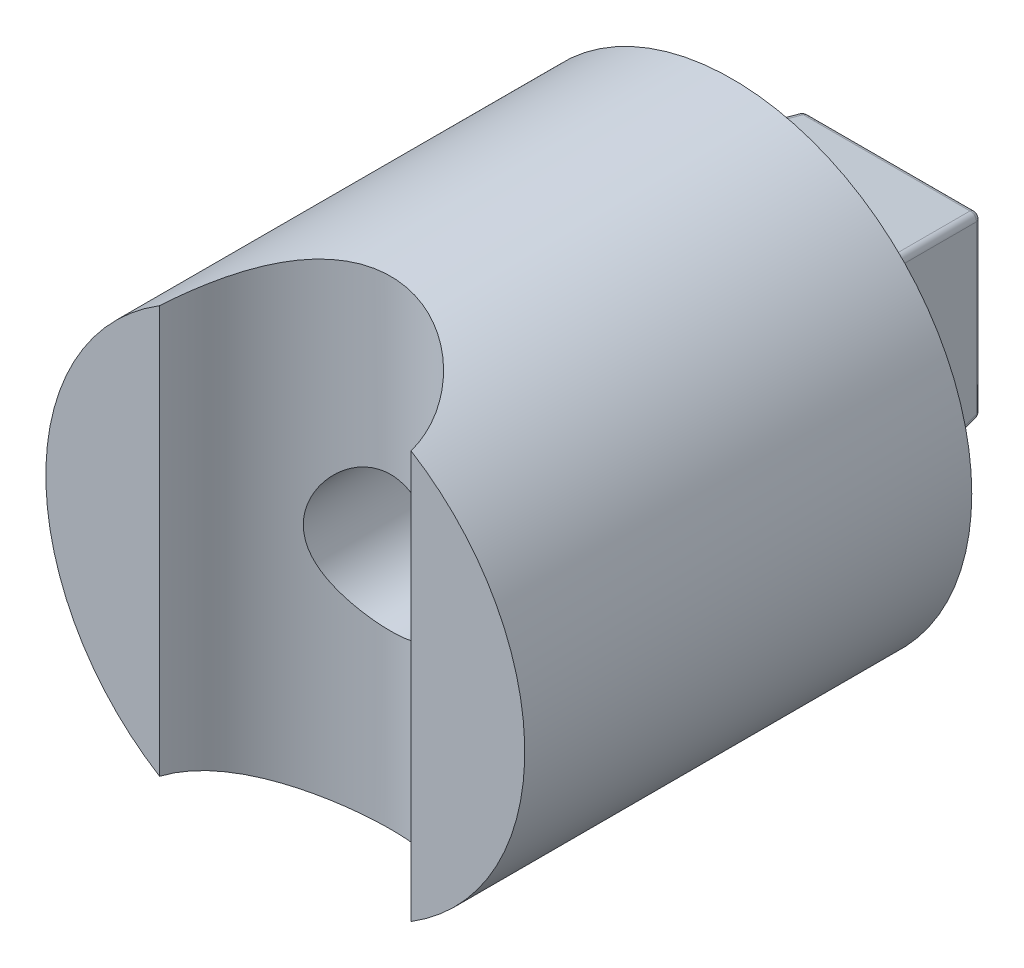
ISO-10303-21;
HEADER;
FILE_DESCRIPTION(('STEP AP214'),'2;1');
FILE_NAME('part.step','',(''),(''),'','','');
FILE_SCHEMA(('AUTOMOTIVE_DESIGN { 1 0 10303 214 1 1 1 1 }'));
ENDSEC;
DATA;
#1=APPLICATION_CONTEXT('core data for automotive mechanical design processes');
#2=APPLICATION_PROTOCOL_DEFINITION('international standard','automotive_design',2000,#1);
#3=PRODUCT_CONTEXT('',#1,'mechanical');
#4=PRODUCT('Part','Part','',(#3));
#5=PRODUCT_RELATED_PRODUCT_CATEGORY('part','',(#4));
#6=PRODUCT_DEFINITION_FORMATION('','',#4);
#7=PRODUCT_DEFINITION_CONTEXT('part definition',#1,'design');
#8=PRODUCT_DEFINITION('design','',#6,#7);
#9=PRODUCT_DEFINITION_SHAPE('','',#8);
#10=(LENGTH_UNIT() NAMED_UNIT(*) SI_UNIT(.MILLI.,.METRE.));
#11=(NAMED_UNIT(*) PLANE_ANGLE_UNIT() SI_UNIT($,.RADIAN.));
#12=(NAMED_UNIT(*) SI_UNIT($,.STERADIAN.) SOLID_ANGLE_UNIT());
#13=UNCERTAINTY_MEASURE_WITH_UNIT(LENGTH_MEASURE(1.E-05),#10,'distance_accuracy_value','');
#14=(GEOMETRIC_REPRESENTATION_CONTEXT(3) GLOBAL_UNCERTAINTY_ASSIGNED_CONTEXT((#13)) GLOBAL_UNIT_ASSIGNED_CONTEXT((#10,
#11,#12)) REPRESENTATION_CONTEXT('',''));
#15=CARTESIAN_POINT('',(0.,0.,0.));
#16=DIRECTION('',(0.,0.,1.));
#17=DIRECTION('',(1.,0.,0.));
#18=AXIS2_PLACEMENT_3D('',#15,#16,#17);
#19=CARTESIAN_POINT('',(0.,0.,28.));
#20=DIRECTION('',(0.,0.,1.));
#21=DIRECTION('',(1.,0.,0.));
#22=AXIS2_PLACEMENT_3D('',#19,#20,#21);
#23=PLANE('',#22);
#24=CARTESIAN_POINT('',(0.,0.,28.));
#25=DIRECTION('',(0.,0.,1.));
#26=DIRECTION('',(1.,0.,0.));
#27=AXIS2_PLACEMENT_3D('',#24,#25,#26);
#28=CIRCLE('',#27,15.);
#29=CARTESIAN_POINT('',(-7.87654746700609,12.7655787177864,28.));
#30=VERTEX_POINT('',#29);
#31=CARTESIAN_POINT('',(-7.87654746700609,-12.7655787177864,28.));
#32=VERTEX_POINT('',#31);
#33=EDGE_CURVE('E157',#30,#32,#28,.T.);
#34=ORIENTED_EDGE('',*,*,#33,.T.);
#35=DIRECTION('',(0.,-1.,0.));
#36=VECTOR('',#35,1.);
#37=CARTESIAN_POINT('',(-7.87654746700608,15.001,28.));
#38=LINE('',#37,#36);
#39=EDGE_CURVE('E46',#30,#32,#38,.T.);
#40=ORIENTED_EDGE('',*,*,#39,.F.);
#41=EDGE_LOOP('',(#34,#40));
#42=FACE_BOUND('',#41,.T.);
#43=ADVANCED_FACE('F31',(#42),#23,.T.);
#44=CARTESIAN_POINT('',(7.87654746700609,-12.7655787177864,28.));
#45=VERTEX_POINT('',#44);
#46=CARTESIAN_POINT('',(7.87654746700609,12.7655787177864,28.));
#47=VERTEX_POINT('',#46);
#48=EDGE_CURVE('E154',#45,#47,#28,.T.);
#49=ORIENTED_EDGE('',*,*,#48,.T.);
#50=DIRECTION('',(0.,-1.,0.));
#51=VECTOR('',#50,1.);
#52=CARTESIAN_POINT('',(7.87654746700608,15.001,28.));
#53=LINE('',#52,#51);
#54=EDGE_CURVE('E143',#45,#47,#53,.F.);
#55=ORIENTED_EDGE('',*,*,#54,.F.);
#56=EDGE_LOOP('',(#49,#55));
#57=FACE_BOUND('',#56,.T.);
#58=ADVANCED_FACE('F153',(#57),#23,.T.);
#59=CARTESIAN_POINT('',(0.,0.,28.));
#60=DIRECTION('',(0.,0.,-1.));
#61=DIRECTION('',(-1.,0.,0.));
#62=AXIS2_PLACEMENT_3D('',#59,#60,#61);
#63=CYLINDRICAL_SURFACE('',#62,4.25);
#64=CARTESIAN_POINT('',(0.,0.,-10.));
#65=DIRECTION('',(0.,0.,-1.));
#66=DIRECTION('',(-1.,0.,0.));
#67=AXIS2_PLACEMENT_3D('',#64,#65,#66);
#68=CIRCLE('',#67,4.25);
#69=CARTESIAN_POINT('',(-4.25,0.,-10.));
#70=VERTEX_POINT('',#69);
#71=EDGE_CURVE('E162',#70,#70,#68,.T.);
#72=ORIENTED_EDGE('',*,*,#71,.T.);
#73=EDGE_LOOP('',(#72));
#74=FACE_BOUND('',#73,.T.);
#75=CARTESIAN_POINT('',(4.25,0.,22.622279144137));
#76=CARTESIAN_POINT('',(4.25000393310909,0.109728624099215,22.6222843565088));
#77=CARTESIAN_POINT('',(4.24574731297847,0.219423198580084,22.6196076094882));
#78=CARTESIAN_POINT('',(4.22879567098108,0.437936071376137,22.609021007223));
#79=CARTESIAN_POINT('',(4.21609913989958,0.546754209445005,22.6011102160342));
#80=CARTESIAN_POINT('',(4.18243124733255,0.762706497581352,22.5803477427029));
#81=CARTESIAN_POINT('',(4.16145341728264,0.869839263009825,22.5674921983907));
#82=CARTESIAN_POINT('',(4.1115073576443,1.08160123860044,22.5373217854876));
#83=CARTESIAN_POINT('',(4.08253566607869,1.18622934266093,22.5200049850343));
#84=CARTESIAN_POINT('',(3.9845096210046,1.4940883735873,22.4624616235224));
#85=CARTESIAN_POINT('',(3.90411038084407,1.69275662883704,22.4164882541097));
#86=CARTESIAN_POINT('',(3.71588033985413,2.07363972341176,22.3145479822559));
#87=CARTESIAN_POINT('',(3.60804179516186,2.25584989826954,22.2585782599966));
#88=CARTESIAN_POINT('',(3.35616753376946,2.61756539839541,22.1365633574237));
#89=CARTESIAN_POINT('',(3.20968605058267,2.79521549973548,22.0700655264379));
#90=CARTESIAN_POINT('',(2.88962322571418,3.12495563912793,21.9380979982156));
#91=CARTESIAN_POINT('',(2.71602741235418,3.27703193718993,21.8726288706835));
#92=CARTESIAN_POINT('',(2.43046675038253,3.48867895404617,21.777400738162));
#93=CARTESIAN_POINT('',(2.3268924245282,3.55861907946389,21.7450703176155));
#94=CARTESIAN_POINT('',(2.11334630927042,3.68943445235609,21.6833884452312));
#95=CARTESIAN_POINT('',(2.0033771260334,3.75031335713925,21.6540357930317));
#96=CARTESIAN_POINT('',(1.77773770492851,3.86238462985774,21.5991584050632));
#97=CARTESIAN_POINT('',(1.66206924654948,3.91357999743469,21.5736324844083));
#98=CARTESIAN_POINT('',(1.42582097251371,4.00569610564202,21.5271658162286));
#99=CARTESIAN_POINT('',(1.30524176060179,4.04661810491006,21.5062245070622));
#100=CARTESIAN_POINT('',(1.06979222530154,4.11483481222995,21.4710289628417));
#101=CARTESIAN_POINT('',(0.95521789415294,4.14294768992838,21.4563785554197));
#102=CARTESIAN_POINT('',(0.723631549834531,4.1896068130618,21.431944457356));
#103=CARTESIAN_POINT('',(0.606619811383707,4.20815413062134,21.4221602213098));
#104=CARTESIAN_POINT('',(0.371204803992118,4.23541496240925,21.4077471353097));
#105=CARTESIAN_POINT('',(0.252802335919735,4.24413388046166,21.4031154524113));
#106=CARTESIAN_POINT('',(0.0155996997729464,4.251627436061,21.3991359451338));
#107=CARTESIAN_POINT('',(-0.10320043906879,4.25040278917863,21.3997877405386));
#108=CARTESIAN_POINT('',(-0.328495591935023,4.23863571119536,21.4060328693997));
#109=CARTESIAN_POINT('',(-0.435053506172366,4.2290199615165,21.4111347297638));
#110=CARTESIAN_POINT('',(-0.646877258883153,4.2018415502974,21.4254876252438));
#111=CARTESIAN_POINT('',(-0.752142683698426,4.18427640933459,21.434739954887));
#112=CARTESIAN_POINT('',(-1.06482608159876,4.11992854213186,21.4684232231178));
#113=CARTESIAN_POINT('',(-1.26934304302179,4.06148185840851,21.4987869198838));
#114=CARTESIAN_POINT('',(-1.66756740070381,3.91501900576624,21.5730674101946));
#115=CARTESIAN_POINT('',(-1.86111344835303,3.82665251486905,21.617144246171));
#116=CARTESIAN_POINT('',(-2.23107367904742,3.62344845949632,21.7150180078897));
#117=CARTESIAN_POINT('',(-2.40748222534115,3.50860222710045,21.7688181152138));
#118=CARTESIAN_POINT('',(-2.7575367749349,3.24217863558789,21.8877705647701));
#119=CARTESIAN_POINT('',(-2.92902895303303,3.08803712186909,21.9535214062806));
#120=CARTESIAN_POINT('',(-3.24498005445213,2.75418959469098,22.0856651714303));
#121=CARTESIAN_POINT('',(-3.38940955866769,2.57445613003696,22.152058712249));
#122=CARTESIAN_POINT('',(-3.65843670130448,2.17719302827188,22.2838195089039));
#123=CARTESIAN_POINT('',(-3.78057907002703,1.95780205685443,22.3486947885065));
#124=CARTESIAN_POINT('',(-3.9340344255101,1.61298542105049,22.4338820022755));
#125=CARTESIAN_POINT('',(-3.9802139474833,1.495475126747,22.4602486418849));
#126=CARTESIAN_POINT('',(-4.06216863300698,1.25590315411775,22.5079010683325));
#127=CARTESIAN_POINT('',(-4.09794828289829,1.13384346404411,22.5291890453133));
#128=CARTESIAN_POINT('',(-4.16837058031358,0.84597143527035,22.571609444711));
#129=CARTESIAN_POINT('',(-4.19889528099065,0.678787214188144,22.5904604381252));
#130=CARTESIAN_POINT('',(-4.23970362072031,0.341040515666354,22.6157892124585));
#131=CARTESIAN_POINT('',(-4.24999388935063,0.170479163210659,22.6222710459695));
#132=CARTESIAN_POINT('',(-4.25000393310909,-0.109728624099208,22.6222843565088));
#133=CARTESIAN_POINT('',(-4.24574731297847,-0.219423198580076,22.6196076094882));
#134=CARTESIAN_POINT('',(-4.22879567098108,-0.437936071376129,22.609021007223));
#135=CARTESIAN_POINT('',(-4.21609913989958,-0.546754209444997,22.6011102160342));
#136=CARTESIAN_POINT('',(-4.18243124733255,-0.762706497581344,22.5803477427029));
#137=CARTESIAN_POINT('',(-4.16145341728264,-0.869839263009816,22.5674921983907));
#138=CARTESIAN_POINT('',(-4.1115073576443,-1.08160123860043,22.5373217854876));
#139=CARTESIAN_POINT('',(-4.08253566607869,-1.18622934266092,22.5200049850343));
#140=CARTESIAN_POINT('',(-3.9845096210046,-1.49408837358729,22.4624616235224));
#141=CARTESIAN_POINT('',(-3.90411038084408,-1.69275662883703,22.4164882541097));
#142=CARTESIAN_POINT('',(-3.71588033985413,-2.07363972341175,22.3145479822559));
#143=CARTESIAN_POINT('',(-3.60804179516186,-2.25584989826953,22.2585782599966));
#144=CARTESIAN_POINT('',(-3.35616753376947,-2.61756539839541,22.1365633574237));
#145=CARTESIAN_POINT('',(-3.20968605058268,-2.79521549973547,22.0700655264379));
#146=CARTESIAN_POINT('',(-2.88962322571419,-3.12495563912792,21.9380979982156));
#147=CARTESIAN_POINT('',(-2.71602741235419,-3.27703193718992,21.8726288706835));
#148=CARTESIAN_POINT('',(-2.43046675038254,-3.48867895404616,21.777400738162));
#149=CARTESIAN_POINT('',(-2.32689242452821,-3.55861907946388,21.7450703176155));
#150=CARTESIAN_POINT('',(-2.11334630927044,-3.68943445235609,21.6833884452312));
#151=CARTESIAN_POINT('',(-2.00337712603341,-3.75031335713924,21.6540357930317));
#152=CARTESIAN_POINT('',(-1.77773770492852,-3.86238462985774,21.5991584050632));
#153=CARTESIAN_POINT('',(-1.66206924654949,-3.91357999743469,21.5736324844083));
#154=CARTESIAN_POINT('',(-1.42582097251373,-4.00569610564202,21.5271658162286));
#155=CARTESIAN_POINT('',(-1.30524176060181,-4.04661810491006,21.5062245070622));
#156=CARTESIAN_POINT('',(-1.06979222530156,-4.11483481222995,21.4710289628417));
#157=CARTESIAN_POINT('',(-0.955217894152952,-4.14294768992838,21.4563785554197));
#158=CARTESIAN_POINT('',(-0.723631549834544,-4.18960681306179,21.431944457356));
#159=CARTESIAN_POINT('',(-0.606619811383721,-4.20815413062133,21.4221602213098));
#160=CARTESIAN_POINT('',(-0.371204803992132,-4.23541496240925,21.4077471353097));
#161=CARTESIAN_POINT('',(-0.252802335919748,-4.24413388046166,21.4031154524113));
#162=CARTESIAN_POINT('',(-0.0155996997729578,-4.25162743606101,21.3991359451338));
#163=CARTESIAN_POINT('',(0.103200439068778,-4.25040278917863,21.3997877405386));
#164=CARTESIAN_POINT('',(0.328495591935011,-4.23863571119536,21.4060328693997));
#165=CARTESIAN_POINT('',(0.435053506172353,-4.2290199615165,21.4111347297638));
#166=CARTESIAN_POINT('',(0.646877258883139,-4.2018415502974,21.4254876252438));
#167=CARTESIAN_POINT('',(0.752142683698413,-4.1842764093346,21.434739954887));
#168=CARTESIAN_POINT('',(1.06482608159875,-4.11992854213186,21.4684232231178));
#169=CARTESIAN_POINT('',(1.26934304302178,-4.06148185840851,21.4987869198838));
#170=CARTESIAN_POINT('',(1.6675674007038,-3.91501900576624,21.5730674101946));
#171=CARTESIAN_POINT('',(1.86111344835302,-3.82665251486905,21.617144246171));
#172=CARTESIAN_POINT('',(2.23107367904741,-3.62344845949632,21.7150180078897));
#173=CARTESIAN_POINT('',(2.40748222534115,-3.50860222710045,21.7688181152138));
#174=CARTESIAN_POINT('',(2.75753677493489,-3.24217863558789,21.8877705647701));
#175=CARTESIAN_POINT('',(2.92902895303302,-3.08803712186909,21.9535214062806));
#176=CARTESIAN_POINT('',(3.24498005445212,-2.75418959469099,22.0856651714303));
#177=CARTESIAN_POINT('',(3.38940955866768,-2.57445613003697,22.152058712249));
#178=CARTESIAN_POINT('',(3.65843670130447,-2.17719302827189,22.2838195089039));
#179=CARTESIAN_POINT('',(3.78057907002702,-1.95780205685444,22.3486947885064));
#180=CARTESIAN_POINT('',(3.9340344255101,-1.6129854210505,22.4338820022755));
#181=CARTESIAN_POINT('',(3.98021394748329,-1.49547512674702,22.4602486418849));
#182=CARTESIAN_POINT('',(4.06216863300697,-1.25590315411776,22.5079010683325));
#183=CARTESIAN_POINT('',(4.09794828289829,-1.13384346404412,22.5291890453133));
#184=CARTESIAN_POINT('',(4.16837058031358,-0.845971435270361,22.571609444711));
#185=CARTESIAN_POINT('',(4.19889528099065,-0.67878721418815,22.5904604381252));
#186=CARTESIAN_POINT('',(4.23970362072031,-0.341040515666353,22.6157892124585));
#187=CARTESIAN_POINT('',(4.24999388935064,-0.170479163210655,22.6222710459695));
#188=CARTESIAN_POINT('',(4.25,0.,22.622279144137));
#189=B_SPLINE_CURVE_WITH_KNOTS('',3,(#75,#76,#77,#78,#79,#80,#81,#82,#83,#84,#85,#86,#87,#88,
#89,#90,#91,#92,#93,#94,#95,#96,#97,#98,#99,#100,#101,#102,#103,#104,#105,#106,#107,#108,#109,
#110,#111,#112,#113,#114,#115,#116,#117,#118,#119,#120,#121,#122,#123,#124,#125,#126,#127,#128,
#129,#130,#131,#132,#133,#134,#135,#136,#137,#138,#139,#140,#141,#142,#143,#144,#145,#146,#147,
#148,#149,#150,#151,#152,#153,#154,#155,#156,#157,#158,#159,#160,#161,#162,#163,#164,#165,#166,
#167,#168,#169,#170,#171,#172,#173,#174,#175,#176,#177,#178,#179,#180,#181,#182,#183,#184,#185,
#186,#187,#188),.UNSPECIFIED.,.T.,.F.,(4,2,2,2,2,2,2,2,2,2,2,2,2,2,2,2,2,2,2,2,2,2,2,2,2,2,2,2,
2,2,2,2,2,2,2,2,2,2,2,2,2,2,2,2,2,2,2,2,2,2,2,2,2,2,2,2,4),(0.,0.329012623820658,
0.658084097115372,0.987413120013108,1.31688499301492,1.97141796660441,2.62613586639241,
3.34223690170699,4.05872145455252,4.4455654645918,4.8322529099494,5.21882037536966,
5.60534045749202,5.96148655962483,6.31759273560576,6.67350302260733,7.02938769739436,
7.35032950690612,7.67137148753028,8.31282665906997,8.96206823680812,9.61152264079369,
10.3278337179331,11.0449190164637,11.8184380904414,12.2048877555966,12.5911704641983,
13.102506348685,13.6136746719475,13.9426872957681,14.2717587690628,14.6010877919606,
14.9305596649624,15.5850926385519,16.2398105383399,16.9559115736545,17.6723961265,
18.0592401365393,18.4459275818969,18.8324950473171,19.2190151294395,19.5751612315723,
19.9312674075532,20.2871776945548,20.6430623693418,20.9640041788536,21.2850461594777,
21.9265013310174,22.5757429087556,23.2251973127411,23.9415083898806,24.6585936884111,
25.4321127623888,25.8185624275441,26.2048451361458,26.7161810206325,27.2273493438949),.UNSPECIFIED.);
#190=CARTESIAN_POINT('',(4.25,0.,22.622279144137));
#191=VERTEX_POINT('',#190);
#192=EDGE_CURVE('E149',#191,#191,#189,.T.);
#193=ORIENTED_EDGE('',*,*,#192,.T.);
#194=EDGE_LOOP('',(#193));
#195=FACE_BOUND('',#194,.T.);
#196=ADVANCED_FACE('F321',(#74,#195),#63,.F.);
#197=CARTESIAN_POINT('',(0.,0.,28.));
#198=DIRECTION('',(0.,0.,-1.));
#199=DIRECTION('',(-1.,0.,0.));
#200=AXIS2_PLACEMENT_3D('',#197,#198,#199);
#201=CYLINDRICAL_SURFACE('',#200,15.);
#202=CARTESIAN_POINT('',(0.,0.,0.));
#203=DIRECTION('',(0.,0.,1.));
#204=DIRECTION('',(1.,0.,0.));
#205=AXIS2_PLACEMENT_3D('',#202,#203,#204);
#206=CIRCLE('',#205,15.);
#207=CARTESIAN_POINT('',(15.,0.,0.));
#208=VERTEX_POINT('',#207);
#209=EDGE_CURVE('E158',#208,#208,#206,.T.);
#210=ORIENTED_EDGE('',*,*,#209,.T.);
#211=EDGE_LOOP('',(#210));
#212=FACE_BOUND('',#211,.T.);
#213=CARTESIAN_POINT('',(-7.87654746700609,12.7655787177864,28.));
#214=CARTESIAN_POINT('',(-7.83778072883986,12.7894650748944,27.7817244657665));
#215=CARTESIAN_POINT('',(-7.79000242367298,12.8187353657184,27.5657335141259));
#216=CARTESIAN_POINT('',(-7.67728283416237,12.8865770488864,27.1399915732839));
#217=CARTESIAN_POINT('',(-7.61235836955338,12.9251393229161,26.9302346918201));
#218=CARTESIAN_POINT('',(-7.46648261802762,13.0099441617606,26.5191994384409));
#219=CARTESIAN_POINT('',(-7.38561066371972,13.0561485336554,26.3178848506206));
#220=CARTESIAN_POINT('',(-7.20846924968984,13.154781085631,25.9236983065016));
#221=CARTESIAN_POINT('',(-7.1121960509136,13.2072107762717,25.7308284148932));
#222=CARTESIAN_POINT('',(-6.90542599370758,13.316481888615,25.355140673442));
#223=CARTESIAN_POINT('',(-6.7949816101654,13.3733067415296,25.172289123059));
#224=CARTESIAN_POINT('',(-6.56040196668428,13.4899344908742,24.8167103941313));
#225=CARTESIAN_POINT('',(-6.43626764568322,13.5497371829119,24.6439825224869));
#226=CARTESIAN_POINT('',(-6.04375162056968,13.7315688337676,24.1413176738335));
#227=CARTESIAN_POINT('',(-5.75546179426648,13.8559083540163,23.8272701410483));
#228=CARTESIAN_POINT('',(-5.27391243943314,14.043477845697,23.3800549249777));
#229=CARTESIAN_POINT('',(-5.09706275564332,14.1087820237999,23.2295809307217));
#230=CARTESIAN_POINT('',(-4.73019868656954,14.2359693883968,22.94406042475));
#231=CARTESIAN_POINT('',(-4.54019040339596,14.2978541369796,22.8090068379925));
#232=CARTESIAN_POINT('',(-4.14801820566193,14.4165156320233,22.5554049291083));
#233=CARTESIAN_POINT('',(-3.94585677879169,14.4732934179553,22.4368532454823));
#234=CARTESIAN_POINT('',(-3.53050650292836,14.5801743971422,22.2173349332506));
#235=CARTESIAN_POINT('',(-3.31731842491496,14.6302780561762,22.1163670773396));
#236=CARTESIAN_POINT('',(-2.88888570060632,14.7207541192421,21.9363247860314));
#237=CARTESIAN_POINT('',(-2.67396744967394,14.7614032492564,21.8566136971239));
#238=CARTESIAN_POINT('',(-2.23671784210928,14.8339539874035,21.7156100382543));
#239=CARTESIAN_POINT('',(-2.01438657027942,14.8658556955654,21.6543172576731));
#240=CARTESIAN_POINT('',(-1.56429018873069,14.9199307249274,21.5510338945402));
#241=CARTESIAN_POINT('',(-1.33652922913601,14.942111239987,21.509029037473));
#242=CARTESIAN_POINT('',(-0.877467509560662,14.9760808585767,21.4448920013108));
#243=CARTESIAN_POINT('',(-0.646167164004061,14.9878711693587,21.4227575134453));
#244=CARTESIAN_POINT('',(-0.208309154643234,14.9999687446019,21.4000541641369));
#245=CARTESIAN_POINT('',(-0.00189070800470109,15.0014171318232,21.3973421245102));
#246=CARTESIAN_POINT('',(0.410410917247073,14.9958012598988,21.4078739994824));
#247=CARTESIAN_POINT('',(0.616294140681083,14.9887377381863,21.4211165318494));
#248=CARTESIAN_POINT('',(1.02594977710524,14.9662791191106,21.4633867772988));
#249=CARTESIAN_POINT('',(1.22972236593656,14.9508847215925,21.4924131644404));
#250=CARTESIAN_POINT('',(1.63369478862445,14.9121499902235,21.5658956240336));
#251=CARTESIAN_POINT('',(1.83389457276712,14.8888095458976,21.6103519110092));
#252=CARTESIAN_POINT('',(2.22360853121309,14.8355357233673,21.7126747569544));
#253=CARTESIAN_POINT('',(2.41326417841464,14.8058135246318,21.7701143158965));
#254=CARTESIAN_POINT('',(2.78688151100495,14.7400573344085,21.8985114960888));
#255=CARTESIAN_POINT('',(2.97084116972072,14.7040211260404,21.9694738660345));
#256=CARTESIAN_POINT('',(3.33199472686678,14.6264111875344,22.1242601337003));
#257=CARTESIAN_POINT('',(3.50919048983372,14.584838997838,22.2080804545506));
#258=CARTESIAN_POINT('',(3.85607803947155,14.4969907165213,22.3879475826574));
#259=CARTESIAN_POINT('',(4.02576707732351,14.4507129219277,22.4839988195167));
#260=CARTESIAN_POINT('',(4.54984362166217,14.2981807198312,22.8063746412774));
#261=CARTESIAN_POINT('',(4.88925947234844,14.1848264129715,23.0541759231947));
#262=CARTESIAN_POINT('',(5.52401212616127,13.9499167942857,23.5982409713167));
#263=CARTESIAN_POINT('',(5.81929436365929,13.8283515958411,23.8945637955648));
#264=CARTESIAN_POINT('',(6.2394114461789,13.6417231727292,24.3877187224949));
#265=CARTESIAN_POINT('',(6.38143117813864,13.5756962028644,24.569806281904));
#266=CARTESIAN_POINT('',(6.64966180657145,13.4463432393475,24.9463036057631));
#267=CARTESIAN_POINT('',(6.77586968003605,13.3830177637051,25.1407157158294));
#268=CARTESIAN_POINT('',(7.01124394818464,13.2612217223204,25.5404482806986));
#269=CARTESIAN_POINT('',(7.12044620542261,13.2027410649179,25.7457445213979));
#270=CARTESIAN_POINT('',(7.32110217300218,13.0925376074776,26.1664633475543));
#271=CARTESIAN_POINT('',(7.41256485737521,13.0408113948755,26.3818807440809));
#272=CARTESIAN_POINT('',(7.57862115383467,12.9450376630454,26.8266644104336));
#273=CARTESIAN_POINT('',(7.65278300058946,12.9011919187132,27.0562366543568));
#274=CARTESIAN_POINT('',(7.78044959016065,12.8245798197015,27.5229421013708));
#275=CARTESIAN_POINT('',(7.8339452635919,12.7918183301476,27.7600785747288));
#276=CARTESIAN_POINT('',(7.87654746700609,12.7655787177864,28.));
#277=B_SPLINE_CURVE_WITH_KNOTS('',3,(#213,#214,#215,#216,#217,#218,#219,#220,#221,#222,#223,
#224,#225,#226,#227,#228,#229,#230,#231,#232,#233,#234,#235,#236,#237,#238,#239,#240,#241,#242,
#243,#244,#245,#246,#247,#248,#249,#250,#251,#252,#253,#254,#255,#256,#257,#258,#259,#260,#261,
#262,#263,#264,#265,#266,#267,#268,#269,#270,#271,#272,#273,#274,#275,#276),.UNSPECIFIED.,.F.,
.F.,(4,2,2,2,2,2,2,2,2,2,2,2,2,2,2,2,2,2,2,2,2,2,2,2,2,2,2,2,2,2,2,4),(0.,0.668533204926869,
1.33641302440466,2.00105060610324,2.66584979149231,3.32825471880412,3.99061424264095,
5.31663519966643,6.0395907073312,6.76221317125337,7.48468821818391,8.20711281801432,
8.90454075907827,9.60196072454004,10.2988637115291,10.9956857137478,11.6142334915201,
12.2327276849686,12.8511699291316,13.4696207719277,14.0701089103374,14.6708083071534,
15.2713409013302,15.8720916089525,17.1722579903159,18.4740187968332,19.1938222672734,
19.9137631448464,20.6321645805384,21.3502016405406,22.0845964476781,22.8193131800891),.UNSPECIFIED.);
#278=EDGE_CURVE('E156',#30,#47,#277,.T.);
#279=ORIENTED_EDGE('',*,*,#278,.T.);
#280=ORIENTED_EDGE('',*,*,#48,.F.);
#281=CARTESIAN_POINT('',(-7.87654746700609,-12.7655787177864,28.));
#282=CARTESIAN_POINT('',(-7.83778072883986,-12.7894650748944,27.7817244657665));
#283=CARTESIAN_POINT('',(-7.79000242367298,-12.8187353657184,27.5657335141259));
#284=CARTESIAN_POINT('',(-7.67728283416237,-12.8865770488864,27.1399915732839));
#285=CARTESIAN_POINT('',(-7.61235836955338,-12.9251393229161,26.9302346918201));
#286=CARTESIAN_POINT('',(-7.46648261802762,-13.0099441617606,26.5191994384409));
#287=CARTESIAN_POINT('',(-7.38561066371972,-13.0561485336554,26.3178848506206));
#288=CARTESIAN_POINT('',(-7.20846924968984,-13.154781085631,25.9236983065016));
#289=CARTESIAN_POINT('',(-7.1121960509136,-13.2072107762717,25.7308284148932));
#290=CARTESIAN_POINT('',(-6.90542599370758,-13.316481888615,25.355140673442));
#291=CARTESIAN_POINT('',(-6.7949816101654,-13.3733067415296,25.172289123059));
#292=CARTESIAN_POINT('',(-6.56040196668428,-13.4899344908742,24.8167103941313));
#293=CARTESIAN_POINT('',(-6.43626764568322,-13.5497371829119,24.6439825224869));
#294=CARTESIAN_POINT('',(-6.04375162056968,-13.7315688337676,24.1413176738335));
#295=CARTESIAN_POINT('',(-5.75546179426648,-13.8559083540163,23.8272701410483));
#296=CARTESIAN_POINT('',(-5.27391243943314,-14.043477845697,23.3800549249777));
#297=CARTESIAN_POINT('',(-5.09706275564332,-14.1087820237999,23.2295809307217));
#298=CARTESIAN_POINT('',(-4.73019868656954,-14.2359693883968,22.94406042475));
#299=CARTESIAN_POINT('',(-4.54019040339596,-14.2978541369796,22.8090068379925));
#300=CARTESIAN_POINT('',(-4.14801820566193,-14.4165156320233,22.5554049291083));
#301=CARTESIAN_POINT('',(-3.94585677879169,-14.4732934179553,22.4368532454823));
#302=CARTESIAN_POINT('',(-3.53050650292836,-14.5801743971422,22.2173349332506));
#303=CARTESIAN_POINT('',(-3.31731842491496,-14.6302780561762,22.1163670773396));
#304=CARTESIAN_POINT('',(-2.88888570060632,-14.7207541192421,21.9363247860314));
#305=CARTESIAN_POINT('',(-2.67396744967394,-14.7614032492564,21.8566136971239));
#306=CARTESIAN_POINT('',(-2.23671784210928,-14.8339539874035,21.7156100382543));
#307=CARTESIAN_POINT('',(-2.01438657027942,-14.8658556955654,21.6543172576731));
#308=CARTESIAN_POINT('',(-1.56429018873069,-14.9199307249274,21.5510338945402));
#309=CARTESIAN_POINT('',(-1.33652922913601,-14.942111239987,21.509029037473));
#310=CARTESIAN_POINT('',(-0.877467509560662,-14.9760808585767,21.4448920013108));
#311=CARTESIAN_POINT('',(-0.646167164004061,-14.9878711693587,21.4227575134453));
#312=CARTESIAN_POINT('',(-0.208309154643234,-14.9999687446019,21.4000541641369));
#313=CARTESIAN_POINT('',(-0.00189070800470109,-15.0014171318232,21.3973421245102));
#314=CARTESIAN_POINT('',(0.410410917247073,-14.9958012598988,21.4078739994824));
#315=CARTESIAN_POINT('',(0.616294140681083,-14.9887377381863,21.4211165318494));
#316=CARTESIAN_POINT('',(1.02594977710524,-14.9662791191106,21.4633867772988));
#317=CARTESIAN_POINT('',(1.22972236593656,-14.9508847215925,21.4924131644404));
#318=CARTESIAN_POINT('',(1.63369478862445,-14.9121499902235,21.5658956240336));
#319=CARTESIAN_POINT('',(1.83389457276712,-14.8888095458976,21.6103519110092));
#320=CARTESIAN_POINT('',(2.22360853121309,-14.8355357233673,21.7126747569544));
#321=CARTESIAN_POINT('',(2.41326417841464,-14.8058135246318,21.7701143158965));
#322=CARTESIAN_POINT('',(2.78688151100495,-14.7400573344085,21.8985114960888));
#323=CARTESIAN_POINT('',(2.97084116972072,-14.7040211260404,21.9694738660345));
#324=CARTESIAN_POINT('',(3.33199472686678,-14.6264111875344,22.1242601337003));
#325=CARTESIAN_POINT('',(3.50919048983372,-14.584838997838,22.2080804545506));
#326=CARTESIAN_POINT('',(3.85607803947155,-14.4969907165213,22.3879475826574));
#327=CARTESIAN_POINT('',(4.02576707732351,-14.4507129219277,22.4839988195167));
#328=CARTESIAN_POINT('',(4.54984362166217,-14.2981807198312,22.8063746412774));
#329=CARTESIAN_POINT('',(4.88925947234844,-14.1848264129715,23.0541759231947));
#330=CARTESIAN_POINT('',(5.52401212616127,-13.9499167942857,23.5982409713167));
#331=CARTESIAN_POINT('',(5.81929436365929,-13.8283515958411,23.8945637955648));
#332=CARTESIAN_POINT('',(6.2394114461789,-13.6417231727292,24.3877187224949));
#333=CARTESIAN_POINT('',(6.38143117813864,-13.5756962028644,24.569806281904));
#334=CARTESIAN_POINT('',(6.64966180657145,-13.4463432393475,24.9463036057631));
#335=CARTESIAN_POINT('',(6.77586968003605,-13.3830177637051,25.1407157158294));
#336=CARTESIAN_POINT('',(7.01124394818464,-13.2612217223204,25.5404482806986));
#337=CARTESIAN_POINT('',(7.12044620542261,-13.2027410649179,25.7457445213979));
#338=CARTESIAN_POINT('',(7.32110217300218,-13.0925376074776,26.1664633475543));
#339=CARTESIAN_POINT('',(7.41256485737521,-13.0408113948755,26.3818807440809));
#340=CARTESIAN_POINT('',(7.57862115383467,-12.9450376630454,26.8266644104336));
#341=CARTESIAN_POINT('',(7.65278300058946,-12.9011919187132,27.0562366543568));
#342=CARTESIAN_POINT('',(7.78044959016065,-12.8245798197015,27.5229421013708));
#343=CARTESIAN_POINT('',(7.8339452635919,-12.7918183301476,27.7600785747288));
#344=CARTESIAN_POINT('',(7.87654746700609,-12.7655787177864,28.));
#345=B_SPLINE_CURVE_WITH_KNOTS('',3,(#281,#282,#283,#284,#285,#286,#287,#288,#289,#290,#291,
#292,#293,#294,#295,#296,#297,#298,#299,#300,#301,#302,#303,#304,#305,#306,#307,#308,#309,#310,
#311,#312,#313,#314,#315,#316,#317,#318,#319,#320,#321,#322,#323,#324,#325,#326,#327,#328,#329,
#330,#331,#332,#333,#334,#335,#336,#337,#338,#339,#340,#341,#342,#343,#344),.UNSPECIFIED.,.F.,
.F.,(4,2,2,2,2,2,2,2,2,2,2,2,2,2,2,2,2,2,2,2,2,2,2,2,2,2,2,2,2,2,2,4),(0.,0.668533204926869,
1.33641302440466,2.00105060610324,2.66584979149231,3.32825471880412,3.99061424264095,
5.31663519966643,6.0395907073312,6.76221317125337,7.48468821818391,8.20711281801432,
8.90454075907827,9.60196072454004,10.2988637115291,10.9956857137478,11.6142334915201,
12.2327276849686,12.8511699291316,13.4696207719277,14.0701089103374,14.6708083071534,
15.2713409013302,15.8720916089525,17.1722579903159,18.4740187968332,19.1938222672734,
19.9137631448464,20.6321645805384,21.3502016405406,22.0845964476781,22.8193131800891),.UNSPECIFIED.);
#346=EDGE_CURVE('E140',#32,#45,#345,.T.);
#347=ORIENTED_EDGE('',*,*,#346,.F.);
#348=ORIENTED_EDGE('',*,*,#33,.F.);
#349=EDGE_LOOP('',(#279,#280,#347,#348));
#350=FACE_BOUND('',#349,.T.);
#351=ADVANCED_FACE('F33',(#212,#350),#201,.T.);
#352=CARTESIAN_POINT('',(0.,0.,0.));
#353=DIRECTION('',(0.,0.,1.));
#354=DIRECTION('',(1.,0.,0.));
#355=AXIS2_PLACEMENT_3D('',#352,#353,#354);
#356=PLANE('',#355);
#357=ORIENTED_EDGE('',*,*,#209,.F.);
#358=EDGE_LOOP('',(#357));
#359=FACE_BOUND('',#358,.T.);
#360=CARTESIAN_POINT('',(-6.68166017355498,6.68166017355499,0.));
#361=DIRECTION('',(0.,0.,1.));
#362=DIRECTION('',(-0.707106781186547,0.707106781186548,0.));
#363=AXIS2_PLACEMENT_3D('',#360,#361,#362);
#364=ELLIPSE('',#363,0.819822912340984,0.8);
#365=CARTESIAN_POINT('',(-7.49163227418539,6.70148160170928,0.));
#366=VERTEX_POINT('',#365);
#367=CARTESIAN_POINT('',(-6.70148160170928,7.49163227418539,0.));
#368=VERTEX_POINT('',#367);
#369=EDGE_CURVE('E200',#366,#368,#364,.F.);
#370=ORIENTED_EDGE('',*,*,#369,.F.);
#371=DIRECTION('',(0.,-1.,0.));
#372=VECTOR('',#371,1.);
#373=CARTESIAN_POINT('',(-7.49163227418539,-7.15,0.));
#374=LINE('',#373,#372);
#375=CARTESIAN_POINT('',(-7.49163227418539,-6.70148160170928,0.));
#376=VERTEX_POINT('',#375);
#377=EDGE_CURVE('E197',#366,#376,#374,.T.);
#378=ORIENTED_EDGE('',*,*,#377,.T.);
#379=CARTESIAN_POINT('',(-6.68166017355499,-6.68166017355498,0.));
#380=DIRECTION('',(0.,0.,1.));
#381=DIRECTION('',(-0.707106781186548,-0.707106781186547,0.));
#382=AXIS2_PLACEMENT_3D('',#379,#380,#381);
#383=ELLIPSE('',#382,0.819822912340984,0.8);
#384=CARTESIAN_POINT('',(-6.70148160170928,-7.49163227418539,0.));
#385=VERTEX_POINT('',#384);
#386=EDGE_CURVE('E195',#385,#376,#383,.F.);
#387=ORIENTED_EDGE('',*,*,#386,.F.);
#388=DIRECTION('',(1.,0.,0.));
#389=VECTOR('',#388,1.);
#390=CARTESIAN_POINT('',(7.15,-7.49163227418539,0.));
#391=LINE('',#390,#389);
#392=CARTESIAN_POINT('',(6.70148160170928,-7.49163227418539,0.));
#393=VERTEX_POINT('',#392);
#394=EDGE_CURVE('E193',#385,#393,#391,.T.);
#395=ORIENTED_EDGE('',*,*,#394,.T.);
#396=CARTESIAN_POINT('',(6.68166017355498,-6.68166017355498,0.));
#397=DIRECTION('',(0.,0.,1.));
#398=DIRECTION('',(0.707106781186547,-0.707106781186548,0.));
#399=AXIS2_PLACEMENT_3D('',#396,#397,#398);
#400=ELLIPSE('',#399,0.819822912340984,0.8);
#401=CARTESIAN_POINT('',(7.49163227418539,-6.70148160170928,0.));
#402=VERTEX_POINT('',#401);
#403=EDGE_CURVE('E190',#402,#393,#400,.F.);
#404=ORIENTED_EDGE('',*,*,#403,.F.);
#405=DIRECTION('',(0.,1.,0.));
#406=VECTOR('',#405,1.);
#407=CARTESIAN_POINT('',(7.49163227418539,7.15,0.));
#408=LINE('',#407,#406);
#409=CARTESIAN_POINT('',(7.49163227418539,6.70148160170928,0.));
#410=VERTEX_POINT('',#409);
#411=EDGE_CURVE('E186',#402,#410,#408,.T.);
#412=ORIENTED_EDGE('',*,*,#411,.T.);
#413=CARTESIAN_POINT('',(6.68166017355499,6.68166017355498,0.));
#414=DIRECTION('',(0.,0.,1.));
#415=DIRECTION('',(0.707106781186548,0.707106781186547,0.));
#416=AXIS2_PLACEMENT_3D('',#413,#414,#415);
#417=ELLIPSE('',#416,0.819822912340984,0.8);
#418=CARTESIAN_POINT('',(6.70148160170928,7.49163227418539,0.));
#419=VERTEX_POINT('',#418);
#420=EDGE_CURVE('E183',#419,#410,#417,.F.);
#421=ORIENTED_EDGE('',*,*,#420,.F.);
#422=DIRECTION('',(-1.,0.,0.));
#423=VECTOR('',#422,1.);
#424=CARTESIAN_POINT('',(-7.15,7.49163227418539,0.));
#425=LINE('',#424,#423);
#426=EDGE_CURVE('E188',#419,#368,#425,.T.);
#427=ORIENTED_EDGE('',*,*,#426,.T.);
#428=EDGE_LOOP('',(#370,#378,#387,#395,#404,#412,#421,#427));
#429=FACE_BOUND('',#428,.T.);
#430=ADVANCED_FACE('F281',(#359,#429),#356,.F.);
#431=CARTESIAN_POINT('',(7.15,7.15,0.));
#432=DIRECTION('',(0.987688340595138,0.,-0.156434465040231));
#433=DIRECTION('',(-0.156434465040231,0.,-0.987688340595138));
#434=AXIS2_PLACEMENT_3D('',#431,#432,#433);
#435=PLANE('',#434);
#436=DIRECTION('',(0.,-1.,0.));
#437=VECTOR('',#436,1.);
#438=CARTESIAN_POINT('',(5.6195986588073,5.56615559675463,-9.66257378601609));
#439=LINE('',#438,#437);
#440=CARTESIAN_POINT('',(5.6195986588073,-5.22452332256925,-9.66257378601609));
#441=VERTEX_POINT('',#440);
#442=CARTESIAN_POINT('',(5.6195986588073,5.22452332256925,-9.66257378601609));
#443=VERTEX_POINT('',#442);
#444=EDGE_CURVE('E39',#441,#443,#439,.F.);
#445=ORIENTED_EDGE('',*,*,#444,.T.);
#446=DIRECTION('',(-0.154554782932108,-0.154554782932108,-0.975820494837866));
#447=VECTOR('',#446,1.);
#448=CARTESIAN_POINT('',(7.15943723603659,6.76436189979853,0.059584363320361));
#449=LINE('',#448,#447);
#450=CARTESIAN_POINT('',(7.09655693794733,6.70148160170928,-0.337426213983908));
#451=VERTEX_POINT('',#450);
#452=EDGE_CURVE('E11',#443,#451,#449,.F.);
#453=ORIENTED_EDGE('',*,*,#452,.T.);
#454=DIRECTION('',(0.,-1.,0.));
#455=VECTOR('',#454,1.);
#456=CARTESIAN_POINT('',(7.09655693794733,-7.15,-0.337426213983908));
#457=LINE('',#456,#455);
#458=CARTESIAN_POINT('',(7.09655693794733,-6.70148160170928,-0.337426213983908));
#459=VERTEX_POINT('',#458);
#460=EDGE_CURVE('E221',#451,#459,#457,.T.);
#461=ORIENTED_EDGE('',*,*,#460,.T.);
#462=DIRECTION('',(-0.154554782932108,0.154554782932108,-0.975820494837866));
#463=VECTOR('',#462,1.);
#464=CARTESIAN_POINT('',(6.81785054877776,-6.4227752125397,-2.09710910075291));
#465=LINE('',#464,#463);
#466=EDGE_CURVE('E223',#459,#441,#465,.T.);
#467=ORIENTED_EDGE('',*,*,#466,.T.);
#468=EDGE_LOOP('',(#445,#453,#461,#467));
#469=FACE_BOUND('',#468,.T.);
#470=ADVANCED_FACE('F225',(#469),#435,.T.);
#471=CARTESIAN_POINT('',(7.15,-7.15,0.));
#472=DIRECTION('',(0.,-0.987688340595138,-0.156434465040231));
#473=DIRECTION('',(0.,0.156434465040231,-0.987688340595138));
#474=AXIS2_PLACEMENT_3D('',#471,#472,#473);
#475=PLANE('',#474);
#476=DIRECTION('',(0.154554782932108,0.154554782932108,-0.975820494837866));
#477=VECTOR('',#476,1.);
#478=CARTESIAN_POINT('',(-6.42277521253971,-6.81785054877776,-2.09710910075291));
#479=LINE('',#478,#477);
#480=CARTESIAN_POINT('',(-6.70148160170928,-7.09655693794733,-0.337426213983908));
#481=VERTEX_POINT('',#480);
#482=CARTESIAN_POINT('',(-5.22452332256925,-5.6195986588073,-9.66257378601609));
#483=VERTEX_POINT('',#482);
#484=EDGE_CURVE('E207',#481,#483,#479,.T.);
#485=ORIENTED_EDGE('',*,*,#484,.T.);
#486=DIRECTION('',(-1.,0.,0.));
#487=VECTOR('',#486,1.);
#488=CARTESIAN_POINT('',(5.56615559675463,-5.6195986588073,-9.66257378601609));
#489=LINE('',#488,#487);
#490=CARTESIAN_POINT('',(5.22452332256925,-5.6195986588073,-9.66257378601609));
#491=VERTEX_POINT('',#490);
#492=EDGE_CURVE('E209',#483,#491,#489,.F.);
#493=ORIENTED_EDGE('',*,*,#492,.T.);
#494=DIRECTION('',(-0.154554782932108,0.154554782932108,-0.975820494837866));
#495=VECTOR('',#494,1.);
#496=CARTESIAN_POINT('',(6.76436189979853,-7.15943723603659,0.059584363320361));
#497=LINE('',#496,#495);
#498=CARTESIAN_POINT('',(6.70148160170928,-7.09655693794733,-0.337426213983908));
#499=VERTEX_POINT('',#498);
#500=EDGE_CURVE('E203',#491,#499,#497,.F.);
#501=ORIENTED_EDGE('',*,*,#500,.T.);
#502=DIRECTION('',(-1.,0.,0.));
#503=VECTOR('',#502,1.);
#504=CARTESIAN_POINT('',(-7.15,-7.09655693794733,-0.337426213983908));
#505=LINE('',#504,#503);
#506=EDGE_CURVE('E205',#499,#481,#505,.T.);
#507=ORIENTED_EDGE('',*,*,#506,.T.);
#508=EDGE_LOOP('',(#485,#493,#501,#507));
#509=FACE_BOUND('',#508,.T.);
#510=ADVANCED_FACE('F286',(#509),#475,.T.);
#511=CARTESIAN_POINT('',(-7.15,7.15,0.));
#512=DIRECTION('',(-0.987688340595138,0.,-0.156434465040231));
#513=DIRECTION('',(-0.156434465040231,0.,0.987688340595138));
#514=AXIS2_PLACEMENT_3D('',#511,#512,#513);
#515=PLANE('',#514);
#516=DIRECTION('',(0.,1.,0.));
#517=VECTOR('',#516,1.);
#518=CARTESIAN_POINT('',(-5.6195986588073,-5.56615559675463,-9.66257378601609));
#519=LINE('',#518,#517);
#520=CARTESIAN_POINT('',(-5.6195986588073,5.22452332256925,-9.66257378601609));
#521=VERTEX_POINT('',#520);
#522=CARTESIAN_POINT('',(-5.6195986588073,-5.22452332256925,-9.66257378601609));
#523=VERTEX_POINT('',#522);
#524=EDGE_CURVE('E178',#521,#523,#519,.F.);
#525=ORIENTED_EDGE('',*,*,#524,.T.);
#526=DIRECTION('',(0.154554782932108,0.154554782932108,-0.975820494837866));
#527=VECTOR('',#526,1.);
#528=CARTESIAN_POINT('',(-6.81785054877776,-6.4227752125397,-2.09710910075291));
#529=LINE('',#528,#527);
#530=CARTESIAN_POINT('',(-7.09655693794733,-6.70148160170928,-0.337426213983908));
#531=VERTEX_POINT('',#530);
#532=EDGE_CURVE('E181',#523,#531,#529,.F.);
#533=ORIENTED_EDGE('',*,*,#532,.T.);
#534=DIRECTION('',(0.,1.,0.));
#535=VECTOR('',#534,1.);
#536=CARTESIAN_POINT('',(-7.09655693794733,7.15,-0.337426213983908));
#537=LINE('',#536,#535);
#538=CARTESIAN_POINT('',(-7.09655693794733,6.70148160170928,-0.337426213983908));
#539=VERTEX_POINT('',#538);
#540=EDGE_CURVE('E176',#531,#539,#537,.T.);
#541=ORIENTED_EDGE('',*,*,#540,.T.);
#542=DIRECTION('',(0.154554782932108,-0.154554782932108,-0.975820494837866));
#543=VECTOR('',#542,1.);
#544=CARTESIAN_POINT('',(-7.15943723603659,6.76436189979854,0.0595843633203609));
#545=LINE('',#544,#543);
#546=EDGE_CURVE('E174',#539,#521,#545,.T.);
#547=ORIENTED_EDGE('',*,*,#546,.T.);
#548=EDGE_LOOP('',(#525,#533,#541,#547));
#549=FACE_BOUND('',#548,.T.);
#550=ADVANCED_FACE('F335',(#549),#515,.T.);
#551=CARTESIAN_POINT('',(7.15,7.15,0.));
#552=DIRECTION('',(0.,0.987688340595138,-0.156434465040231));
#553=DIRECTION('',(0.,0.156434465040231,0.987688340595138));
#554=AXIS2_PLACEMENT_3D('',#551,#552,#553);
#555=PLANE('',#554);
#556=DIRECTION('',(1.,0.,0.));
#557=VECTOR('',#556,1.);
#558=CARTESIAN_POINT('',(-5.56615559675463,5.6195986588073,-9.66257378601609));
#559=LINE('',#558,#557);
#560=CARTESIAN_POINT('',(5.22452332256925,5.6195986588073,-9.66257378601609));
#561=VERTEX_POINT('',#560);
#562=CARTESIAN_POINT('',(-5.22452332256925,5.6195986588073,-9.66257378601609));
#563=VERTEX_POINT('',#562);
#564=EDGE_CURVE('E216',#561,#563,#559,.F.);
#565=ORIENTED_EDGE('',*,*,#564,.T.);
#566=DIRECTION('',(0.154554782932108,-0.154554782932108,-0.975820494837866));
#567=VECTOR('',#566,1.);
#568=CARTESIAN_POINT('',(-6.4227752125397,6.81785054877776,-2.09710910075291));
#569=LINE('',#568,#567);
#570=CARTESIAN_POINT('',(-6.70148160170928,7.09655693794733,-0.337426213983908));
#571=VERTEX_POINT('',#570);
#572=EDGE_CURVE('E218',#563,#571,#569,.F.);
#573=ORIENTED_EDGE('',*,*,#572,.T.);
#574=DIRECTION('',(1.,0.,0.));
#575=VECTOR('',#574,1.);
#576=CARTESIAN_POINT('',(7.15,7.09655693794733,-0.337426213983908));
#577=LINE('',#576,#575);
#578=CARTESIAN_POINT('',(6.70148160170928,7.09655693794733,-0.337426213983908));
#579=VERTEX_POINT('',#578);
#580=EDGE_CURVE('E214',#571,#579,#577,.T.);
#581=ORIENTED_EDGE('',*,*,#580,.T.);
#582=DIRECTION('',(-0.154554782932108,-0.154554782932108,-0.975820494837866));
#583=VECTOR('',#582,1.);
#584=CARTESIAN_POINT('',(6.76436189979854,7.15943723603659,0.0595843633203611));
#585=LINE('',#584,#583);
#586=EDGE_CURVE('E212',#579,#561,#585,.T.);
#587=ORIENTED_EDGE('',*,*,#586,.T.);
#588=EDGE_LOOP('',(#565,#573,#581,#587));
#589=FACE_BOUND('',#588,.T.);
#590=ADVANCED_FACE('F327',(#589),#555,.T.);
#591=CARTESIAN_POINT('',(7.15,-7.15,-10.));
#592=DIRECTION('',(0.,0.,-1.));
#593=DIRECTION('',(-1.,0.,0.));
#594=AXIS2_PLACEMENT_3D('',#591,#592,#593);
#595=PLANE('',#594);
#596=DIRECTION('',(1.,0.,0.));
#597=VECTOR('',#596,1.);
#598=CARTESIAN_POINT('',(-5.56615559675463,-5.22452332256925,-10.));
#599=LINE('',#598,#597);
#600=CARTESIAN_POINT('',(5.22452332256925,-5.22452332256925,-10.));
#601=VERTEX_POINT('',#600);
#602=CARTESIAN_POINT('',(-5.22452332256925,-5.22452332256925,-10.));
#603=VERTEX_POINT('',#602);
#604=EDGE_CURVE('E169',#601,#603,#599,.F.);
#605=ORIENTED_EDGE('',*,*,#604,.T.);
#606=DIRECTION('',(0.,-1.,0.));
#607=VECTOR('',#606,1.);
#608=CARTESIAN_POINT('',(-5.22452332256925,5.56615559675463,-10.));
#609=LINE('',#608,#607);
#610=CARTESIAN_POINT('',(-5.22452332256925,5.22452332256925,-10.));
#611=VERTEX_POINT('',#610);
#612=EDGE_CURVE('E171',#603,#611,#609,.F.);
#613=ORIENTED_EDGE('',*,*,#612,.T.);
#614=DIRECTION('',(-1.,0.,0.));
#615=VECTOR('',#614,1.);
#616=CARTESIAN_POINT('',(5.56615559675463,5.22452332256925,-10.));
#617=LINE('',#616,#615);
#618=CARTESIAN_POINT('',(5.22452332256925,5.22452332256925,-10.));
#619=VERTEX_POINT('',#618);
#620=EDGE_CURVE('E167',#611,#619,#617,.F.);
#621=ORIENTED_EDGE('',*,*,#620,.T.);
#622=DIRECTION('',(0.,1.,0.));
#623=VECTOR('',#622,1.);
#624=CARTESIAN_POINT('',(5.22452332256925,-5.56615559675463,-10.));
#625=LINE('',#624,#623);
#626=EDGE_CURVE('E160',#619,#601,#625,.F.);
#627=ORIENTED_EDGE('',*,*,#626,.T.);
#628=EDGE_LOOP('',(#605,#613,#621,#627));
#629=FACE_BOUND('',#628,.T.);
#630=ORIENTED_EDGE('',*,*,#71,.F.);
#631=EDGE_LOOP('',(#630));
#632=FACE_BOUND('',#631,.T.);
#633=ADVANCED_FACE('F324',(#629,#632),#595,.T.);
#634=CARTESIAN_POINT('',(7.49163227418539,7.15,-0.4));
#635=DIRECTION('',(0.,-1.,0.));
#636=DIRECTION('',(1.,0.,0.));
#637=AXIS2_PLACEMENT_3D('',#634,#635,#636);
#638=CYLINDRICAL_SURFACE('',#637,0.4);
#639=CARTESIAN_POINT('',(7.49163227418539,6.70148160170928,-0.4));
#640=DIRECTION('',(0.,-1.,0.));
#641=DIRECTION('',(0.,0.,-1.));
#642=AXIS2_PLACEMENT_3D('',#639,#640,#641);
#643=CIRCLE('',#642,0.4);
#644=EDGE_CURVE('E313',#410,#451,#643,.T.);
#645=ORIENTED_EDGE('',*,*,#644,.F.);
#646=ORIENTED_EDGE('',*,*,#411,.F.);
#647=CARTESIAN_POINT('',(7.49163227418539,-6.70148160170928,-0.4));
#648=DIRECTION('',(0.,1.,0.));
#649=DIRECTION('',(0.,0.,1.));
#650=AXIS2_PLACEMENT_3D('',#647,#648,#649);
#651=CIRCLE('',#650,0.4);
#652=EDGE_CURVE('E315',#459,#402,#651,.T.);
#653=ORIENTED_EDGE('',*,*,#652,.F.);
#654=ORIENTED_EDGE('',*,*,#460,.F.);
#655=EDGE_LOOP('',(#645,#646,#653,#654));
#656=FACE_BOUND('',#655,.T.);
#657=ADVANCED_FACE('F326',(#656),#638,.F.);
#658=CARTESIAN_POINT('',(7.2613625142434,-7.2613625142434,0.));
#659=CARTESIAN_POINT('',(7.03486512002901,-7.03486512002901,0.));
#660=CARTESIAN_POINT('',(6.98535879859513,-6.98535879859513,-0.312570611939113));
#661=CARTESIAN_POINT('',(7.28604866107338,-7.23667636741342,0.));
#662=CARTESIAN_POINT('',(7.04942207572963,-7.02030816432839,0.));
#663=CARTESIAN_POINT('',(6.99770187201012,-6.97301572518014,-0.312570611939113));
#664=CARTESIAN_POINT('',(7.30907598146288,-7.21033139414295,0.));
#665=CARTESIAN_POINT('',(7.06285757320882,-7.00461480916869,0.));
#666=CARTESIAN_POINT('',(7.00917590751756,-6.95980361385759,-0.31282079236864));
#667=CARTESIAN_POINT('',(7.35142163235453,-7.15477772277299,0.));
#668=CARTESIAN_POINT('',(7.08714931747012,-6.97136304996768,0.));
#669=CARTESIAN_POINT('',(7.03019098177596,-6.93186902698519,-0.313816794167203));
#670=CARTESIAN_POINT('',(7.37073680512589,-7.1255666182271,0.));
#671=CARTESIAN_POINT('',(7.09801311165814,-6.9537842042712,0.));
#672=CARTESIAN_POINT('',(7.03973037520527,-6.91714528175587,-0.314563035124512));
#673=CARTESIAN_POINT('',(7.40533100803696,-7.0647827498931,0.));
#674=CARTESIAN_POINT('',(7.1169234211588,-6.91718515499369,0.));
#675=CARTESIAN_POINT('',(7.05671467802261,-6.88644054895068,-0.316537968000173));
#676=CARTESIAN_POINT('',(7.42060339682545,-7.03320620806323,0.));
#677=CARTESIAN_POINT('',(7.12496896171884,-6.8981414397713,0.));
#678=CARTESIAN_POINT('',(7.06415614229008,-6.87045754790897,-0.317767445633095));
#679=CARTESIAN_POINT('',(7.44685424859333,-6.96823285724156,0.));
#680=CARTESIAN_POINT('',(7.13807938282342,-6.85907033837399,0.));
#681=CARTESIAN_POINT('',(7.07681908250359,-6.83750838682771,-0.32068746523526));
#682=CARTESIAN_POINT('',(7.45782275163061,-6.93483202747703,0.));
#683=CARTESIAN_POINT('',(7.14313452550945,-6.8390190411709,0.));
#684=CARTESIAN_POINT('',(7.08203541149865,-6.82054004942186,-0.322379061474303));
#685=CARTESIAN_POINT('',(7.47528137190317,-6.86678152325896,0.));
#686=CARTESIAN_POINT('',(7.15017980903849,-6.79841180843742,0.));
#687=CARTESIAN_POINT('',(7.09016047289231,-6.7859105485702,-0.326194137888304));
#688=CARTESIAN_POINT('',(7.48175884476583,-6.83212860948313,0.));
#689=CARTESIAN_POINT('',(7.15215209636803,-6.77783415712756,0.));
#690=CARTESIAN_POINT('',(7.09306269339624,-6.76824757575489,-0.328318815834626));
#691=CARTESIAN_POINT('',(7.49012700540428,-6.76216576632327,0.));
#692=CARTESIAN_POINT('',(7.15302886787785,-6.73666128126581,0.));
#693=CARTESIAN_POINT('',(7.0965111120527,-6.73253049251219,-0.332963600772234));
#694=CARTESIAN_POINT('',(7.4920033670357,-6.72685412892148,0.));
#695=CARTESIAN_POINT('',(7.15190880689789,-6.71604876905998,0.));
#696=CARTESIAN_POINT('',(7.09704995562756,-6.71447533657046,-0.335484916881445));
#697=CARTESIAN_POINT('',(7.49113851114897,-6.65617625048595,0.));
#698=CARTESIAN_POINT('',(7.14668012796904,-6.67528743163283,0.));
#699=CARTESIAN_POINT('',(7.09576305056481,-6.6782819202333,-0.340879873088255));
#700=CARTESIAN_POINT('',(7.48838250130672,-6.6208101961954,0.));
#701=CARTESIAN_POINT('',(7.14254227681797,-6.65512740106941,0.));
#702=CARTESIAN_POINT('',(7.09392973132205,-6.6601435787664,-0.343754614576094));
#703=CARTESIAN_POINT('',(7.47830008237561,-6.55062656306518,0.));
#704=CARTESIAN_POINT('',(7.13143765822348,-6.61573227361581,0.));
#705=CARTESIAN_POINT('',(7.08792985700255,-6.62409309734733,-0.349807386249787));
#706=CARTESIAN_POINT('',(7.47095966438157,-6.51581100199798,0.));
#707=CARTESIAN_POINT('',(7.12443930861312,-6.59649300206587,0.));
#708=CARTESIAN_POINT('',(7.08375615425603,-6.60618182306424,-0.352986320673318));
#709=CARTESIAN_POINT('',(7.45183278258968,-6.44732219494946,0.));
#710=CARTESIAN_POINT('',(7.10784968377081,-6.55936625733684,0.));
#711=CARTESIAN_POINT('',(7.07314626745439,-6.57089097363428,-0.35959332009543));
#712=CARTESIAN_POINT('',(7.44003420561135,-6.41365233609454,0.));
#713=CARTESIAN_POINT('',(7.09822689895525,-6.54148184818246,0.));
#714=CARTESIAN_POINT('',(7.06670392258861,-6.55351298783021,-0.363022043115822));
#715=CARTESIAN_POINT('',(7.41219056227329,-6.34802974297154,0.));
#716=CARTESIAN_POINT('',(7.07669402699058,-6.50744310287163,0.));
#717=CARTESIAN_POINT('',(7.05166577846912,-6.51958536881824,-0.370070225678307));
#718=CARTESIAN_POINT('',(7.39613611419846,-6.31608099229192,0.));
#719=CARTESIAN_POINT('',(7.06475477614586,-6.49129858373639,0.));
#720=CARTESIAN_POINT('',(7.04306522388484,-6.50303766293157,-0.37369009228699));
#721=CARTESIAN_POINT('',(7.36005234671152,-6.25444683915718,0.));
#722=CARTESIAN_POINT('',(7.03895454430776,-6.46105573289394,0.));
#723=CARTESIAN_POINT('',(7.02385623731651,-6.47105348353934,-0.381058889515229));
#724=CARTESIAN_POINT('',(7.34001684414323,-6.22476505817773,0.));
#725=CARTESIAN_POINT('',(7.02506868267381,-6.4469729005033,0.));
#726=CARTESIAN_POINT('',(7.01324468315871,-6.45561879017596,-0.384808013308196));
#727=CARTESIAN_POINT('',(7.29631034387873,-6.1681732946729,0.));
#728=CARTESIAN_POINT('',(6.99578785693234,-6.42109512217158,0.));
#729=CARTESIAN_POINT('',(6.99019351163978,-6.42612498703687,-0.392371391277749));
#730=CARTESIAN_POINT('',(7.27263642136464,-6.14126557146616,0.));
#731=CARTESIAN_POINT('',(6.98037376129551,-6.40931985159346,0.));
#732=CARTESIAN_POINT('',(6.97775242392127,-6.41206699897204,-0.396185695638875));
#733=CARTESIAN_POINT('',(7.22205477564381,-6.09068392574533,0.));
#734=CARTESIAN_POINT('',(6.94847994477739,-6.38821444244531,0.));
#735=CARTESIAN_POINT('',(6.95125334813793,-6.38556792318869,-0.403814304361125));
#736=CARTESIAN_POINT('',(7.19514705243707,-6.06701000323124,0.));
#737=CARTESIAN_POINT('',(6.93198775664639,-6.37890638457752,0.));
#738=CARTESIAN_POINT('',(6.9371953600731,-6.37312683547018,-0.407628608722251));
#739=CARTESIAN_POINT('',(7.13855528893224,-6.02330350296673,0.));
#740=CARTESIAN_POINT('',(6.89839272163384,-6.36280149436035,0.));
#741=CARTESIAN_POINT('',(6.90770155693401,-6.35007566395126,-0.415191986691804));
#742=CARTESIAN_POINT('',(7.10887350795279,-6.00326800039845,0.));
#743=CARTESIAN_POINT('',(6.88128440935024,-6.35602729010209,0.));
#744=CARTESIAN_POINT('',(6.89226686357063,-6.33946410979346,-0.418941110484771));
#745=CARTESIAN_POINT('',(7.04723935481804,-5.96718423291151,0.));
#746=CARTESIAN_POINT('',(6.84690163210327,-6.34496297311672,0.));
#747=CARTESIAN_POINT('',(6.8602826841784,-6.32025512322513,-0.42630990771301));
#748=CARTESIAN_POINT('',(7.01529060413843,-5.95112978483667,0.));
#749=CARTESIAN_POINT('',(6.82962848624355,-6.34069426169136,0.));
#750=CARTESIAN_POINT('',(6.84373497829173,-6.31165456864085,-0.429929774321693));
#751=CARTESIAN_POINT('',(6.94966801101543,-5.92328614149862,0.));
#752=CARTESIAN_POINT('',(6.79532667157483,-6.33452442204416,0.));
#753=CARTESIAN_POINT('',(6.80980735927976,-6.29661642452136,-0.436977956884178));
#754=CARTESIAN_POINT('',(6.91599815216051,-5.91148756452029,0.));
#755=CARTESIAN_POINT('',(6.77830540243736,-6.33264193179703,0.));
#756=CARTESIAN_POINT('',(6.79242937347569,-6.29017407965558,-0.44040667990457));
#757=CARTESIAN_POINT('',(6.84750934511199,-5.8923606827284,0.));
#758=CARTESIAN_POINT('',(6.74486100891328,-6.33104951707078,0.));
#759=CARTESIAN_POINT('',(6.75713852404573,-6.27956419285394,-0.447013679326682));
#760=CARTESIAN_POINT('',(6.81269378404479,-5.88502026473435,0.));
#761=CARTESIAN_POINT('',(6.72845028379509,-6.33135429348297,0.));
#762=CARTESIAN_POINT('',(6.73922724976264,-6.27539049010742,-0.450192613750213));
#763=CARTESIAN_POINT('',(6.74251015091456,-5.87493784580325,0.));
#764=CARTESIAN_POINT('',(6.69650340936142,-6.33388127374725,0.));
#765=CARTESIAN_POINT('',(6.70317676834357,-6.26939061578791,-0.456245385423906));
#766=CARTESIAN_POINT('',(6.70714409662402,-5.87218183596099,0.));
#767=CARTESIAN_POINT('',(6.68098334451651,-6.33611351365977,0.));
#768=CARTESIAN_POINT('',(6.68503842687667,-6.26755729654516,-0.459120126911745));
#769=CARTESIAN_POINT('',(6.63646621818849,-5.87131698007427,0.));
#770=CARTESIAN_POINT('',(6.65100251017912,-6.34220559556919,0.));
#771=CARTESIAN_POINT('',(6.64884501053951,-6.2662703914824,-0.464515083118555));
#772=CARTESIAN_POINT('',(6.6011545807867,-5.87319334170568,0.));
#773=CARTESIAN_POINT('',(6.63656012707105,-6.34607055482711,0.));
#774=CARTESIAN_POINT('',(6.63078985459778,-6.26680923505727,-0.467036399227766));
#775=CARTESIAN_POINT('',(6.53119173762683,-5.88156150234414,0.));
#776=CARTESIAN_POINT('',(6.60882205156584,-6.35513420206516,0.));
#777=CARTESIAN_POINT('',(6.59507277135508,-6.27025765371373,-0.471681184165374));
#778=CARTESIAN_POINT('',(6.49653882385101,-5.8880389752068,0.));
#779=CARTESIAN_POINT('',(6.59554575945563,-6.3603332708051,0.));
#780=CARTESIAN_POINT('',(6.57740979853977,-6.27315987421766,-0.473805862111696));
#781=CARTESIAN_POINT('',(6.42848831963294,-5.90549759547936,0.));
#782=CARTESIAN_POINT('',(6.57013562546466,-6.37179969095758,0.));
#783=CARTESIAN_POINT('',(6.54278029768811,-6.28128493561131,-0.477620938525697));
#784=CARTESIAN_POINT('',(6.39508748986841,-5.91646609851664,0.));
#785=CARTESIAN_POINT('',(6.55802114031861,-6.37806320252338,0.));
#786=CARTESIAN_POINT('',(6.52581196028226,-6.28650126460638,-0.47931253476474));
#787=CARTESIAN_POINT('',(6.33011413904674,-5.94271695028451,0.));
#788=CARTESIAN_POINT('',(6.5348567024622,-6.39145113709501,0.));
#789=CARTESIAN_POINT('',(6.492862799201,-6.29916420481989,-0.482232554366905));
#790=CARTESIAN_POINT('',(6.29853759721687,-5.957989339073,0.));
#791=CARTESIAN_POINT('',(6.52382531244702,-6.39856819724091,0.));
#792=CARTESIAN_POINT('',(6.47687979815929,-6.30660566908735,-0.483462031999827));
#793=CARTESIAN_POINT('',(6.23775372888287,-5.99258354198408,0.));
#794=CARTESIAN_POINT('',(6.50270445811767,-6.41353554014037,0.));
#795=CARTESIAN_POINT('',(6.4461750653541,-6.3235899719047,-0.485436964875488));
#796=CARTESIAN_POINT('',(6.20854262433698,-6.01189871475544,0.));
#797=CARTESIAN_POINT('',(6.49263231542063,-6.42137564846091,0.));
#798=CARTESIAN_POINT('',(6.43145132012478,-6.33312936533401,-0.486183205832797));
#799=CARTESIAN_POINT('',(6.15298895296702,-6.05424436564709,0.));
#800=CARTESIAN_POINT('',(6.47329893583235,-6.43775008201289,0.));
#801=CARTESIAN_POINT('',(6.40351673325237,-6.35414443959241,-0.48717920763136));
#802=CARTESIAN_POINT('',(6.12664397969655,-6.07727168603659,0.));
#803=CARTESIAN_POINT('',(6.46405355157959,-6.44627200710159,0.));
#804=CARTESIAN_POINT('',(6.39030462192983,-6.36561847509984,-0.487429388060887));
#805=CARTESIAN_POINT('',(6.07727168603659,-6.12664397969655,0.));
#806=CARTESIAN_POINT('',(6.44627200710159,-6.46405355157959,0.));
#807=CARTESIAN_POINT('',(6.36561847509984,-6.39030462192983,-0.487429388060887));
#808=CARTESIAN_POINT('',(6.05424436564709,-6.15298895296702,0.));
#809=CARTESIAN_POINT('',(6.43775008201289,-6.47329893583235,0.));
#810=CARTESIAN_POINT('',(6.3541444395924,-6.40351673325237,-0.48717920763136));
#811=CARTESIAN_POINT('',(6.01189871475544,-6.20854262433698,0.));
#812=CARTESIAN_POINT('',(6.42137564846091,-6.49263231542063,0.));
#813=CARTESIAN_POINT('',(6.33312936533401,-6.43145132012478,-0.486183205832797));
#814=CARTESIAN_POINT('',(5.99258354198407,-6.23775372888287,0.));
#815=CARTESIAN_POINT('',(6.41353554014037,-6.50270445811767,0.));
#816=CARTESIAN_POINT('',(6.3235899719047,-6.4461750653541,-0.485436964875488));
#817=CARTESIAN_POINT('',(5.957989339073,-6.29853759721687,0.));
#818=CARTESIAN_POINT('',(6.3985681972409,-6.52382531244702,0.));
#819=CARTESIAN_POINT('',(6.30660566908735,-6.47687979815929,-0.483462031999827));
#820=CARTESIAN_POINT('',(5.94271695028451,-6.33011413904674,0.));
#821=CARTESIAN_POINT('',(6.39145113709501,-6.5348567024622,0.));
#822=CARTESIAN_POINT('',(6.29916420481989,-6.492862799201,-0.482232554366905));
#823=CARTESIAN_POINT('',(5.91646609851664,-6.39508748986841,0.));
#824=CARTESIAN_POINT('',(6.37806320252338,-6.55802114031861,0.));
#825=CARTESIAN_POINT('',(6.28650126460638,-6.52581196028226,-0.47931253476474));
#826=CARTESIAN_POINT('',(5.90549759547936,-6.42848831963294,0.));
#827=CARTESIAN_POINT('',(6.37179969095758,-6.57013562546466,0.));
#828=CARTESIAN_POINT('',(6.28128493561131,-6.54278029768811,-0.477620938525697));
#829=CARTESIAN_POINT('',(5.8880389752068,-6.49653882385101,0.));
#830=CARTESIAN_POINT('',(6.3603332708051,-6.59554575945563,0.));
#831=CARTESIAN_POINT('',(6.27315987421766,-6.57740979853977,-0.473805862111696));
#832=CARTESIAN_POINT('',(5.88156150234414,-6.53119173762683,0.));
#833=CARTESIAN_POINT('',(6.35513420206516,-6.60882205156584,0.));
#834=CARTESIAN_POINT('',(6.27025765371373,-6.59507277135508,-0.471681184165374));
#835=CARTESIAN_POINT('',(5.87319334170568,-6.6011545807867,0.));
#836=CARTESIAN_POINT('',(6.34607055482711,-6.63656012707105,0.));
#837=CARTESIAN_POINT('',(6.26680923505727,-6.63078985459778,-0.467036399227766));
#838=CARTESIAN_POINT('',(5.87131698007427,-6.63646621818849,0.));
#839=CARTESIAN_POINT('',(6.34220559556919,-6.65100251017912,0.));
#840=CARTESIAN_POINT('',(6.2662703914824,-6.64884501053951,-0.464515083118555));
#841=CARTESIAN_POINT('',(5.87218183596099,-6.70714409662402,0.));
#842=CARTESIAN_POINT('',(6.33611351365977,-6.68098334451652,0.));
#843=CARTESIAN_POINT('',(6.26755729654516,-6.68503842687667,-0.459120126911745));
#844=CARTESIAN_POINT('',(5.87493784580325,-6.74251015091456,0.));
#845=CARTESIAN_POINT('',(6.33388127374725,-6.69650340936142,0.));
#846=CARTESIAN_POINT('',(6.26939061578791,-6.70317676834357,-0.456245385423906));
#847=CARTESIAN_POINT('',(5.88502026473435,-6.81269378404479,0.));
#848=CARTESIAN_POINT('',(6.33135429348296,-6.7284502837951,0.));
#849=CARTESIAN_POINT('',(6.27539049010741,-6.73922724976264,-0.450192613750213));
#850=CARTESIAN_POINT('',(5.8923606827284,-6.84750934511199,0.));
#851=CARTESIAN_POINT('',(6.33104951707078,-6.74486100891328,0.));
#852=CARTESIAN_POINT('',(6.27956419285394,-6.75713852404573,-0.447013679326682));
#853=CARTESIAN_POINT('',(5.91148756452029,-6.91599815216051,0.));
#854=CARTESIAN_POINT('',(6.33264193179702,-6.77830540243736,0.));
#855=CARTESIAN_POINT('',(6.29017407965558,-6.79242937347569,-0.44040667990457));
#856=CARTESIAN_POINT('',(5.92328614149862,-6.94966801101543,0.));
#857=CARTESIAN_POINT('',(6.33452442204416,-6.79532667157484,0.));
#858=CARTESIAN_POINT('',(6.29661642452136,-6.80980735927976,-0.436977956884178));
#859=CARTESIAN_POINT('',(5.95112978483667,-7.01529060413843,0.));
#860=CARTESIAN_POINT('',(6.34069426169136,-6.82962848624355,0.));
#861=CARTESIAN_POINT('',(6.31165456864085,-6.84373497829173,-0.429929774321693));
#862=CARTESIAN_POINT('',(5.96718423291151,-7.04723935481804,0.));
#863=CARTESIAN_POINT('',(6.34496297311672,-6.84690163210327,0.));
#864=CARTESIAN_POINT('',(6.32025512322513,-6.8602826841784,-0.42630990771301));
#865=CARTESIAN_POINT('',(6.00326800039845,-7.10887350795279,0.));
#866=CARTESIAN_POINT('',(6.35602729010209,-6.88128440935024,0.));
#867=CARTESIAN_POINT('',(6.33946410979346,-6.89226686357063,-0.418941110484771));
#868=CARTESIAN_POINT('',(6.02330350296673,-7.13855528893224,0.));
#869=CARTESIAN_POINT('',(6.36280149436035,-6.89839272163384,0.));
#870=CARTESIAN_POINT('',(6.35007566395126,-6.90770155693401,-0.415191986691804));
#871=CARTESIAN_POINT('',(6.06701000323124,-7.19514705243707,0.));
#872=CARTESIAN_POINT('',(6.37890638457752,-6.93198775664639,0.));
#873=CARTESIAN_POINT('',(6.37312683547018,-6.9371953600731,-0.407628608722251));
#874=CARTESIAN_POINT('',(6.09068392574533,-7.22205477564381,0.));
#875=CARTESIAN_POINT('',(6.38821444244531,-6.94847994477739,0.));
#876=CARTESIAN_POINT('',(6.38556792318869,-6.95125334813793,-0.403814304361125));
#877=CARTESIAN_POINT('',(6.14126557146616,-7.27263642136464,0.));
#878=CARTESIAN_POINT('',(6.40931985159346,-6.98037376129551,0.));
#879=CARTESIAN_POINT('',(6.41206699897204,-6.97775242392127,-0.396185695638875));
#880=CARTESIAN_POINT('',(6.1681732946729,-7.29631034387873,0.));
#881=CARTESIAN_POINT('',(6.42109512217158,-6.99578785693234,0.));
#882=CARTESIAN_POINT('',(6.42612498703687,-6.99019351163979,-0.392371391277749));
#883=CARTESIAN_POINT('',(6.22476505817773,-7.34001684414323,0.));
#884=CARTESIAN_POINT('',(6.4469729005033,-7.02506868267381,0.));
#885=CARTESIAN_POINT('',(6.45561879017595,-7.01324468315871,-0.384808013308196));
#886=CARTESIAN_POINT('',(6.25444683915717,-7.36005234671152,0.));
#887=CARTESIAN_POINT('',(6.46105573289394,-7.03895454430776,0.));
#888=CARTESIAN_POINT('',(6.47105348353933,-7.02385623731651,-0.381058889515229));
#889=CARTESIAN_POINT('',(6.31608099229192,-7.39613611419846,0.));
#890=CARTESIAN_POINT('',(6.49129858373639,-7.06475477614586,0.));
#891=CARTESIAN_POINT('',(6.50303766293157,-7.04306522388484,-0.37369009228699));
#892=CARTESIAN_POINT('',(6.34802974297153,-7.41219056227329,0.));
#893=CARTESIAN_POINT('',(6.50744310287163,-7.07669402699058,0.));
#894=CARTESIAN_POINT('',(6.51958536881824,-7.05166577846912,-0.370070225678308));
#895=CARTESIAN_POINT('',(6.41365233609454,-7.44003420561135,0.));
#896=CARTESIAN_POINT('',(6.54148184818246,-7.09822689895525,0.));
#897=CARTESIAN_POINT('',(6.55351298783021,-7.06670392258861,-0.363022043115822));
#898=CARTESIAN_POINT('',(6.44732219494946,-7.45183278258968,0.));
#899=CARTESIAN_POINT('',(6.55936625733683,-7.10784968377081,0.));
#900=CARTESIAN_POINT('',(6.57089097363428,-7.07314626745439,-0.35959332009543));
#901=CARTESIAN_POINT('',(6.51581100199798,-7.47095966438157,0.));
#902=CARTESIAN_POINT('',(6.59649300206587,-7.12443930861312,0.));
#903=CARTESIAN_POINT('',(6.60618182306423,-7.08375615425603,-0.352986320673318));
#904=CARTESIAN_POINT('',(6.55062656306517,-7.47830008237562,0.));
#905=CARTESIAN_POINT('',(6.61573227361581,-7.13143765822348,0.));
#906=CARTESIAN_POINT('',(6.62409309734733,-7.08792985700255,-0.349807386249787));
#907=CARTESIAN_POINT('',(6.6208101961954,-7.48838250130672,0.));
#908=CARTESIAN_POINT('',(6.6551274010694,-7.14254227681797,0.));
#909=CARTESIAN_POINT('',(6.6601435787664,-7.09392973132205,-0.343754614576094));
#910=CARTESIAN_POINT('',(6.65617625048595,-7.49113851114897,0.));
#911=CARTESIAN_POINT('',(6.67528743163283,-7.14668012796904,0.));
#912=CARTESIAN_POINT('',(6.6782819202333,-7.09576305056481,-0.340879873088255));
#913=CARTESIAN_POINT('',(6.72685412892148,-7.4920033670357,0.));
#914=CARTESIAN_POINT('',(6.71604876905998,-7.15190880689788,0.));
#915=CARTESIAN_POINT('',(6.71447533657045,-7.09704995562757,-0.335484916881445));
#916=CARTESIAN_POINT('',(6.76216576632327,-7.49012700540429,0.));
#917=CARTESIAN_POINT('',(6.73666128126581,-7.15302886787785,0.));
#918=CARTESIAN_POINT('',(6.73253049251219,-7.0965111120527,-0.332963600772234));
#919=CARTESIAN_POINT('',(6.83212860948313,-7.48175884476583,0.));
#920=CARTESIAN_POINT('',(6.77783415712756,-7.15215209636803,0.));
#921=CARTESIAN_POINT('',(6.76824757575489,-7.09306269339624,-0.328318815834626));
#922=CARTESIAN_POINT('',(6.86678152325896,-7.47528137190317,0.));
#923=CARTESIAN_POINT('',(6.79841180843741,-7.15017980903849,0.));
#924=CARTESIAN_POINT('',(6.7859105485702,-7.09016047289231,-0.326194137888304));
#925=CARTESIAN_POINT('',(6.93483202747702,-7.45782275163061,0.));
#926=CARTESIAN_POINT('',(6.8390190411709,-7.14313452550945,0.));
#927=CARTESIAN_POINT('',(6.82054004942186,-7.08203541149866,-0.322379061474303));
#928=CARTESIAN_POINT('',(6.96823285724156,-7.44685424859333,0.));
#929=CARTESIAN_POINT('',(6.85907033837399,-7.13807938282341,0.));
#930=CARTESIAN_POINT('',(6.83750838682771,-7.07681908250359,-0.32068746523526));
#931=CARTESIAN_POINT('',(7.03320620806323,-7.42060339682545,0.));
#932=CARTESIAN_POINT('',(6.8981414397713,-7.12496896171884,0.));
#933=CARTESIAN_POINT('',(6.87045754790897,-7.06415614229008,-0.317767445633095));
#934=CARTESIAN_POINT('',(7.06478274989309,-7.40533100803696,0.));
#935=CARTESIAN_POINT('',(6.91718515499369,-7.1169234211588,0.));
#936=CARTESIAN_POINT('',(6.88644054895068,-7.05671467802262,-0.316537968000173));
#937=CARTESIAN_POINT('',(7.12556661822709,-7.37073680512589,0.));
#938=CARTESIAN_POINT('',(6.9537842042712,-7.09801311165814,0.));
#939=CARTESIAN_POINT('',(6.91714528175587,-7.03973037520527,-0.314563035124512));
#940=CARTESIAN_POINT('',(7.15477772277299,-7.35142163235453,0.));
#941=CARTESIAN_POINT('',(6.97136304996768,-7.08714931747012,0.));
#942=CARTESIAN_POINT('',(6.93186902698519,-7.03019098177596,-0.313816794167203));
#943=CARTESIAN_POINT('',(7.21033139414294,-7.30907598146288,0.));
#944=CARTESIAN_POINT('',(7.00461480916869,-7.06285757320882,0.));
#945=CARTESIAN_POINT('',(6.95980361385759,-7.00917590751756,-0.31282079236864));
#946=CARTESIAN_POINT('',(7.23667636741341,-7.28604866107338,0.));
#947=CARTESIAN_POINT('',(7.02030816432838,-7.04942207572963,0.));
#948=CARTESIAN_POINT('',(6.97301572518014,-6.99770187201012,-0.312570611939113));
#949=CARTESIAN_POINT('',(7.2613625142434,-7.2613625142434,0.));
#950=CARTESIAN_POINT('',(7.03486512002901,-7.03486512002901,0.));
#951=CARTESIAN_POINT('',(6.98535879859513,-6.98535879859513,-0.312570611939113));
#952=(BOUNDED_SURFACE() B_SPLINE_SURFACE(3,2,((#658,#659,#660),(#661,#662,#663),(#664,#665,
#666),(#667,#668,#669),(#670,#671,#672),(#673,#674,#675),(#676,#677,#678),(#679,#680,#681),
(#682,#683,#684),(#685,#686,#687),(#688,#689,#690),(#691,#692,#693),(#694,#695,#696),(#697,#698,
#699),(#700,#701,#702),(#703,#704,#705),(#706,#707,#708),(#709,#710,#711),(#712,#713,#714),
(#715,#716,#717),(#718,#719,#720),(#721,#722,#723),(#724,#725,#726),(#727,#728,#729),(#730,#731,
#732),(#733,#734,#735),(#736,#737,#738),(#739,#740,#741),(#742,#743,#744),(#745,#746,#747),
(#748,#749,#750),(#751,#752,#753),(#754,#755,#756),(#757,#758,#759),(#760,#761,#762),(#763,#764,
#765),(#766,#767,#768),(#769,#770,#771),(#772,#773,#774),(#775,#776,#777),(#778,#779,#780),
(#781,#782,#783),(#784,#785,#786),(#787,#788,#789),(#790,#791,#792),(#793,#794,#795),(#796,#797,
#798),(#799,#800,#801),(#802,#803,#804),(#805,#806,#807),(#808,#809,#810),(#811,#812,#813),
(#814,#815,#816),(#817,#818,#819),(#820,#821,#822),(#823,#824,#825),(#826,#827,#828),(#829,#830,
#831),(#832,#833,#834),(#835,#836,#837),(#838,#839,#840),(#841,#842,#843),(#844,#845,#846),
(#847,#848,#849),(#850,#851,#852),(#853,#854,#855),(#856,#857,#858),(#859,#860,#861),(#862,#863,
#864),(#865,#866,#867),(#868,#869,#870),(#871,#872,#873),(#874,#875,#876),(#877,#878,#879),
(#880,#881,#882),(#883,#884,#885),(#886,#887,#888),(#889,#890,#891),(#892,#893,#894),(#895,#896,
#897),(#898,#899,#900),(#901,#902,#903),(#904,#905,#906),(#907,#908,#909),(#910,#911,#912),
(#913,#914,#915),(#916,#917,#918),(#919,#920,#921),(#922,#923,#924),(#925,#926,#927),(#928,#929,
#930),(#931,#932,#933),(#934,#935,#936),(#937,#938,#939),(#940,#941,#942),(#943,#944,#945),
(#946,#947,#948),(#949,#950,#951)),.UNSPECIFIED.,.T.,.F.,.F.) B_SPLINE_SURFACE_WITH_KNOTS((4,2,
2,2,2,2,2,2,2,2,2,2,2,2,2,2,2,2,2,2,2,2,2,2,2,2,2,2,2,2,2,2,2,2,2,2,2,2,2,2,2,2,2,2,2,2,2,2,4),
(3,3),(0.,0.104656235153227,0.209401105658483,0.314316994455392,0.419474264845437,
0.524926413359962,0.630706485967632,0.736824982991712,0.843269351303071,0.950005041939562,
1.05697800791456,1.16411843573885,1.27134544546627,1.3785724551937,1.48571288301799,
1.59268584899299,1.69942153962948,1.80586590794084,1.91198440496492,2.01776447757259,
2.12321662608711,2.22837389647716,2.33328978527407,2.43803465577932,2.54269089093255,
2.64734712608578,2.75209199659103,2.85700788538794,2.96216515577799,3.06761730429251,
3.17339737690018,3.27951587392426,3.38596024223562,3.49269593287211,3.59966889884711,
3.70680932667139,3.81403633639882,3.92126334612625,4.02840377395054,4.13537673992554,
4.24211243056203,4.34855679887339,4.45467529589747,4.56045536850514,4.66590751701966,
4.77106478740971,4.87598067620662,4.98072554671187,5.0853817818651),(0.,1.),
.UNSPECIFIED.) GEOMETRIC_REPRESENTATION_ITEM() RATIONAL_B_SPLINE_SURFACE(((1.,0.780568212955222,
1.),(1.,0.780568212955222,1.),(1.,0.780367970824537,1.),(1.,0.77956985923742,1.),(1.,
0.778971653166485,1.),(1.,0.777385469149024,1.),(1.,0.776396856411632,1.),(1.,0.774042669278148,
1.),(1.,0.772676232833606,1.),(1.,0.769584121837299,1.),(1.,0.767857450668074,1.),(1.,
0.76406746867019,1.),(1.,0.762003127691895,1.),(1.,0.757565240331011,1.),(1.,0.755190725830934,
1.),(1.,0.750164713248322,1.),(1.,0.747512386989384,1.),(1.,0.741967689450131,1.),(1.,
0.739074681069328,1.),(1.,0.733090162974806,1.),(1.,0.729998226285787,1.),(1.,0.723661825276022,
1.),(1.,0.720417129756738,1.),(1.,0.713825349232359,1.),(1.,0.710478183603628,1.),(1.,
0.703735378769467,1.),(1.,0.700339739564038,1.),(1.,0.693557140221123,1.),(1.,0.690170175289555,
1.),(1.,0.683464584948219,1.),(1.,0.680145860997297,1.),(1.,0.673637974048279,1.),(1.,
0.670448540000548,1.),(1.,0.664260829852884,1.),(1.,0.661262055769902,1.),(1.,0.655516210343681,
1.),(1.,0.652768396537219,1.),(1.,0.647582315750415,1.),(1.,0.645143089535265,1.),(1.,
0.640627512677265,1.),(1.,0.638550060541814,1.),(1.,0.634804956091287,1.),(1.,0.633136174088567,
1.),(1.,0.630247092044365,1.),(1.,0.629025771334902,1.),(1.,0.627060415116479,1.),(1.,
0.626315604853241,1.),(1.,0.625320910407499,1.),(1.,0.625070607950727,1.),(1.,0.625070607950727,
1.),(1.,0.625320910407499,1.),(1.,0.626315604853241,1.),(1.,0.627060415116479,1.),(1.,
0.629025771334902,1.),(1.,0.630247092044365,1.),(1.,0.633136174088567,1.),(1.,0.634804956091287,
1.),(1.,0.638550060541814,1.),(1.,0.640627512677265,1.),(1.,0.645143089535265,1.),(1.,
0.647582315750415,1.),(1.,0.652768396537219,1.),(1.,0.655516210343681,1.),(1.,0.661262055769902,
1.),(1.,0.664260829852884,1.),(1.,0.670448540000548,1.),(1.,0.673637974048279,1.),(1.,
0.680145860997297,1.),(1.,0.683464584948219,1.),(1.,0.690170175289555,1.),(1.,0.693557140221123,
1.),(1.,0.700339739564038,1.),(1.,0.703735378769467,1.),(1.,0.710478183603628,1.),(1.,
0.713825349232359,1.),(1.,0.720417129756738,1.),(1.,0.723661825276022,1.),(1.,0.729998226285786,
1.),(1.,0.733090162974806,1.),(1.,0.739074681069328,1.),(1.,0.741967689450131,1.),(1.,
0.747512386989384,1.),(1.,0.750164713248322,1.),(1.,0.755190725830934,1.),(1.,0.757565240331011,
1.),(1.,0.762003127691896,1.),(1.,0.764067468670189,1.),(1.,0.767857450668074,1.),(1.,
0.769584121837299,1.),(1.,0.772676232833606,1.),(1.,0.774042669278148,1.),(1.,0.776396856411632,
1.),(1.,0.777385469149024,1.),(1.,0.778971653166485,1.),(1.,0.77956985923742,1.),(1.,
0.780367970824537,1.),(1.,0.780568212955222,1.),(1.,0.780568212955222,1.))) REPRESENTATION_ITEM('') SURFACE());
#953=ORIENTED_EDGE('',*,*,#652,.T.);
#954=ORIENTED_EDGE('',*,*,#403,.T.);
#955=CARTESIAN_POINT('',(6.70148160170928,-7.49163227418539,-0.4));
#956=DIRECTION('',(-1.,0.,0.));
#957=DIRECTION('',(0.,0.,1.));
#958=AXIS2_PLACEMENT_3D('',#955,#956,#957);
#959=CIRCLE('',#958,0.4);
#960=EDGE_CURVE('E437',#499,#393,#959,.F.);
#961=ORIENTED_EDGE('',*,*,#960,.F.);
#962=CARTESIAN_POINT('',(6.68166017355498,-6.68166017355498,-0.4));
#963=DIRECTION('',(0.141048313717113,-0.141048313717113,-0.979903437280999));
#964=DIRECTION('',(0.692896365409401,-0.692896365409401,0.199472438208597));
#965=AXIS2_PLACEMENT_3D('',#962,#963,#964);
#966=ELLIPSE('',#965,0.438303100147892,0.4);
#967=EDGE_CURVE('E434',#459,#499,#966,.T.);
#968=ORIENTED_EDGE('',*,*,#967,.F.);
#969=EDGE_LOOP('',(#953,#954,#961,#968));
#970=FACE_BOUND('',#969,.T.);
#971=ADVANCED_FACE('F302',(#970),#952,.F.);
#972=CARTESIAN_POINT('',(7.2613625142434,7.2613625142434,0.));
#973=CARTESIAN_POINT('',(7.03486512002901,7.03486512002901,0.));
#974=CARTESIAN_POINT('',(6.98535879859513,6.98535879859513,-0.312570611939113));
#975=CARTESIAN_POINT('',(7.23667636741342,7.28604866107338,0.));
#976=CARTESIAN_POINT('',(7.02030816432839,7.04942207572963,0.));
#977=CARTESIAN_POINT('',(6.97301572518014,6.99770187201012,-0.312570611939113));
#978=CARTESIAN_POINT('',(7.21033139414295,7.30907598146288,0.));
#979=CARTESIAN_POINT('',(7.00461480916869,7.06285757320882,0.));
#980=CARTESIAN_POINT('',(6.95980361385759,7.00917590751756,-0.31282079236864));
#981=CARTESIAN_POINT('',(7.15477772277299,7.35142163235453,0.));
#982=CARTESIAN_POINT('',(6.97136304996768,7.08714931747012,0.));
#983=CARTESIAN_POINT('',(6.93186902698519,7.03019098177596,-0.313816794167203));
#984=CARTESIAN_POINT('',(7.1255666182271,7.37073680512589,0.));
#985=CARTESIAN_POINT('',(6.9537842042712,7.09801311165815,0.));
#986=CARTESIAN_POINT('',(6.91714528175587,7.03973037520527,-0.314563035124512));
#987=CARTESIAN_POINT('',(7.0647827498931,7.40533100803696,0.));
#988=CARTESIAN_POINT('',(6.91718515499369,7.1169234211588,0.));
#989=CARTESIAN_POINT('',(6.88644054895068,7.05671467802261,-0.316537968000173));
#990=CARTESIAN_POINT('',(7.03320620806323,7.42060339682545,0.));
#991=CARTESIAN_POINT('',(6.8981414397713,7.12496896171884,0.));
#992=CARTESIAN_POINT('',(6.87045754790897,7.06415614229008,-0.317767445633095));
#993=CARTESIAN_POINT('',(6.96823285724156,7.44685424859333,0.));
#994=CARTESIAN_POINT('',(6.859070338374,7.13807938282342,0.));
#995=CARTESIAN_POINT('',(6.83750838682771,7.07681908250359,-0.32068746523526));
#996=CARTESIAN_POINT('',(6.93483202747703,7.45782275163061,0.));
#997=CARTESIAN_POINT('',(6.8390190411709,7.14313452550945,0.));
#998=CARTESIAN_POINT('',(6.82054004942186,7.08203541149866,-0.322379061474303));
#999=CARTESIAN_POINT('',(6.86678152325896,7.47528137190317,0.));
#1000=CARTESIAN_POINT('',(6.79841180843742,7.15017980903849,0.));
#1001=CARTESIAN_POINT('',(6.7859105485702,7.09016047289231,-0.326194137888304));
#1002=CARTESIAN_POINT('',(6.83212860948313,7.48175884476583,0.));
#1003=CARTESIAN_POINT('',(6.77783415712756,7.15215209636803,0.));
#1004=CARTESIAN_POINT('',(6.76824757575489,7.09306269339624,-0.328318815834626));
#1005=CARTESIAN_POINT('',(6.76216576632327,7.49012700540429,0.));
#1006=CARTESIAN_POINT('',(6.73666128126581,7.15302886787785,0.));
#1007=CARTESIAN_POINT('',(6.73253049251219,7.0965111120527,-0.332963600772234));
#1008=CARTESIAN_POINT('',(6.72685412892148,7.4920033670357,0.));
#1009=CARTESIAN_POINT('',(6.71604876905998,7.15190880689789,0.));
#1010=CARTESIAN_POINT('',(6.71447533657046,7.09704995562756,-0.335484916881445));
#1011=CARTESIAN_POINT('',(6.65617625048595,7.49113851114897,0.));
#1012=CARTESIAN_POINT('',(6.67528743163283,7.14668012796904,0.));
#1013=CARTESIAN_POINT('',(6.6782819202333,7.09576305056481,-0.340879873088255));
#1014=CARTESIAN_POINT('',(6.62081019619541,7.48838250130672,0.));
#1015=CARTESIAN_POINT('',(6.65512740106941,7.14254227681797,0.));
#1016=CARTESIAN_POINT('',(6.6601435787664,7.09392973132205,-0.343754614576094));
#1017=CARTESIAN_POINT('',(6.55062656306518,7.47830008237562,0.));
#1018=CARTESIAN_POINT('',(6.61573227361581,7.13143765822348,0.));
#1019=CARTESIAN_POINT('',(6.62409309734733,7.08792985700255,-0.349807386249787));
#1020=CARTESIAN_POINT('',(6.51581100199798,7.47095966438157,0.));
#1021=CARTESIAN_POINT('',(6.59649300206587,7.12443930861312,0.));
#1022=CARTESIAN_POINT('',(6.60618182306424,7.08375615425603,-0.352986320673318));
#1023=CARTESIAN_POINT('',(6.44732219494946,7.45183278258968,0.));
#1024=CARTESIAN_POINT('',(6.55936625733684,7.10784968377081,0.));
#1025=CARTESIAN_POINT('',(6.57089097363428,7.07314626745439,-0.35959332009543));
#1026=CARTESIAN_POINT('',(6.41365233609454,7.44003420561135,0.));
#1027=CARTESIAN_POINT('',(6.54148184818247,7.09822689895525,0.));
#1028=CARTESIAN_POINT('',(6.55351298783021,7.06670392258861,-0.363022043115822));
#1029=CARTESIAN_POINT('',(6.34802974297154,7.41219056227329,0.));
#1030=CARTESIAN_POINT('',(6.50744310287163,7.07669402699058,0.));
#1031=CARTESIAN_POINT('',(6.51958536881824,7.05166577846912,-0.370070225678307));
#1032=CARTESIAN_POINT('',(6.31608099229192,7.39613611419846,0.));
#1033=CARTESIAN_POINT('',(6.4912985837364,7.06475477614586,0.));
#1034=CARTESIAN_POINT('',(6.50303766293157,7.04306522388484,-0.37369009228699));
#1035=CARTESIAN_POINT('',(6.25444683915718,7.36005234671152,0.));
#1036=CARTESIAN_POINT('',(6.46105573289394,7.03895454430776,0.));
#1037=CARTESIAN_POINT('',(6.47105348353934,7.02385623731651,-0.381058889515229));
#1038=CARTESIAN_POINT('',(6.22476505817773,7.34001684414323,0.));
#1039=CARTESIAN_POINT('',(6.4469729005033,7.02506868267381,0.));
#1040=CARTESIAN_POINT('',(6.45561879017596,7.01324468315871,-0.384808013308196));
#1041=CARTESIAN_POINT('',(6.1681732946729,7.29631034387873,0.));
#1042=CARTESIAN_POINT('',(6.42109512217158,6.99578785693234,0.));
#1043=CARTESIAN_POINT('',(6.42612498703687,6.99019351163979,-0.392371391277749));
#1044=CARTESIAN_POINT('',(6.14126557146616,7.27263642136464,0.));
#1045=CARTESIAN_POINT('',(6.40931985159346,6.98037376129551,0.));
#1046=CARTESIAN_POINT('',(6.41206699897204,6.97775242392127,-0.396185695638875));
#1047=CARTESIAN_POINT('',(6.09068392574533,7.22205477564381,0.));
#1048=CARTESIAN_POINT('',(6.38821444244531,6.94847994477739,0.));
#1049=CARTESIAN_POINT('',(6.38556792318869,6.95125334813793,-0.403814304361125));
#1050=CARTESIAN_POINT('',(6.06701000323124,7.19514705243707,0.));
#1051=CARTESIAN_POINT('',(6.37890638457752,6.93198775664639,0.));
#1052=CARTESIAN_POINT('',(6.37312683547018,6.9371953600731,-0.407628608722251));
#1053=CARTESIAN_POINT('',(6.02330350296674,7.13855528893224,0.));
#1054=CARTESIAN_POINT('',(6.36280149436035,6.89839272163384,0.));
#1055=CARTESIAN_POINT('',(6.35007566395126,6.90770155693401,-0.415191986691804));
#1056=CARTESIAN_POINT('',(6.00326800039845,7.10887350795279,0.));
#1057=CARTESIAN_POINT('',(6.35602729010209,6.88128440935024,0.));
#1058=CARTESIAN_POINT('',(6.33946410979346,6.89226686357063,-0.418941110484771));
#1059=CARTESIAN_POINT('',(5.96718423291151,7.04723935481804,0.));
#1060=CARTESIAN_POINT('',(6.34496297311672,6.84690163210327,0.));
#1061=CARTESIAN_POINT('',(6.32025512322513,6.8602826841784,-0.42630990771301));
#1062=CARTESIAN_POINT('',(5.95112978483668,7.01529060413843,0.));
#1063=CARTESIAN_POINT('',(6.34069426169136,6.82962848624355,0.));
#1064=CARTESIAN_POINT('',(6.31165456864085,6.84373497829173,-0.429929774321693));
#1065=CARTESIAN_POINT('',(5.92328614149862,6.94966801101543,0.));
#1066=CARTESIAN_POINT('',(6.33452442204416,6.79532667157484,0.));
#1067=CARTESIAN_POINT('',(6.29661642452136,6.80980735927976,-0.436977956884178));
#1068=CARTESIAN_POINT('',(5.91148756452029,6.91599815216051,0.));
#1069=CARTESIAN_POINT('',(6.33264193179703,6.77830540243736,0.));
#1070=CARTESIAN_POINT('',(6.29017407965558,6.79242937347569,-0.44040667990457));
#1071=CARTESIAN_POINT('',(5.8923606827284,6.84750934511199,0.));
#1072=CARTESIAN_POINT('',(6.33104951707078,6.74486100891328,0.));
#1073=CARTESIAN_POINT('',(6.27956419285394,6.75713852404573,-0.447013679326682));
#1074=CARTESIAN_POINT('',(5.88502026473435,6.81269378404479,0.));
#1075=CARTESIAN_POINT('',(6.33135429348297,6.7284502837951,0.));
#1076=CARTESIAN_POINT('',(6.27539049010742,6.73922724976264,-0.450192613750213));
#1077=CARTESIAN_POINT('',(5.87493784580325,6.74251015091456,0.));
#1078=CARTESIAN_POINT('',(6.33388127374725,6.69650340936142,0.));
#1079=CARTESIAN_POINT('',(6.26939061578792,6.70317676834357,-0.456245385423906));
#1080=CARTESIAN_POINT('',(5.872181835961,6.70714409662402,0.));
#1081=CARTESIAN_POINT('',(6.33611351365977,6.68098334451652,0.));
#1082=CARTESIAN_POINT('',(6.26755729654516,6.68503842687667,-0.459120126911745));
#1083=CARTESIAN_POINT('',(5.87131698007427,6.63646621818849,0.));
#1084=CARTESIAN_POINT('',(6.3422055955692,6.65100251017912,0.));
#1085=CARTESIAN_POINT('',(6.2662703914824,6.64884501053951,-0.464515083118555));
#1086=CARTESIAN_POINT('',(5.87319334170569,6.6011545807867,0.));
#1087=CARTESIAN_POINT('',(6.34607055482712,6.63656012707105,0.));
#1088=CARTESIAN_POINT('',(6.26680923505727,6.63078985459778,-0.467036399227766));
#1089=CARTESIAN_POINT('',(5.88156150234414,6.53119173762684,0.));
#1090=CARTESIAN_POINT('',(6.35513420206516,6.60882205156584,0.));
#1091=CARTESIAN_POINT('',(6.27025765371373,6.59507277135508,-0.471681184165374));
#1092=CARTESIAN_POINT('',(5.8880389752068,6.49653882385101,0.));
#1093=CARTESIAN_POINT('',(6.36033327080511,6.59554575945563,0.));
#1094=CARTESIAN_POINT('',(6.27315987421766,6.57740979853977,-0.473805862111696));
#1095=CARTESIAN_POINT('',(5.90549759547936,6.42848831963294,0.));
#1096=CARTESIAN_POINT('',(6.37179969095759,6.57013562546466,0.));
#1097=CARTESIAN_POINT('',(6.28128493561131,6.54278029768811,-0.477620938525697));
#1098=CARTESIAN_POINT('',(5.91646609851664,6.39508748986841,0.));
#1099=CARTESIAN_POINT('',(6.37806320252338,6.55802114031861,0.));
#1100=CARTESIAN_POINT('',(6.28650126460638,6.52581196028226,-0.47931253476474));
#1101=CARTESIAN_POINT('',(5.94271695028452,6.33011413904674,0.));
#1102=CARTESIAN_POINT('',(6.39145113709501,6.5348567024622,0.));
#1103=CARTESIAN_POINT('',(6.29916420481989,6.492862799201,-0.482232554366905));
#1104=CARTESIAN_POINT('',(5.95798933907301,6.29853759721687,0.));
#1105=CARTESIAN_POINT('',(6.39856819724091,6.52382531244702,0.));
#1106=CARTESIAN_POINT('',(6.30660566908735,6.47687979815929,-0.483462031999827));
#1107=CARTESIAN_POINT('',(5.99258354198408,6.23775372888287,0.));
#1108=CARTESIAN_POINT('',(6.41353554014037,6.50270445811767,0.));
#1109=CARTESIAN_POINT('',(6.3235899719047,6.4461750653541,-0.485436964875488));
#1110=CARTESIAN_POINT('',(6.01189871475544,6.20854262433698,0.));
#1111=CARTESIAN_POINT('',(6.42137564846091,6.49263231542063,0.));
#1112=CARTESIAN_POINT('',(6.33312936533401,6.43145132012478,-0.486183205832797));
#1113=CARTESIAN_POINT('',(6.05424436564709,6.15298895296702,0.));
#1114=CARTESIAN_POINT('',(6.4377500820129,6.47329893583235,0.));
#1115=CARTESIAN_POINT('',(6.35414443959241,6.40351673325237,-0.48717920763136));
#1116=CARTESIAN_POINT('',(6.07727168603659,6.12664397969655,0.));
#1117=CARTESIAN_POINT('',(6.4462720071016,6.46405355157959,0.));
#1118=CARTESIAN_POINT('',(6.36561847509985,6.39030462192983,-0.487429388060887));
#1119=CARTESIAN_POINT('',(6.12664397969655,6.07727168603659,0.));
#1120=CARTESIAN_POINT('',(6.46405355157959,6.44627200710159,0.));
#1121=CARTESIAN_POINT('',(6.39030462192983,6.36561847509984,-0.487429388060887));
#1122=CARTESIAN_POINT('',(6.15298895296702,6.05424436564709,0.));
#1123=CARTESIAN_POINT('',(6.47329893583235,6.43775008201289,0.));
#1124=CARTESIAN_POINT('',(6.40351673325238,6.35414443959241,-0.48717920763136));
#1125=CARTESIAN_POINT('',(6.20854262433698,6.01189871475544,0.));
#1126=CARTESIAN_POINT('',(6.49263231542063,6.42137564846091,0.));
#1127=CARTESIAN_POINT('',(6.43145132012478,6.33312936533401,-0.486183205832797));
#1128=CARTESIAN_POINT('',(6.23775372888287,5.99258354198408,0.));
#1129=CARTESIAN_POINT('',(6.50270445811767,6.41353554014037,0.));
#1130=CARTESIAN_POINT('',(6.4461750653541,6.3235899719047,-0.485436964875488));
#1131=CARTESIAN_POINT('',(6.29853759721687,5.957989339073,0.));
#1132=CARTESIAN_POINT('',(6.52382531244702,6.39856819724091,0.));
#1133=CARTESIAN_POINT('',(6.47687979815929,6.30660566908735,-0.483462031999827));
#1134=CARTESIAN_POINT('',(6.33011413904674,5.94271695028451,0.));
#1135=CARTESIAN_POINT('',(6.5348567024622,6.39145113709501,0.));
#1136=CARTESIAN_POINT('',(6.492862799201,6.29916420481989,-0.482232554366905));
#1137=CARTESIAN_POINT('',(6.39508748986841,5.91646609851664,0.));
#1138=CARTESIAN_POINT('',(6.55802114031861,6.37806320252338,0.));
#1139=CARTESIAN_POINT('',(6.52581196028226,6.28650126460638,-0.47931253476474));
#1140=CARTESIAN_POINT('',(6.42848831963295,5.90549759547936,0.));
#1141=CARTESIAN_POINT('',(6.57013562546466,6.37179969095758,0.));
#1142=CARTESIAN_POINT('',(6.54278029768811,6.28128493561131,-0.477620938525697));
#1143=CARTESIAN_POINT('',(6.49653882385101,5.8880389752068,0.));
#1144=CARTESIAN_POINT('',(6.59554575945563,6.3603332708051,0.));
#1145=CARTESIAN_POINT('',(6.57740979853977,6.27315987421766,-0.473805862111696));
#1146=CARTESIAN_POINT('',(6.53119173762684,5.88156150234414,0.));
#1147=CARTESIAN_POINT('',(6.60882205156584,6.35513420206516,0.));
#1148=CARTESIAN_POINT('',(6.59507277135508,6.27025765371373,-0.471681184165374));
#1149=CARTESIAN_POINT('',(6.6011545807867,5.87319334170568,0.));
#1150=CARTESIAN_POINT('',(6.63656012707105,6.34607055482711,0.));
#1151=CARTESIAN_POINT('',(6.63078985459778,6.26680923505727,-0.467036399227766));
#1152=CARTESIAN_POINT('',(6.63646621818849,5.87131698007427,0.));
#1153=CARTESIAN_POINT('',(6.65100251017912,6.34220559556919,0.));
#1154=CARTESIAN_POINT('',(6.64884501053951,6.2662703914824,-0.464515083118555));
#1155=CARTESIAN_POINT('',(6.70714409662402,5.87218183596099,0.));
#1156=CARTESIAN_POINT('',(6.68098334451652,6.33611351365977,0.));
#1157=CARTESIAN_POINT('',(6.68503842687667,6.26755729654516,-0.459120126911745));
#1158=CARTESIAN_POINT('',(6.74251015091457,5.87493784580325,0.));
#1159=CARTESIAN_POINT('',(6.69650340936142,6.33388127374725,0.));
#1160=CARTESIAN_POINT('',(6.70317676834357,6.26939061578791,-0.456245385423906));
#1161=CARTESIAN_POINT('',(6.81269378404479,5.88502026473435,0.));
#1162=CARTESIAN_POINT('',(6.7284502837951,6.33135429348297,0.));
#1163=CARTESIAN_POINT('',(6.73922724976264,6.27539049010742,-0.450192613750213));
#1164=CARTESIAN_POINT('',(6.84750934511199,5.8923606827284,0.));
#1165=CARTESIAN_POINT('',(6.74486100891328,6.33104951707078,0.));
#1166=CARTESIAN_POINT('',(6.75713852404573,6.27956419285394,-0.447013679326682));
#1167=CARTESIAN_POINT('',(6.91599815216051,5.91148756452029,0.));
#1168=CARTESIAN_POINT('',(6.77830540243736,6.33264193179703,0.));
#1169=CARTESIAN_POINT('',(6.79242937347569,6.29017407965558,-0.44040667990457));
#1170=CARTESIAN_POINT('',(6.94966801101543,5.92328614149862,0.));
#1171=CARTESIAN_POINT('',(6.79532667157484,6.33452442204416,0.));
#1172=CARTESIAN_POINT('',(6.80980735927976,6.29661642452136,-0.436977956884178));
#1173=CARTESIAN_POINT('',(7.01529060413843,5.95112978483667,0.));
#1174=CARTESIAN_POINT('',(6.82962848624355,6.34069426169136,0.));
#1175=CARTESIAN_POINT('',(6.84373497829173,6.31165456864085,-0.429929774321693));
#1176=CARTESIAN_POINT('',(7.04723935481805,5.96718423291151,0.));
#1177=CARTESIAN_POINT('',(6.84690163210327,6.34496297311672,0.));
#1178=CARTESIAN_POINT('',(6.8602826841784,6.32025512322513,-0.42630990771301));
#1179=CARTESIAN_POINT('',(7.10887350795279,6.00326800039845,0.));
#1180=CARTESIAN_POINT('',(6.88128440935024,6.35602729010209,0.));
#1181=CARTESIAN_POINT('',(6.89226686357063,6.33946410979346,-0.418941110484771));
#1182=CARTESIAN_POINT('',(7.13855528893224,6.02330350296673,0.));
#1183=CARTESIAN_POINT('',(6.89839272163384,6.36280149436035,0.));
#1184=CARTESIAN_POINT('',(6.90770155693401,6.35007566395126,-0.415191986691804));
#1185=CARTESIAN_POINT('',(7.19514705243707,6.06701000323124,0.));
#1186=CARTESIAN_POINT('',(6.93198775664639,6.37890638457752,0.));
#1187=CARTESIAN_POINT('',(6.9371953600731,6.37312683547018,-0.407628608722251));
#1188=CARTESIAN_POINT('',(7.22205477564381,6.09068392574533,0.));
#1189=CARTESIAN_POINT('',(6.94847994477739,6.38821444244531,0.));
#1190=CARTESIAN_POINT('',(6.95125334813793,6.38556792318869,-0.403814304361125));
#1191=CARTESIAN_POINT('',(7.27263642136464,6.14126557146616,0.));
#1192=CARTESIAN_POINT('',(6.98037376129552,6.40931985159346,0.));
#1193=CARTESIAN_POINT('',(6.97775242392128,6.41206699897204,-0.396185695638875));
#1194=CARTESIAN_POINT('',(7.29631034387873,6.1681732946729,0.));
#1195=CARTESIAN_POINT('',(6.99578785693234,6.42109512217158,0.));
#1196=CARTESIAN_POINT('',(6.99019351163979,6.42612498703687,-0.392371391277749));
#1197=CARTESIAN_POINT('',(7.34001684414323,6.22476505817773,0.));
#1198=CARTESIAN_POINT('',(7.02506868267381,6.4469729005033,0.));
#1199=CARTESIAN_POINT('',(7.01324468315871,6.45561879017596,-0.384808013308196));
#1200=CARTESIAN_POINT('',(7.36005234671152,6.25444683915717,0.));
#1201=CARTESIAN_POINT('',(7.03895454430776,6.46105573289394,0.));
#1202=CARTESIAN_POINT('',(7.02385623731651,6.47105348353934,-0.381058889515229));
#1203=CARTESIAN_POINT('',(7.39613611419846,6.31608099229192,0.));
#1204=CARTESIAN_POINT('',(7.06475477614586,6.49129858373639,0.));
#1205=CARTESIAN_POINT('',(7.04306522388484,6.50303766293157,-0.37369009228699));
#1206=CARTESIAN_POINT('',(7.4121905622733,6.34802974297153,0.));
#1207=CARTESIAN_POINT('',(7.07669402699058,6.50744310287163,0.));
#1208=CARTESIAN_POINT('',(7.05166577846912,6.51958536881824,-0.370070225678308));
#1209=CARTESIAN_POINT('',(7.44003420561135,6.41365233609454,0.));
#1210=CARTESIAN_POINT('',(7.09822689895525,6.54148184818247,0.));
#1211=CARTESIAN_POINT('',(7.06670392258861,6.55351298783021,-0.363022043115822));
#1212=CARTESIAN_POINT('',(7.45183278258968,6.44732219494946,0.));
#1213=CARTESIAN_POINT('',(7.10784968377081,6.55936625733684,0.));
#1214=CARTESIAN_POINT('',(7.07314626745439,6.57089097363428,-0.35959332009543));
#1215=CARTESIAN_POINT('',(7.47095966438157,6.51581100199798,0.));
#1216=CARTESIAN_POINT('',(7.12443930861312,6.59649300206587,0.));
#1217=CARTESIAN_POINT('',(7.08375615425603,6.60618182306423,-0.352986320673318));
#1218=CARTESIAN_POINT('',(7.47830008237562,6.55062656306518,0.));
#1219=CARTESIAN_POINT('',(7.13143765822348,6.61573227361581,0.));
#1220=CARTESIAN_POINT('',(7.08792985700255,6.62409309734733,-0.349807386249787));
#1221=CARTESIAN_POINT('',(7.48838250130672,6.6208101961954,0.));
#1222=CARTESIAN_POINT('',(7.14254227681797,6.6551274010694,0.));
#1223=CARTESIAN_POINT('',(7.09392973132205,6.6601435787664,-0.343754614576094));
#1224=CARTESIAN_POINT('',(7.49113851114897,6.65617625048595,0.));
#1225=CARTESIAN_POINT('',(7.14668012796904,6.67528743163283,0.));
#1226=CARTESIAN_POINT('',(7.09576305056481,6.6782819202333,-0.340879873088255));
#1227=CARTESIAN_POINT('',(7.4920033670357,6.72685412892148,0.));
#1228=CARTESIAN_POINT('',(7.15190880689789,6.71604876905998,0.));
#1229=CARTESIAN_POINT('',(7.09704995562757,6.71447533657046,-0.335484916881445));
#1230=CARTESIAN_POINT('',(7.49012700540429,6.76216576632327,0.));
#1231=CARTESIAN_POINT('',(7.15302886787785,6.73666128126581,0.));
#1232=CARTESIAN_POINT('',(7.0965111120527,6.73253049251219,-0.332963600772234));
#1233=CARTESIAN_POINT('',(7.48175884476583,6.83212860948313,0.));
#1234=CARTESIAN_POINT('',(7.15215209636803,6.77783415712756,0.));
#1235=CARTESIAN_POINT('',(7.09306269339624,6.76824757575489,-0.328318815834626));
#1236=CARTESIAN_POINT('',(7.47528137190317,6.86678152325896,0.));
#1237=CARTESIAN_POINT('',(7.15017980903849,6.79841180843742,0.));
#1238=CARTESIAN_POINT('',(7.09016047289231,6.7859105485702,-0.326194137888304));
#1239=CARTESIAN_POINT('',(7.45782275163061,6.93483202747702,0.));
#1240=CARTESIAN_POINT('',(7.14313452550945,6.8390190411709,0.));
#1241=CARTESIAN_POINT('',(7.08203541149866,6.82054004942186,-0.322379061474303));
#1242=CARTESIAN_POINT('',(7.44685424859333,6.96823285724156,0.));
#1243=CARTESIAN_POINT('',(7.13807938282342,6.85907033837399,0.));
#1244=CARTESIAN_POINT('',(7.07681908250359,6.83750838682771,-0.32068746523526));
#1245=CARTESIAN_POINT('',(7.42060339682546,7.03320620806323,0.));
#1246=CARTESIAN_POINT('',(7.12496896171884,6.8981414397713,0.));
#1247=CARTESIAN_POINT('',(7.06415614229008,6.87045754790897,-0.317767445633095));
#1248=CARTESIAN_POINT('',(7.40533100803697,7.0647827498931,0.));
#1249=CARTESIAN_POINT('',(7.11692342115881,6.91718515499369,0.));
#1250=CARTESIAN_POINT('',(7.05671467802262,6.88644054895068,-0.316537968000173));
#1251=CARTESIAN_POINT('',(7.37073680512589,7.1255666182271,0.));
#1252=CARTESIAN_POINT('',(7.09801311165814,6.9537842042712,0.));
#1253=CARTESIAN_POINT('',(7.03973037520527,6.91714528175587,-0.314563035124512));
#1254=CARTESIAN_POINT('',(7.35142163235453,7.15477772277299,0.));
#1255=CARTESIAN_POINT('',(7.08714931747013,6.97136304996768,0.));
#1256=CARTESIAN_POINT('',(7.03019098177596,6.93186902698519,-0.313816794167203));
#1257=CARTESIAN_POINT('',(7.30907598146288,7.21033139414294,0.));
#1258=CARTESIAN_POINT('',(7.06285757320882,7.00461480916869,0.));
#1259=CARTESIAN_POINT('',(7.00917590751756,6.95980361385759,-0.31282079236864));
#1260=CARTESIAN_POINT('',(7.28604866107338,7.23667636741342,0.));
#1261=CARTESIAN_POINT('',(7.04942207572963,7.02030816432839,0.));
#1262=CARTESIAN_POINT('',(6.99770187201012,6.97301572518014,-0.312570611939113));
#1263=CARTESIAN_POINT('',(7.2613625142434,7.2613625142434,0.));
#1264=CARTESIAN_POINT('',(7.03486512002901,7.03486512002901,0.));
#1265=CARTESIAN_POINT('',(6.98535879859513,6.98535879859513,-0.312570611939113));
#1266=(BOUNDED_SURFACE() B_SPLINE_SURFACE(3,2,((#972,#973,#974),(#975,#976,#977),(#978,#979,
#980),(#981,#982,#983),(#984,#985,#986),(#987,#988,#989),(#990,#991,#992),(#993,#994,#995),
(#996,#997,#998),(#999,#1000,#1001),(#1002,#1003,#1004),(#1005,#1006,#1007),(#1008,#1009,#1010),
(#1011,#1012,#1013),(#1014,#1015,#1016),(#1017,#1018,#1019),(#1020,#1021,#1022),(#1023,#1024,
#1025),(#1026,#1027,#1028),(#1029,#1030,#1031),(#1032,#1033,#1034),(#1035,#1036,#1037),(#1038,
#1039,#1040),(#1041,#1042,#1043),(#1044,#1045,#1046),(#1047,#1048,#1049),(#1050,#1051,#1052),
(#1053,#1054,#1055),(#1056,#1057,#1058),(#1059,#1060,#1061),(#1062,#1063,#1064),(#1065,#1066,
#1067),(#1068,#1069,#1070),(#1071,#1072,#1073),(#1074,#1075,#1076),(#1077,#1078,#1079),(#1080,
#1081,#1082),(#1083,#1084,#1085),(#1086,#1087,#1088),(#1089,#1090,#1091),(#1092,#1093,#1094),
(#1095,#1096,#1097),(#1098,#1099,#1100),(#1101,#1102,#1103),(#1104,#1105,#1106),(#1107,#1108,
#1109),(#1110,#1111,#1112),(#1113,#1114,#1115),(#1116,#1117,#1118),(#1119,#1120,#1121),(#1122,
#1123,#1124),(#1125,#1126,#1127),(#1128,#1129,#1130),(#1131,#1132,#1133),(#1134,#1135,#1136),
(#1137,#1138,#1139),(#1140,#1141,#1142),(#1143,#1144,#1145),(#1146,#1147,#1148),(#1149,#1150,
#1151),(#1152,#1153,#1154),(#1155,#1156,#1157),(#1158,#1159,#1160),(#1161,#1162,#1163),(#1164,
#1165,#1166),(#1167,#1168,#1169),(#1170,#1171,#1172),(#1173,#1174,#1175),(#1176,#1177,#1178),
(#1179,#1180,#1181),(#1182,#1183,#1184),(#1185,#1186,#1187),(#1188,#1189,#1190),(#1191,#1192,
#1193),(#1194,#1195,#1196),(#1197,#1198,#1199),(#1200,#1201,#1202),(#1203,#1204,#1205),(#1206,
#1207,#1208),(#1209,#1210,#1211),(#1212,#1213,#1214),(#1215,#1216,#1217),(#1218,#1219,#1220),
(#1221,#1222,#1223),(#1224,#1225,#1226),(#1227,#1228,#1229),(#1230,#1231,#1232),(#1233,#1234,
#1235),(#1236,#1237,#1238),(#1239,#1240,#1241),(#1242,#1243,#1244),(#1245,#1246,#1247),(#1248,
#1249,#1250),(#1251,#1252,#1253),(#1254,#1255,#1256),(#1257,#1258,#1259),(#1260,#1261,#1262),
(#1263,#1264,#1265)),.UNSPECIFIED.,.T.,.F.,.F.) B_SPLINE_SURFACE_WITH_KNOTS((4,2,2,2,2,2,2,2,2,
2,2,2,2,2,2,2,2,2,2,2,2,2,2,2,2,2,2,2,2,2,2,2,2,2,2,2,2,2,2,2,2,2,2,2,2,2,2,2,4),(3,3),(0.,
0.104656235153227,0.209401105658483,0.314316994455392,0.419474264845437,0.524926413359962,
0.630706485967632,0.736824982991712,0.843269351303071,0.950005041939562,1.05697800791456,
1.16411843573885,1.27134544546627,1.3785724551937,1.48571288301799,1.59268584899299,
1.69942153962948,1.80586590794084,1.91198440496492,2.01776447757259,2.12321662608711,
2.22837389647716,2.33328978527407,2.43803465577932,2.54269089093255,2.64734712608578,
2.75209199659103,2.85700788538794,2.96216515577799,3.06761730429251,3.17339737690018,
3.27951587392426,3.38596024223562,3.49269593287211,3.59966889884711,3.7068093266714,
3.81403633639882,3.92126334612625,4.02840377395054,4.13537673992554,4.24211243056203,
4.34855679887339,4.45467529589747,4.56045536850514,4.66590751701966,4.77106478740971,
4.87598067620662,4.98072554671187,5.0853817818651),(0.,1.),
.UNSPECIFIED.) GEOMETRIC_REPRESENTATION_ITEM() RATIONAL_B_SPLINE_SURFACE(((1.,0.780568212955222,
1.),(1.,0.780568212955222,1.),(1.,0.780367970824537,1.),(1.,0.77956985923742,1.),(1.,
0.778971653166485,1.),(1.,0.777385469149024,1.),(1.,0.776396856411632,1.),(1.,0.774042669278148,
1.),(1.,0.772676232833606,1.),(1.,0.769584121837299,1.),(1.,0.767857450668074,1.),(1.,
0.76406746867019,1.),(1.,0.762003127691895,1.),(1.,0.757565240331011,1.),(1.,0.755190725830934,
1.),(1.,0.750164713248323,1.),(1.,0.747512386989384,1.),(1.,0.74196768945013,1.),(1.,
0.739074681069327,1.),(1.,0.733090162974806,1.),(1.,0.729998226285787,1.),(1.,0.723661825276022,
1.),(1.,0.720417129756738,1.),(1.,0.713825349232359,1.),(1.,0.710478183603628,1.),(1.,
0.703735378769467,1.),(1.,0.700339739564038,1.),(1.,0.693557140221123,1.),(1.,0.690170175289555,
1.),(1.,0.683464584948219,1.),(1.,0.680145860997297,1.),(1.,0.673637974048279,1.),(1.,
0.670448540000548,1.),(1.,0.664260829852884,1.),(1.,0.661262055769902,1.),(1.,0.655516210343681,
1.),(1.,0.652768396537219,1.),(1.,0.647582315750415,1.),(1.,0.645143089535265,1.),(1.,
0.640627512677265,1.),(1.,0.638550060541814,1.),(1.,0.634804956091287,1.),(1.,0.633136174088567,
1.),(1.,0.630247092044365,1.),(1.,0.629025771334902,1.),(1.,0.627060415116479,1.),(1.,
0.626315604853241,1.),(1.,0.625320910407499,1.),(1.,0.625070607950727,1.),(1.,0.625070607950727,
1.),(1.,0.625320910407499,1.),(1.,0.626315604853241,1.),(1.,0.627060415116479,1.),(1.,
0.629025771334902,1.),(1.,0.630247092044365,1.),(1.,0.633136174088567,1.),(1.,0.634804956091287,
1.),(1.,0.638550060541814,1.),(1.,0.640627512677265,1.),(1.,0.645143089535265,1.),(1.,
0.647582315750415,1.),(1.,0.652768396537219,1.),(1.,0.655516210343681,1.),(1.,0.661262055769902,
1.),(1.,0.664260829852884,1.),(1.,0.670448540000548,1.),(1.,0.673637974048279,1.),(1.,
0.680145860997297,1.),(1.,0.683464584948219,1.),(1.,0.690170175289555,1.),(1.,0.693557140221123,
1.),(1.,0.700339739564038,1.),(1.,0.703735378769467,1.),(1.,0.710478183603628,1.),(1.,
0.713825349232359,1.),(1.,0.720417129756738,1.),(1.,0.723661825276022,1.),(1.,0.729998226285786,
1.),(1.,0.733090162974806,1.),(1.,0.739074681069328,1.),(1.,0.741967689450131,1.),(1.,
0.747512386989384,1.),(1.,0.750164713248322,1.),(1.,0.755190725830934,1.),(1.,0.757565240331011,
1.),(1.,0.762003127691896,1.),(1.,0.764067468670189,1.),(1.,0.767857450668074,1.),(1.,
0.769584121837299,1.),(1.,0.772676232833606,1.),(1.,0.774042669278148,1.),(1.,0.776396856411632,
1.),(1.,0.777385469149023,1.),(1.,0.778971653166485,1.),(1.,0.77956985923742,1.),(1.,
0.780367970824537,1.),(1.,0.780568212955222,1.),(1.,0.780568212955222,1.))) REPRESENTATION_ITEM('') SURFACE());
#1267=ORIENTED_EDGE('',*,*,#420,.T.);
#1268=ORIENTED_EDGE('',*,*,#644,.T.);
#1269=CARTESIAN_POINT('',(6.68166017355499,6.68166017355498,-0.4));
#1270=DIRECTION('',(0.141048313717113,0.141048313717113,-0.979903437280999));
#1271=DIRECTION('',(0.692896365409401,0.692896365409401,0.199472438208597));
#1272=AXIS2_PLACEMENT_3D('',#1269,#1270,#1271);
#1273=ELLIPSE('',#1272,0.438303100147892,0.4);
#1274=EDGE_CURVE('E431',#579,#451,#1273,.T.);
#1275=ORIENTED_EDGE('',*,*,#1274,.F.);
#1276=CARTESIAN_POINT('',(6.70148160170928,7.49163227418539,-0.4));
#1277=DIRECTION('',(-1.,0.,0.));
#1278=DIRECTION('',(0.,0.,1.));
#1279=AXIS2_PLACEMENT_3D('',#1276,#1277,#1278);
#1280=CIRCLE('',#1279,0.4);
#1281=EDGE_CURVE('E262',#419,#579,#1280,.F.);
#1282=ORIENTED_EDGE('',*,*,#1281,.F.);
#1283=EDGE_LOOP('',(#1267,#1268,#1275,#1282));
#1284=FACE_BOUND('',#1283,.T.);
#1285=ADVANCED_FACE('F296',(#1284),#1266,.F.);
#1286=CARTESIAN_POINT('',(7.15,-7.49163227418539,-0.4));
#1287=DIRECTION('',(-1.,0.,0.));
#1288=DIRECTION('',(0.,0.,1.));
#1289=AXIS2_PLACEMENT_3D('',#1286,#1287,#1288);
#1290=CYLINDRICAL_SURFACE('',#1289,0.4);
#1291=ORIENTED_EDGE('',*,*,#960,.T.);
#1292=ORIENTED_EDGE('',*,*,#394,.F.);
#1293=CARTESIAN_POINT('',(-6.70148160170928,-7.49163227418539,-0.4));
#1294=DIRECTION('',(1.,0.,0.));
#1295=DIRECTION('',(0.,0.,-1.));
#1296=AXIS2_PLACEMENT_3D('',#1293,#1294,#1295);
#1297=CIRCLE('',#1296,0.4);
#1298=EDGE_CURVE('E247',#481,#385,#1297,.T.);
#1299=ORIENTED_EDGE('',*,*,#1298,.F.);
#1300=ORIENTED_EDGE('',*,*,#506,.F.);
#1301=EDGE_LOOP('',(#1291,#1292,#1299,#1300));
#1302=FACE_BOUND('',#1301,.T.);
#1303=ADVANCED_FACE('F301',(#1302),#1290,.F.);
#1304=CARTESIAN_POINT('',(6.76436189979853,-6.76436189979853,0.122158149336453));
#1305=DIRECTION('',(0.154554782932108,-0.154554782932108,0.975820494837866));
#1306=DIRECTION('',(0.,-0.987688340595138,-0.156434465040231));
#1307=AXIS2_PLACEMENT_3D('',#1304,#1305,#1306);
#1308=CYLINDRICAL_SURFACE('',#1307,0.4);
#1309=ORIENTED_EDGE('',*,*,#967,.T.);
#1310=ORIENTED_EDGE('',*,*,#500,.F.);
#1311=CARTESIAN_POINT('',(5.22452332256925,-5.22452332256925,-9.6));
#1312=DIRECTION('',(-0.154554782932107,0.154554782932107,-0.975820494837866));
#1313=DIRECTION('',(-0.987688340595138,0.,0.156434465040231));
#1314=AXIS2_PLACEMENT_3D('',#1311,#1312,#1313);
#1315=CIRCLE('',#1314,0.4);
#1316=EDGE_CURVE('E244',#441,#491,#1315,.T.);
#1317=ORIENTED_EDGE('',*,*,#1316,.F.);
#1318=ORIENTED_EDGE('',*,*,#466,.F.);
#1319=EDGE_LOOP('',(#1309,#1310,#1317,#1318));
#1320=FACE_BOUND('',#1319,.T.);
#1321=ADVANCED_FACE('F245',(#1320),#1308,.T.);
#1322=CARTESIAN_POINT('',(5.22452332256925,-7.15,-9.6));
#1323=DIRECTION('',(0.,-1.,0.));
#1324=DIRECTION('',(1.,0.,0.));
#1325=AXIS2_PLACEMENT_3D('',#1322,#1323,#1324);
#1326=CYLINDRICAL_SURFACE('',#1325,0.4);
#1327=CARTESIAN_POINT('',(5.22452332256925,5.22452332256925,-9.6));
#1328=DIRECTION('',(0.,1.,0.));
#1329=DIRECTION('',(0.,0.,1.));
#1330=AXIS2_PLACEMENT_3D('',#1327,#1328,#1329);
#1331=CIRCLE('',#1330,0.4);
#1332=EDGE_CURVE('E240',#443,#619,#1331,.T.);
#1333=ORIENTED_EDGE('',*,*,#1332,.F.);
#1334=ORIENTED_EDGE('',*,*,#444,.F.);
#1335=CARTESIAN_POINT('',(5.22452332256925,-5.22452332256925,-9.6));
#1336=DIRECTION('',(0.,-1.,0.));
#1337=DIRECTION('',(1.,0.,0.));
#1338=AXIS2_PLACEMENT_3D('',#1335,#1336,#1337);
#1339=CIRCLE('',#1338,0.4);
#1340=EDGE_CURVE('E237',#601,#441,#1339,.T.);
#1341=ORIENTED_EDGE('',*,*,#1340,.F.);
#1342=ORIENTED_EDGE('',*,*,#626,.F.);
#1343=EDGE_LOOP('',(#1333,#1334,#1341,#1342));
#1344=FACE_BOUND('',#1343,.T.);
#1345=ADVANCED_FACE('F234',(#1344),#1326,.T.);
#1346=CARTESIAN_POINT('',(6.76436189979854,6.76436189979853,0.122158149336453));
#1347=DIRECTION('',(0.154554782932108,0.154554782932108,0.975820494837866));
#1348=DIRECTION('',(0.987688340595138,0.,-0.156434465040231));
#1349=AXIS2_PLACEMENT_3D('',#1346,#1347,#1348);
#1350=CYLINDRICAL_SURFACE('',#1349,0.4);
#1351=ORIENTED_EDGE('',*,*,#1274,.T.);
#1352=ORIENTED_EDGE('',*,*,#452,.F.);
#1353=CARTESIAN_POINT('',(5.22452332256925,5.22452332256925,-9.6));
#1354=DIRECTION('',(-0.154554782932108,-0.154554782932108,-0.975820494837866));
#1355=DIRECTION('',(-0.987688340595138,0.,0.156434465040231));
#1356=AXIS2_PLACEMENT_3D('',#1353,#1354,#1355);
#1357=CIRCLE('',#1356,0.4);
#1358=EDGE_CURVE('E253',#561,#443,#1357,.T.);
#1359=ORIENTED_EDGE('',*,*,#1358,.F.);
#1360=ORIENTED_EDGE('',*,*,#586,.F.);
#1361=EDGE_LOOP('',(#1351,#1352,#1359,#1360));
#1362=FACE_BOUND('',#1361,.T.);
#1363=ADVANCED_FACE('F307',(#1362),#1350,.T.);
#1364=CARTESIAN_POINT('',(7.15,7.49163227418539,-0.4));
#1365=DIRECTION('',(1.,0.,0.));
#1366=DIRECTION('',(0.,0.,-1.));
#1367=AXIS2_PLACEMENT_3D('',#1364,#1365,#1366);
#1368=CYLINDRICAL_SURFACE('',#1367,0.4);
#1369=ORIENTED_EDGE('',*,*,#1281,.T.);
#1370=ORIENTED_EDGE('',*,*,#580,.F.);
#1371=CARTESIAN_POINT('',(-6.70148160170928,7.49163227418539,-0.4));
#1372=DIRECTION('',(1.,0.,0.));
#1373=DIRECTION('',(0.,0.,-1.));
#1374=AXIS2_PLACEMENT_3D('',#1371,#1372,#1373);
#1375=CIRCLE('',#1374,0.4);
#1376=EDGE_CURVE('E420',#368,#571,#1375,.T.);
#1377=ORIENTED_EDGE('',*,*,#1376,.F.);
#1378=ORIENTED_EDGE('',*,*,#426,.F.);
#1379=EDGE_LOOP('',(#1369,#1370,#1377,#1378));
#1380=FACE_BOUND('',#1379,.T.);
#1381=ADVANCED_FACE('F476',(#1380),#1368,.F.);
#1382=CARTESIAN_POINT('',(-7.49163227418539,7.15,-0.4));
#1383=DIRECTION('',(0.,1.,0.));
#1384=DIRECTION('',(-1.,0.,0.));
#1385=AXIS2_PLACEMENT_3D('',#1382,#1383,#1384);
#1386=CYLINDRICAL_SURFACE('',#1385,0.4);
#1387=CARTESIAN_POINT('',(-7.49163227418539,-6.70148160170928,-0.4));
#1388=DIRECTION('',(0.,1.,0.));
#1389=DIRECTION('',(0.,0.,1.));
#1390=AXIS2_PLACEMENT_3D('',#1387,#1388,#1389);
#1391=CIRCLE('',#1390,0.4);
#1392=EDGE_CURVE('E259',#376,#531,#1391,.T.);
#1393=ORIENTED_EDGE('',*,*,#1392,.F.);
#1394=ORIENTED_EDGE('',*,*,#377,.F.);
#1395=CARTESIAN_POINT('',(-7.49163227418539,6.70148160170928,-0.4));
#1396=DIRECTION('',(0.,-1.,0.));
#1397=DIRECTION('',(0.,0.,-1.));
#1398=AXIS2_PLACEMENT_3D('',#1395,#1396,#1397);
#1399=CIRCLE('',#1398,0.4);
#1400=EDGE_CURVE('E411',#539,#366,#1399,.T.);
#1401=ORIENTED_EDGE('',*,*,#1400,.F.);
#1402=ORIENTED_EDGE('',*,*,#540,.F.);
#1403=EDGE_LOOP('',(#1393,#1394,#1401,#1402));
#1404=FACE_BOUND('',#1403,.T.);
#1405=ADVANCED_FACE('F273',(#1404),#1386,.F.);
#1406=CARTESIAN_POINT('',(-7.2613625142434,-7.2613625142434,0.));
#1407=CARTESIAN_POINT('',(-7.03486512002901,-7.03486512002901,0.));
#1408=CARTESIAN_POINT('',(-6.98535879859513,-6.98535879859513,-0.312570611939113));
#1409=CARTESIAN_POINT('',(-7.23667636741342,-7.28604866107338,0.));
#1410=CARTESIAN_POINT('',(-7.02030816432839,-7.04942207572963,0.));
#1411=CARTESIAN_POINT('',(-6.97301572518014,-6.99770187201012,-0.312570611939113));
#1412=CARTESIAN_POINT('',(-7.21033139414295,-7.30907598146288,0.));
#1413=CARTESIAN_POINT('',(-7.00461480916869,-7.06285757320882,0.));
#1414=CARTESIAN_POINT('',(-6.9598036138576,-7.00917590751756,-0.312820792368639));
#1415=CARTESIAN_POINT('',(-7.15477772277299,-7.35142163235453,0.));
#1416=CARTESIAN_POINT('',(-6.97136304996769,-7.08714931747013,0.));
#1417=CARTESIAN_POINT('',(-6.93186902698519,-7.03019098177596,-0.313816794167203));
#1418=CARTESIAN_POINT('',(-7.1255666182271,-7.37073680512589,0.));
#1419=CARTESIAN_POINT('',(-6.9537842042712,-7.09801311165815,0.));
#1420=CARTESIAN_POINT('',(-6.91714528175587,-7.03973037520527,-0.314563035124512));
#1421=CARTESIAN_POINT('',(-7.0647827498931,-7.40533100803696,0.));
#1422=CARTESIAN_POINT('',(-6.91718515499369,-7.1169234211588,0.));
#1423=CARTESIAN_POINT('',(-6.88644054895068,-7.05671467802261,-0.316537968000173));
#1424=CARTESIAN_POINT('',(-7.03320620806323,-7.42060339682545,0.));
#1425=CARTESIAN_POINT('',(-6.8981414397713,-7.12496896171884,0.));
#1426=CARTESIAN_POINT('',(-6.87045754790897,-7.06415614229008,-0.317767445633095));
#1427=CARTESIAN_POINT('',(-6.96823285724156,-7.44685424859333,0.));
#1428=CARTESIAN_POINT('',(-6.859070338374,-7.13807938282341,0.));
#1429=CARTESIAN_POINT('',(-6.83750838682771,-7.07681908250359,-0.32068746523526));
#1430=CARTESIAN_POINT('',(-6.93483202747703,-7.45782275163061,0.));
#1431=CARTESIAN_POINT('',(-6.8390190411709,-7.14313452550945,0.));
#1432=CARTESIAN_POINT('',(-6.82054004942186,-7.08203541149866,-0.322379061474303));
#1433=CARTESIAN_POINT('',(-6.86678152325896,-7.47528137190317,0.));
#1434=CARTESIAN_POINT('',(-6.79841180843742,-7.15017980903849,0.));
#1435=CARTESIAN_POINT('',(-6.7859105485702,-7.09016047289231,-0.326194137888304));
#1436=CARTESIAN_POINT('',(-6.83212860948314,-7.48175884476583,0.));
#1437=CARTESIAN_POINT('',(-6.77783415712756,-7.15215209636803,0.));
#1438=CARTESIAN_POINT('',(-6.76824757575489,-7.09306269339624,-0.328318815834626));
#1439=CARTESIAN_POINT('',(-6.76216576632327,-7.49012700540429,0.));
#1440=CARTESIAN_POINT('',(-6.73666128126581,-7.15302886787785,0.));
#1441=CARTESIAN_POINT('',(-6.73253049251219,-7.0965111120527,-0.332963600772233));
#1442=CARTESIAN_POINT('',(-6.72685412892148,-7.4920033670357,0.));
#1443=CARTESIAN_POINT('',(-6.71604876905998,-7.15190880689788,0.));
#1444=CARTESIAN_POINT('',(-6.71447533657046,-7.09704995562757,-0.335484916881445));
#1445=CARTESIAN_POINT('',(-6.65617625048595,-7.49113851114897,0.));
#1446=CARTESIAN_POINT('',(-6.67528743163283,-7.14668012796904,0.));
#1447=CARTESIAN_POINT('',(-6.6782819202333,-7.09576305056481,-0.340879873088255));
#1448=CARTESIAN_POINT('',(-6.62081019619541,-7.48838250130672,0.));
#1449=CARTESIAN_POINT('',(-6.65512740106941,-7.14254227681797,0.));
#1450=CARTESIAN_POINT('',(-6.6601435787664,-7.09392973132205,-0.343754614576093));
#1451=CARTESIAN_POINT('',(-6.55062656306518,-7.47830008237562,0.));
#1452=CARTESIAN_POINT('',(-6.61573227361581,-7.13143765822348,0.));
#1453=CARTESIAN_POINT('',(-6.62409309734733,-7.08792985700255,-0.349807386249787));
#1454=CARTESIAN_POINT('',(-6.51581100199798,-7.47095966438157,0.));
#1455=CARTESIAN_POINT('',(-6.59649300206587,-7.12443930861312,0.));
#1456=CARTESIAN_POINT('',(-6.60618182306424,-7.08375615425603,-0.352986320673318));
#1457=CARTESIAN_POINT('',(-6.44732219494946,-7.45183278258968,0.));
#1458=CARTESIAN_POINT('',(-6.55936625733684,-7.10784968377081,0.));
#1459=CARTESIAN_POINT('',(-6.57089097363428,-7.07314626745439,-0.35959332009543));
#1460=CARTESIAN_POINT('',(-6.41365233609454,-7.44003420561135,0.));
#1461=CARTESIAN_POINT('',(-6.54148184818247,-7.09822689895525,0.));
#1462=CARTESIAN_POINT('',(-6.55351298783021,-7.06670392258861,-0.363022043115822));
#1463=CARTESIAN_POINT('',(-6.34802974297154,-7.41219056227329,0.));
#1464=CARTESIAN_POINT('',(-6.50744310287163,-7.07669402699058,0.));
#1465=CARTESIAN_POINT('',(-6.51958536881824,-7.05166577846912,-0.370070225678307));
#1466=CARTESIAN_POINT('',(-6.31608099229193,-7.39613611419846,0.));
#1467=CARTESIAN_POINT('',(-6.4912985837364,-7.06475477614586,0.));
#1468=CARTESIAN_POINT('',(-6.50303766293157,-7.04306522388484,-0.37369009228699));
#1469=CARTESIAN_POINT('',(-6.25444683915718,-7.36005234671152,0.));
#1470=CARTESIAN_POINT('',(-6.46105573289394,-7.03895454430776,0.));
#1471=CARTESIAN_POINT('',(-6.47105348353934,-7.02385623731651,-0.381058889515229));
#1472=CARTESIAN_POINT('',(-6.22476505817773,-7.34001684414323,0.));
#1473=CARTESIAN_POINT('',(-6.4469729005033,-7.02506868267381,0.));
#1474=CARTESIAN_POINT('',(-6.45561879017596,-7.01324468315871,-0.384808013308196));
#1475=CARTESIAN_POINT('',(-6.1681732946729,-7.29631034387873,0.));
#1476=CARTESIAN_POINT('',(-6.42109512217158,-6.99578785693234,0.));
#1477=CARTESIAN_POINT('',(-6.42612498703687,-6.99019351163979,-0.392371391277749));
#1478=CARTESIAN_POINT('',(-6.14126557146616,-7.27263642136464,0.));
#1479=CARTESIAN_POINT('',(-6.40931985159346,-6.98037376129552,0.));
#1480=CARTESIAN_POINT('',(-6.41206699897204,-6.97775242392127,-0.396185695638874));
#1481=CARTESIAN_POINT('',(-6.09068392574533,-7.22205477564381,0.));
#1482=CARTESIAN_POINT('',(-6.38821444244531,-6.94847994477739,0.));
#1483=CARTESIAN_POINT('',(-6.3855679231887,-6.95125334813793,-0.403814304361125));
#1484=CARTESIAN_POINT('',(-6.06701000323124,-7.19514705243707,0.));
#1485=CARTESIAN_POINT('',(-6.37890638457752,-6.93198775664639,0.));
#1486=CARTESIAN_POINT('',(-6.37312683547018,-6.9371953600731,-0.40762860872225));
#1487=CARTESIAN_POINT('',(-6.02330350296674,-7.13855528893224,0.));
#1488=CARTESIAN_POINT('',(-6.36280149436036,-6.89839272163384,0.));
#1489=CARTESIAN_POINT('',(-6.35007566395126,-6.90770155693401,-0.415191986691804));
#1490=CARTESIAN_POINT('',(-6.00326800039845,-7.10887350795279,0.));
#1491=CARTESIAN_POINT('',(-6.35602729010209,-6.88128440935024,0.));
#1492=CARTESIAN_POINT('',(-6.33946410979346,-6.89226686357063,-0.418941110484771));
#1493=CARTESIAN_POINT('',(-5.96718423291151,-7.04723935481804,0.));
#1494=CARTESIAN_POINT('',(-6.34496297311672,-6.84690163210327,0.));
#1495=CARTESIAN_POINT('',(-6.32025512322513,-6.8602826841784,-0.42630990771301));
#1496=CARTESIAN_POINT('',(-5.95112978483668,-7.01529060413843,0.));
#1497=CARTESIAN_POINT('',(-6.34069426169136,-6.82962848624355,0.));
#1498=CARTESIAN_POINT('',(-6.31165456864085,-6.84373497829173,-0.429929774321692));
#1499=CARTESIAN_POINT('',(-5.92328614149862,-6.94966801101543,0.));
#1500=CARTESIAN_POINT('',(-6.33452442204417,-6.79532667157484,0.));
#1501=CARTESIAN_POINT('',(-6.29661642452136,-6.80980735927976,-0.436977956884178));
#1502=CARTESIAN_POINT('',(-5.91148756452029,-6.91599815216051,0.));
#1503=CARTESIAN_POINT('',(-6.33264193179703,-6.77830540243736,0.));
#1504=CARTESIAN_POINT('',(-6.29017407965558,-6.79242937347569,-0.44040667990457));
#1505=CARTESIAN_POINT('',(-5.8923606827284,-6.84750934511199,0.));
#1506=CARTESIAN_POINT('',(-6.33104951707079,-6.74486100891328,0.));
#1507=CARTESIAN_POINT('',(-6.27956419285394,-6.75713852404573,-0.447013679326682));
#1508=CARTESIAN_POINT('',(-5.88502026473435,-6.81269378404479,0.));
#1509=CARTESIAN_POINT('',(-6.33135429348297,-6.7284502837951,0.));
#1510=CARTESIAN_POINT('',(-6.27539049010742,-6.73922724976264,-0.450192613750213));
#1511=CARTESIAN_POINT('',(-5.87493784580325,-6.74251015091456,0.));
#1512=CARTESIAN_POINT('',(-6.33388127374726,-6.69650340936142,0.));
#1513=CARTESIAN_POINT('',(-6.26939061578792,-6.70317676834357,-0.456245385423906));
#1514=CARTESIAN_POINT('',(-5.872181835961,-6.70714409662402,0.));
#1515=CARTESIAN_POINT('',(-6.33611351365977,-6.68098334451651,0.));
#1516=CARTESIAN_POINT('',(-6.26755729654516,-6.68503842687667,-0.459120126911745));
#1517=CARTESIAN_POINT('',(-5.87131698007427,-6.63646621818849,0.));
#1518=CARTESIAN_POINT('',(-6.3422055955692,-6.65100251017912,0.));
#1519=CARTESIAN_POINT('',(-6.26627039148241,-6.64884501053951,-0.464515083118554));
#1520=CARTESIAN_POINT('',(-5.87319334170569,-6.6011545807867,0.));
#1521=CARTESIAN_POINT('',(-6.34607055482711,-6.63656012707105,0.));
#1522=CARTESIAN_POINT('',(-6.26680923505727,-6.63078985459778,-0.467036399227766));
#1523=CARTESIAN_POINT('',(-5.88156150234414,-6.53119173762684,0.));
#1524=CARTESIAN_POINT('',(-6.35513420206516,-6.60882205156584,0.));
#1525=CARTESIAN_POINT('',(-6.27025765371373,-6.59507277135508,-0.471681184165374));
#1526=CARTESIAN_POINT('',(-5.8880389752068,-6.49653882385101,0.));
#1527=CARTESIAN_POINT('',(-6.36033327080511,-6.59554575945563,0.));
#1528=CARTESIAN_POINT('',(-6.27315987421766,-6.57740979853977,-0.473805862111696));
#1529=CARTESIAN_POINT('',(-5.90549759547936,-6.42848831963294,0.));
#1530=CARTESIAN_POINT('',(-6.37179969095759,-6.57013562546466,0.));
#1531=CARTESIAN_POINT('',(-6.28128493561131,-6.54278029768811,-0.477620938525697));
#1532=CARTESIAN_POINT('',(-5.91646609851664,-6.39508748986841,0.));
#1533=CARTESIAN_POINT('',(-6.37806320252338,-6.55802114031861,0.));
#1534=CARTESIAN_POINT('',(-6.28650126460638,-6.52581196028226,-0.47931253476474));
#1535=CARTESIAN_POINT('',(-5.94271695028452,-6.33011413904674,0.));
#1536=CARTESIAN_POINT('',(-6.39145113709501,-6.5348567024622,0.));
#1537=CARTESIAN_POINT('',(-6.29916420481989,-6.492862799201,-0.482232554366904));
#1538=CARTESIAN_POINT('',(-5.95798933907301,-6.29853759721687,0.));
#1539=CARTESIAN_POINT('',(-6.39856819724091,-6.52382531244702,0.));
#1540=CARTESIAN_POINT('',(-6.30660566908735,-6.47687979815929,-0.483462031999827));
#1541=CARTESIAN_POINT('',(-5.99258354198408,-6.23775372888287,0.));
#1542=CARTESIAN_POINT('',(-6.41353554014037,-6.50270445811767,0.));
#1543=CARTESIAN_POINT('',(-6.3235899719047,-6.4461750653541,-0.485436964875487));
#1544=CARTESIAN_POINT('',(-6.01189871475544,-6.20854262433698,0.));
#1545=CARTESIAN_POINT('',(-6.42137564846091,-6.49263231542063,0.));
#1546=CARTESIAN_POINT('',(-6.33312936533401,-6.43145132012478,-0.486183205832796));
#1547=CARTESIAN_POINT('',(-6.05424436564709,-6.15298895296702,0.));
#1548=CARTESIAN_POINT('',(-6.43775008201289,-6.47329893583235,0.));
#1549=CARTESIAN_POINT('',(-6.35414443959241,-6.40351673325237,-0.48717920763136));
#1550=CARTESIAN_POINT('',(-6.07727168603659,-6.12664397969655,0.));
#1551=CARTESIAN_POINT('',(-6.4462720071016,-6.46405355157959,0.));
#1552=CARTESIAN_POINT('',(-6.36561847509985,-6.39030462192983,-0.487429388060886));
#1553=CARTESIAN_POINT('',(-6.12664397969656,-6.07727168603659,0.));
#1554=CARTESIAN_POINT('',(-6.46405355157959,-6.44627200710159,0.));
#1555=CARTESIAN_POINT('',(-6.39030462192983,-6.36561847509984,-0.487429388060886));
#1556=CARTESIAN_POINT('',(-6.15298895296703,-6.05424436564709,0.));
#1557=CARTESIAN_POINT('',(-6.47329893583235,-6.43775008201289,0.));
#1558=CARTESIAN_POINT('',(-6.40351673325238,-6.35414443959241,-0.48717920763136));
#1559=CARTESIAN_POINT('',(-6.20854262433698,-6.01189871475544,0.));
#1560=CARTESIAN_POINT('',(-6.49263231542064,-6.42137564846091,0.));
#1561=CARTESIAN_POINT('',(-6.43145132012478,-6.33312936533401,-0.486183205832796));
#1562=CARTESIAN_POINT('',(-6.23775372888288,-5.99258354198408,0.));
#1563=CARTESIAN_POINT('',(-6.50270445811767,-6.41353554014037,0.));
#1564=CARTESIAN_POINT('',(-6.4461750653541,-6.3235899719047,-0.485436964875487));
#1565=CARTESIAN_POINT('',(-6.29853759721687,-5.957989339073,0.));
#1566=CARTESIAN_POINT('',(-6.52382531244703,-6.39856819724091,0.));
#1567=CARTESIAN_POINT('',(-6.47687979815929,-6.30660566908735,-0.483462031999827));
#1568=CARTESIAN_POINT('',(-6.33011413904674,-5.94271695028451,0.));
#1569=CARTESIAN_POINT('',(-6.5348567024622,-6.39145113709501,0.));
#1570=CARTESIAN_POINT('',(-6.492862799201,-6.29916420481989,-0.482232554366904));
#1571=CARTESIAN_POINT('',(-6.39508748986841,-5.91646609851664,0.));
#1572=CARTESIAN_POINT('',(-6.55802114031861,-6.37806320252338,0.));
#1573=CARTESIAN_POINT('',(-6.52581196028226,-6.28650126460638,-0.47931253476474));
#1574=CARTESIAN_POINT('',(-6.42848831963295,-5.90549759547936,0.));
#1575=CARTESIAN_POINT('',(-6.57013562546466,-6.37179969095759,0.));
#1576=CARTESIAN_POINT('',(-6.54278029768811,-6.28128493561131,-0.477620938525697));
#1577=CARTESIAN_POINT('',(-6.49653882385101,-5.8880389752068,0.));
#1578=CARTESIAN_POINT('',(-6.59554575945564,-6.36033327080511,0.));
#1579=CARTESIAN_POINT('',(-6.57740979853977,-6.27315987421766,-0.473805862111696));
#1580=CARTESIAN_POINT('',(-6.53119173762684,-5.88156150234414,0.));
#1581=CARTESIAN_POINT('',(-6.60882205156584,-6.35513420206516,0.));
#1582=CARTESIAN_POINT('',(-6.59507277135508,-6.27025765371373,-0.471681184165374));
#1583=CARTESIAN_POINT('',(-6.6011545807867,-5.87319334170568,0.));
#1584=CARTESIAN_POINT('',(-6.63656012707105,-6.34607055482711,0.));
#1585=CARTESIAN_POINT('',(-6.63078985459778,-6.26680923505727,-0.467036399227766));
#1586=CARTESIAN_POINT('',(-6.63646621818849,-5.87131698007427,0.));
#1587=CARTESIAN_POINT('',(-6.65100251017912,-6.3422055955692,0.));
#1588=CARTESIAN_POINT('',(-6.64884501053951,-6.2662703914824,-0.464515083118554));
#1589=CARTESIAN_POINT('',(-6.70714409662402,-5.87218183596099,0.));
#1590=CARTESIAN_POINT('',(-6.68098334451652,-6.33611351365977,0.));
#1591=CARTESIAN_POINT('',(-6.68503842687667,-6.26755729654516,-0.459120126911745));
#1592=CARTESIAN_POINT('',(-6.74251015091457,-5.87493784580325,0.));
#1593=CARTESIAN_POINT('',(-6.69650340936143,-6.33388127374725,0.));
#1594=CARTESIAN_POINT('',(-6.70317676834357,-6.26939061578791,-0.456245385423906));
#1595=CARTESIAN_POINT('',(-6.81269378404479,-5.88502026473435,0.));
#1596=CARTESIAN_POINT('',(-6.7284502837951,-6.33135429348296,0.));
#1597=CARTESIAN_POINT('',(-6.73922724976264,-6.27539049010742,-0.450192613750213));
#1598=CARTESIAN_POINT('',(-6.84750934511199,-5.8923606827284,0.));
#1599=CARTESIAN_POINT('',(-6.74486100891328,-6.33104951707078,0.));
#1600=CARTESIAN_POINT('',(-6.75713852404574,-6.27956419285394,-0.447013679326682));
#1601=CARTESIAN_POINT('',(-6.91599815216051,-5.91148756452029,0.));
#1602=CARTESIAN_POINT('',(-6.77830540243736,-6.33264193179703,0.));
#1603=CARTESIAN_POINT('',(-6.79242937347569,-6.29017407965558,-0.44040667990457));
#1604=CARTESIAN_POINT('',(-6.94966801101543,-5.92328614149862,0.));
#1605=CARTESIAN_POINT('',(-6.79532667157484,-6.33452442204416,0.));
#1606=CARTESIAN_POINT('',(-6.80980735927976,-6.29661642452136,-0.436977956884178));
#1607=CARTESIAN_POINT('',(-7.01529060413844,-5.95112978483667,0.));
#1608=CARTESIAN_POINT('',(-6.82962848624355,-6.34069426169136,0.));
#1609=CARTESIAN_POINT('',(-6.84373497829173,-6.31165456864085,-0.429929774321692));
#1610=CARTESIAN_POINT('',(-7.04723935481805,-5.96718423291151,0.));
#1611=CARTESIAN_POINT('',(-6.84690163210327,-6.34496297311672,0.));
#1612=CARTESIAN_POINT('',(-6.8602826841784,-6.32025512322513,-0.42630990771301));
#1613=CARTESIAN_POINT('',(-7.10887350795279,-6.00326800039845,0.));
#1614=CARTESIAN_POINT('',(-6.88128440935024,-6.35602729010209,0.));
#1615=CARTESIAN_POINT('',(-6.89226686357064,-6.33946410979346,-0.418941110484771));
#1616=CARTESIAN_POINT('',(-7.13855528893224,-6.02330350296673,0.));
#1617=CARTESIAN_POINT('',(-6.89839272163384,-6.36280149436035,0.));
#1618=CARTESIAN_POINT('',(-6.90770155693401,-6.35007566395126,-0.415191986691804));
#1619=CARTESIAN_POINT('',(-7.19514705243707,-6.06701000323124,0.));
#1620=CARTESIAN_POINT('',(-6.93198775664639,-6.37890638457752,0.));
#1621=CARTESIAN_POINT('',(-6.9371953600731,-6.37312683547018,-0.40762860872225));
#1622=CARTESIAN_POINT('',(-7.22205477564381,-6.09068392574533,0.));
#1623=CARTESIAN_POINT('',(-6.9484799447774,-6.38821444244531,0.));
#1624=CARTESIAN_POINT('',(-6.95125334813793,-6.38556792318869,-0.403814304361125));
#1625=CARTESIAN_POINT('',(-7.27263642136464,-6.14126557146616,0.));
#1626=CARTESIAN_POINT('',(-6.98037376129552,-6.40931985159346,0.));
#1627=CARTESIAN_POINT('',(-6.97775242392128,-6.41206699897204,-0.396185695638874));
#1628=CARTESIAN_POINT('',(-7.29631034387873,-6.1681732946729,0.));
#1629=CARTESIAN_POINT('',(-6.99578785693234,-6.42109512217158,0.));
#1630=CARTESIAN_POINT('',(-6.99019351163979,-6.42612498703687,-0.392371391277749));
#1631=CARTESIAN_POINT('',(-7.34001684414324,-6.22476505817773,0.));
#1632=CARTESIAN_POINT('',(-7.02506868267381,-6.4469729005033,0.));
#1633=CARTESIAN_POINT('',(-7.01324468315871,-6.45561879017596,-0.384808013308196));
#1634=CARTESIAN_POINT('',(-7.36005234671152,-6.25444683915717,0.));
#1635=CARTESIAN_POINT('',(-7.03895454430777,-6.46105573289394,0.));
#1636=CARTESIAN_POINT('',(-7.02385623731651,-6.47105348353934,-0.381058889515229));
#1637=CARTESIAN_POINT('',(-7.39613611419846,-6.31608099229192,0.));
#1638=CARTESIAN_POINT('',(-7.06475477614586,-6.49129858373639,0.));
#1639=CARTESIAN_POINT('',(-7.04306522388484,-6.50303766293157,-0.37369009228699));
#1640=CARTESIAN_POINT('',(-7.4121905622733,-6.34802974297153,0.));
#1641=CARTESIAN_POINT('',(-7.07669402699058,-6.50744310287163,0.));
#1642=CARTESIAN_POINT('',(-7.05166577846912,-6.51958536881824,-0.370070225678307));
#1643=CARTESIAN_POINT('',(-7.44003420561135,-6.41365233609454,0.));
#1644=CARTESIAN_POINT('',(-7.09822689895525,-6.54148184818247,0.));
#1645=CARTESIAN_POINT('',(-7.06670392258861,-6.55351298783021,-0.363022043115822));
#1646=CARTESIAN_POINT('',(-7.45183278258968,-6.44732219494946,0.));
#1647=CARTESIAN_POINT('',(-7.10784968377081,-6.55936625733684,0.));
#1648=CARTESIAN_POINT('',(-7.07314626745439,-6.57089097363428,-0.35959332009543));
#1649=CARTESIAN_POINT('',(-7.47095966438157,-6.51581100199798,0.));
#1650=CARTESIAN_POINT('',(-7.12443930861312,-6.59649300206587,0.));
#1651=CARTESIAN_POINT('',(-7.08375615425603,-6.60618182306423,-0.352986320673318));
#1652=CARTESIAN_POINT('',(-7.47830008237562,-6.55062656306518,0.));
#1653=CARTESIAN_POINT('',(-7.13143765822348,-6.61573227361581,0.));
#1654=CARTESIAN_POINT('',(-7.08792985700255,-6.62409309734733,-0.349807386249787));
#1655=CARTESIAN_POINT('',(-7.48838250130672,-6.6208101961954,0.));
#1656=CARTESIAN_POINT('',(-7.14254227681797,-6.6551274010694,0.));
#1657=CARTESIAN_POINT('',(-7.09392973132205,-6.6601435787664,-0.343754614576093));
#1658=CARTESIAN_POINT('',(-7.49113851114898,-6.65617625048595,0.));
#1659=CARTESIAN_POINT('',(-7.14668012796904,-6.67528743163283,0.));
#1660=CARTESIAN_POINT('',(-7.09576305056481,-6.6782819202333,-0.340879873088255));
#1661=CARTESIAN_POINT('',(-7.4920033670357,-6.72685412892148,0.));
#1662=CARTESIAN_POINT('',(-7.15190880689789,-6.71604876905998,0.));
#1663=CARTESIAN_POINT('',(-7.09704995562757,-6.71447533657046,-0.335484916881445));
#1664=CARTESIAN_POINT('',(-7.49012700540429,-6.76216576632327,0.));
#1665=CARTESIAN_POINT('',(-7.15302886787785,-6.73666128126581,0.));
#1666=CARTESIAN_POINT('',(-7.0965111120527,-6.73253049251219,-0.332963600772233));
#1667=CARTESIAN_POINT('',(-7.48175884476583,-6.83212860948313,0.));
#1668=CARTESIAN_POINT('',(-7.15215209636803,-6.77783415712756,0.));
#1669=CARTESIAN_POINT('',(-7.09306269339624,-6.76824757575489,-0.328318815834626));
#1670=CARTESIAN_POINT('',(-7.47528137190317,-6.86678152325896,0.));
#1671=CARTESIAN_POINT('',(-7.15017980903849,-6.79841180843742,0.));
#1672=CARTESIAN_POINT('',(-7.09016047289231,-6.7859105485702,-0.326194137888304));
#1673=CARTESIAN_POINT('',(-7.45782275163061,-6.93483202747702,0.));
#1674=CARTESIAN_POINT('',(-7.14313452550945,-6.8390190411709,0.));
#1675=CARTESIAN_POINT('',(-7.08203541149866,-6.82054004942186,-0.322379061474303));
#1676=CARTESIAN_POINT('',(-7.44685424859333,-6.96823285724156,0.));
#1677=CARTESIAN_POINT('',(-7.13807938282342,-6.85907033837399,0.));
#1678=CARTESIAN_POINT('',(-7.07681908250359,-6.83750838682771,-0.32068746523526));
#1679=CARTESIAN_POINT('',(-7.42060339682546,-7.03320620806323,0.));
#1680=CARTESIAN_POINT('',(-7.12496896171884,-6.8981414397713,0.));
#1681=CARTESIAN_POINT('',(-7.06415614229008,-6.87045754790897,-0.317767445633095));
#1682=CARTESIAN_POINT('',(-7.40533100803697,-7.0647827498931,0.));
#1683=CARTESIAN_POINT('',(-7.1169234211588,-6.91718515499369,0.));
#1684=CARTESIAN_POINT('',(-7.05671467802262,-6.88644054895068,-0.316537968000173));
#1685=CARTESIAN_POINT('',(-7.3707368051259,-7.1255666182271,0.));
#1686=CARTESIAN_POINT('',(-7.09801311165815,-6.9537842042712,0.));
#1687=CARTESIAN_POINT('',(-7.03973037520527,-6.91714528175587,-0.314563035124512));
#1688=CARTESIAN_POINT('',(-7.35142163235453,-7.15477772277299,0.));
#1689=CARTESIAN_POINT('',(-7.08714931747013,-6.97136304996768,0.));
#1690=CARTESIAN_POINT('',(-7.03019098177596,-6.93186902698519,-0.313816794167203));
#1691=CARTESIAN_POINT('',(-7.30907598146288,-7.21033139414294,0.));
#1692=CARTESIAN_POINT('',(-7.06285757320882,-7.00461480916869,0.));
#1693=CARTESIAN_POINT('',(-7.00917590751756,-6.95980361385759,-0.31282079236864));
#1694=CARTESIAN_POINT('',(-7.28604866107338,-7.23667636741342,0.));
#1695=CARTESIAN_POINT('',(-7.04942207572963,-7.02030816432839,0.));
#1696=CARTESIAN_POINT('',(-6.99770187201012,-6.97301572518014,-0.312570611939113));
#1697=CARTESIAN_POINT('',(-7.2613625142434,-7.2613625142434,0.));
#1698=CARTESIAN_POINT('',(-7.03486512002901,-7.03486512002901,0.));
#1699=CARTESIAN_POINT('',(-6.98535879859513,-6.98535879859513,-0.312570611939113));
#1700=(BOUNDED_SURFACE() B_SPLINE_SURFACE(3,2,((#1406,#1407,#1408),(#1409,#1410,#1411),(#1412,
#1413,#1414),(#1415,#1416,#1417),(#1418,#1419,#1420),(#1421,#1422,#1423),(#1424,#1425,#1426),
(#1427,#1428,#1429),(#1430,#1431,#1432),(#1433,#1434,#1435),(#1436,#1437,#1438),(#1439,#1440,
#1441),(#1442,#1443,#1444),(#1445,#1446,#1447),(#1448,#1449,#1450),(#1451,#1452,#1453),(#1454,
#1455,#1456),(#1457,#1458,#1459),(#1460,#1461,#1462),(#1463,#1464,#1465),(#1466,#1467,#1468),
(#1469,#1470,#1471),(#1472,#1473,#1474),(#1475,#1476,#1477),(#1478,#1479,#1480),(#1481,#1482,
#1483),(#1484,#1485,#1486),(#1487,#1488,#1489),(#1490,#1491,#1492),(#1493,#1494,#1495),(#1496,
#1497,#1498),(#1499,#1500,#1501),(#1502,#1503,#1504),(#1505,#1506,#1507),(#1508,#1509,#1510),
(#1511,#1512,#1513),(#1514,#1515,#1516),(#1517,#1518,#1519),(#1520,#1521,#1522),(#1523,#1524,
#1525),(#1526,#1527,#1528),(#1529,#1530,#1531),(#1532,#1533,#1534),(#1535,#1536,#1537),(#1538,
#1539,#1540),(#1541,#1542,#1543),(#1544,#1545,#1546),(#1547,#1548,#1549),(#1550,#1551,#1552),
(#1553,#1554,#1555),(#1556,#1557,#1558),(#1559,#1560,#1561),(#1562,#1563,#1564),(#1565,#1566,
#1567),(#1568,#1569,#1570),(#1571,#1572,#1573),(#1574,#1575,#1576),(#1577,#1578,#1579),(#1580,
#1581,#1582),(#1583,#1584,#1585),(#1586,#1587,#1588),(#1589,#1590,#1591),(#1592,#1593,#1594),
(#1595,#1596,#1597),(#1598,#1599,#1600),(#1601,#1602,#1603),(#1604,#1605,#1606),(#1607,#1608,
#1609),(#1610,#1611,#1612),(#1613,#1614,#1615),(#1616,#1617,#1618),(#1619,#1620,#1621),(#1622,
#1623,#1624),(#1625,#1626,#1627),(#1628,#1629,#1630),(#1631,#1632,#1633),(#1634,#1635,#1636),
(#1637,#1638,#1639),(#1640,#1641,#1642),(#1643,#1644,#1645),(#1646,#1647,#1648),(#1649,#1650,
#1651),(#1652,#1653,#1654),(#1655,#1656,#1657),(#1658,#1659,#1660),(#1661,#1662,#1663),(#1664,
#1665,#1666),(#1667,#1668,#1669),(#1670,#1671,#1672),(#1673,#1674,#1675),(#1676,#1677,#1678),
(#1679,#1680,#1681),(#1682,#1683,#1684),(#1685,#1686,#1687),(#1688,#1689,#1690),(#1691,#1692,
#1693),(#1694,#1695,#1696),(#1697,#1698,#1699)),.UNSPECIFIED.,.T.,.F.,
.F.) B_SPLINE_SURFACE_WITH_KNOTS((4,2,2,2,2,2,2,2,2,2,2,2,2,2,2,2,2,2,2,2,2,2,2,2,2,2,2,2,2,2,2,
2,2,2,2,2,2,2,2,2,2,2,2,2,2,2,2,2,4),(3,3),(0.,0.104656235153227,0.209401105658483,
0.314316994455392,0.419474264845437,0.524926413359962,0.630706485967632,0.736824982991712,
0.843269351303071,0.950005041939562,1.05697800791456,1.16411843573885,1.27134544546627,
1.3785724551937,1.48571288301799,1.59268584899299,1.69942153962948,1.80586590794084,
1.91198440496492,2.01776447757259,2.12321662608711,2.22837389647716,2.33328978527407,
2.43803465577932,2.54269089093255,2.64734712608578,2.75209199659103,2.85700788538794,
2.96216515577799,3.06761730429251,3.17339737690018,3.27951587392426,3.38596024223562,
3.49269593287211,3.59966889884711,3.7068093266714,3.81403633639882,3.92126334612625,
4.02840377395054,4.13537673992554,4.24211243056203,4.34855679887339,4.45467529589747,
4.56045536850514,4.66590751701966,4.77106478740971,4.87598067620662,4.98072554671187,
5.0853817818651),(0.,1.),
.UNSPECIFIED.) GEOMETRIC_REPRESENTATION_ITEM() RATIONAL_B_SPLINE_SURFACE(((1.,0.780568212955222,
1.),(1.,0.780568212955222,1.),(1.,0.780367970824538,1.),(1.,0.77956985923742,1.),(1.,
0.778971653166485,1.),(1.,0.777385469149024,1.),(1.,0.776396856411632,1.),(1.,0.774042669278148,
1.),(1.,0.772676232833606,1.),(1.,0.769584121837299,1.),(1.,0.767857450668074,1.),(1.,
0.76406746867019,1.),(1.,0.762003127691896,1.),(1.,0.757565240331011,1.),(1.,0.755190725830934,
1.),(1.,0.750164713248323,1.),(1.,0.747512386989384,1.),(1.,0.741967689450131,1.),(1.,
0.739074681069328,1.),(1.,0.733090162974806,1.),(1.,0.729998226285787,1.),(1.,0.723661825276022,
1.),(1.,0.720417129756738,1.),(1.,0.713825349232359,1.),(1.,0.710478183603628,1.),(1.,
0.703735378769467,1.),(1.,0.700339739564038,1.),(1.,0.693557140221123,1.),(1.,0.690170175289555,
1.),(1.,0.683464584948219,1.),(1.,0.680145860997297,1.),(1.,0.673637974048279,1.),(1.,
0.670448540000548,1.),(1.,0.664260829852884,1.),(1.,0.661262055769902,1.),(1.,0.655516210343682,
1.),(1.,0.65276839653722,1.),(1.,0.647582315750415,1.),(1.,0.645143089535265,1.),(1.,
0.640627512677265,1.),(1.,0.638550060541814,1.),(1.,0.634804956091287,1.),(1.,0.633136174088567,
1.),(1.,0.630247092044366,1.),(1.,0.629025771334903,1.),(1.,0.62706041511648,1.),(1.,
0.626315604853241,1.),(1.,0.625320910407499,1.),(1.,0.625070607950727,1.),(1.,0.625070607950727,
1.),(1.,0.625320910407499,1.),(1.,0.626315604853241,1.),(1.,0.62706041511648,1.),(1.,
0.629025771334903,1.),(1.,0.630247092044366,1.),(1.,0.633136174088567,1.),(1.,0.634804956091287,
1.),(1.,0.638550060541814,1.),(1.,0.640627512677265,1.),(1.,0.645143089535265,1.),(1.,
0.647582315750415,1.),(1.,0.65276839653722,1.),(1.,0.655516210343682,1.),(1.,0.661262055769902,
1.),(1.,0.664260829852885,1.),(1.,0.670448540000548,1.),(1.,0.673637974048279,1.),(1.,
0.680145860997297,1.),(1.,0.683464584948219,1.),(1.,0.690170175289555,1.),(1.,0.693557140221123,
1.),(1.,0.700339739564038,1.),(1.,0.703735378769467,1.),(1.,0.710478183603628,1.),(1.,
0.713825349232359,1.),(1.,0.720417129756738,1.),(1.,0.723661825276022,1.),(1.,0.729998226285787,
1.),(1.,0.733090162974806,1.),(1.,0.739074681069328,1.),(1.,0.741967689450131,1.),(1.,
0.747512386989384,1.),(1.,0.750164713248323,1.),(1.,0.755190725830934,1.),(1.,0.757565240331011,
1.),(1.,0.762003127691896,1.),(1.,0.76406746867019,1.),(1.,0.767857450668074,1.),(1.,
0.769584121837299,1.),(1.,0.772676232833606,1.),(1.,0.774042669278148,1.),(1.,0.776396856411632,
1.),(1.,0.777385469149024,1.),(1.,0.778971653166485,1.),(1.,0.77956985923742,1.),(1.,
0.780367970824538,1.),(1.,0.780568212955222,1.),(1.,0.780568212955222,1.))) REPRESENTATION_ITEM('') SURFACE());
#1701=ORIENTED_EDGE('',*,*,#386,.T.);
#1702=ORIENTED_EDGE('',*,*,#1392,.T.);
#1703=CARTESIAN_POINT('',(-6.68166017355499,-6.68166017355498,-0.4));
#1704=DIRECTION('',(-0.141048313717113,-0.141048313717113,-0.979903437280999));
#1705=DIRECTION('',(-0.692896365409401,-0.692896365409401,0.199472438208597));
#1706=AXIS2_PLACEMENT_3D('',#1703,#1704,#1705);
#1707=ELLIPSE('',#1706,0.438303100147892,0.4);
#1708=EDGE_CURVE('E407',#481,#531,#1707,.T.);
#1709=ORIENTED_EDGE('',*,*,#1708,.F.);
#1710=ORIENTED_EDGE('',*,*,#1298,.T.);
#1711=EDGE_LOOP('',(#1701,#1702,#1709,#1710));
#1712=FACE_BOUND('',#1711,.T.);
#1713=ADVANCED_FACE('F267',(#1712),#1700,.F.);
#1714=CARTESIAN_POINT('',(5.22452332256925,-5.22452332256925,-9.6));
#1715=DIRECTION('',(0.,0.,1.));
#1716=DIRECTION('',(1.,0.,0.));
#1717=AXIS2_PLACEMENT_3D('',#1714,#1715,#1716);
#1718=SPHERICAL_SURFACE('',#1717,0.4);
#1719=ORIENTED_EDGE('',*,*,#1340,.T.);
#1720=ORIENTED_EDGE('',*,*,#1316,.T.);
#1721=CARTESIAN_POINT('',(5.22452332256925,-5.22452332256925,-9.6));
#1722=DIRECTION('',(1.,0.,0.));
#1723=DIRECTION('',(0.,0.,-1.));
#1724=AXIS2_PLACEMENT_3D('',#1721,#1722,#1723);
#1725=CIRCLE('',#1724,0.4);
#1726=EDGE_CURVE('E250',#601,#491,#1725,.F.);
#1727=ORIENTED_EDGE('',*,*,#1726,.F.);
#1728=EDGE_LOOP('',(#1719,#1720,#1727));
#1729=FACE_BOUND('',#1728,.T.);
#1730=ADVANCED_FACE('F249',(#1729),#1718,.T.);
#1731=CARTESIAN_POINT('',(5.22452332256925,5.22452332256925,-9.6));
#1732=DIRECTION('',(0.,0.,1.));
#1733=DIRECTION('',(1.,0.,0.));
#1734=AXIS2_PLACEMENT_3D('',#1731,#1732,#1733);
#1735=SPHERICAL_SURFACE('',#1734,0.4);
#1736=ORIENTED_EDGE('',*,*,#1358,.T.);
#1737=ORIENTED_EDGE('',*,*,#1332,.T.);
#1738=CARTESIAN_POINT('',(5.22452332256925,5.22452332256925,-9.6));
#1739=DIRECTION('',(1.,0.,0.));
#1740=DIRECTION('',(0.,1.,0.));
#1741=AXIS2_PLACEMENT_3D('',#1738,#1739,#1740);
#1742=CIRCLE('',#1741,0.4);
#1743=EDGE_CURVE('E408',#561,#619,#1742,.F.);
#1744=ORIENTED_EDGE('',*,*,#1743,.F.);
#1745=EDGE_LOOP('',(#1736,#1737,#1744));
#1746=FACE_BOUND('',#1745,.T.);
#1747=ADVANCED_FACE('F426',(#1746),#1735,.T.);
#1748=CARTESIAN_POINT('',(-7.2613625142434,7.2613625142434,0.));
#1749=CARTESIAN_POINT('',(-7.03486512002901,7.03486512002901,0.));
#1750=CARTESIAN_POINT('',(-6.98535879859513,6.98535879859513,-0.312570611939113));
#1751=CARTESIAN_POINT('',(-7.28604866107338,7.23667636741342,0.));
#1752=CARTESIAN_POINT('',(-7.04942207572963,7.02030816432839,0.));
#1753=CARTESIAN_POINT('',(-6.99770187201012,6.97301572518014,-0.312570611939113));
#1754=CARTESIAN_POINT('',(-7.30907598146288,7.21033139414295,0.));
#1755=CARTESIAN_POINT('',(-7.06285757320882,7.00461480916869,0.));
#1756=CARTESIAN_POINT('',(-7.00917590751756,6.95980361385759,-0.312820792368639));
#1757=CARTESIAN_POINT('',(-7.35142163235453,7.15477772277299,0.));
#1758=CARTESIAN_POINT('',(-7.08714931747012,6.97136304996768,0.));
#1759=CARTESIAN_POINT('',(-7.03019098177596,6.93186902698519,-0.313816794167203));
#1760=CARTESIAN_POINT('',(-7.37073680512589,7.1255666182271,0.));
#1761=CARTESIAN_POINT('',(-7.09801311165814,6.9537842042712,0.));
#1762=CARTESIAN_POINT('',(-7.03973037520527,6.91714528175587,-0.314563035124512));
#1763=CARTESIAN_POINT('',(-7.40533100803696,7.0647827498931,0.));
#1764=CARTESIAN_POINT('',(-7.1169234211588,6.91718515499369,0.));
#1765=CARTESIAN_POINT('',(-7.05671467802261,6.88644054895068,-0.316537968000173));
#1766=CARTESIAN_POINT('',(-7.42060339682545,7.03320620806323,0.));
#1767=CARTESIAN_POINT('',(-7.12496896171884,6.8981414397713,0.));
#1768=CARTESIAN_POINT('',(-7.06415614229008,6.87045754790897,-0.317767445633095));
#1769=CARTESIAN_POINT('',(-7.44685424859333,6.96823285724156,0.));
#1770=CARTESIAN_POINT('',(-7.13807938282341,6.859070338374,0.));
#1771=CARTESIAN_POINT('',(-7.07681908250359,6.83750838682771,-0.32068746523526));
#1772=CARTESIAN_POINT('',(-7.45782275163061,6.93483202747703,0.));
#1773=CARTESIAN_POINT('',(-7.14313452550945,6.8390190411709,0.));
#1774=CARTESIAN_POINT('',(-7.08203541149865,6.82054004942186,-0.322379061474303));
#1775=CARTESIAN_POINT('',(-7.47528137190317,6.86678152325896,0.));
#1776=CARTESIAN_POINT('',(-7.15017980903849,6.79841180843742,0.));
#1777=CARTESIAN_POINT('',(-7.09016047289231,6.7859105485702,-0.326194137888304));
#1778=CARTESIAN_POINT('',(-7.48175884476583,6.83212860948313,0.));
#1779=CARTESIAN_POINT('',(-7.15215209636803,6.77783415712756,0.));
#1780=CARTESIAN_POINT('',(-7.09306269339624,6.76824757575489,-0.328318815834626));
#1781=CARTESIAN_POINT('',(-7.49012700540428,6.76216576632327,0.));
#1782=CARTESIAN_POINT('',(-7.15302886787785,6.73666128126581,0.));
#1783=CARTESIAN_POINT('',(-7.0965111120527,6.73253049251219,-0.332963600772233));
#1784=CARTESIAN_POINT('',(-7.4920033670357,6.72685412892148,0.));
#1785=CARTESIAN_POINT('',(-7.15190880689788,6.71604876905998,0.));
#1786=CARTESIAN_POINT('',(-7.09704995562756,6.71447533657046,-0.335484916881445));
#1787=CARTESIAN_POINT('',(-7.49113851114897,6.65617625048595,0.));
#1788=CARTESIAN_POINT('',(-7.14668012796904,6.67528743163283,0.));
#1789=CARTESIAN_POINT('',(-7.09576305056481,6.6782819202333,-0.340879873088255));
#1790=CARTESIAN_POINT('',(-7.48838250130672,6.62081019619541,0.));
#1791=CARTESIAN_POINT('',(-7.14254227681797,6.65512740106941,0.));
#1792=CARTESIAN_POINT('',(-7.09392973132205,6.6601435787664,-0.343754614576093));
#1793=CARTESIAN_POINT('',(-7.47830008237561,6.55062656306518,0.));
#1794=CARTESIAN_POINT('',(-7.13143765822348,6.61573227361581,0.));
#1795=CARTESIAN_POINT('',(-7.08792985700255,6.62409309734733,-0.349807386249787));
#1796=CARTESIAN_POINT('',(-7.47095966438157,6.51581100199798,0.));
#1797=CARTESIAN_POINT('',(-7.12443930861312,6.59649300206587,0.));
#1798=CARTESIAN_POINT('',(-7.08375615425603,6.60618182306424,-0.352986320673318));
#1799=CARTESIAN_POINT('',(-7.45183278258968,6.44732219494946,0.));
#1800=CARTESIAN_POINT('',(-7.10784968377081,6.55936625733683,0.));
#1801=CARTESIAN_POINT('',(-7.07314626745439,6.57089097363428,-0.35959332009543));
#1802=CARTESIAN_POINT('',(-7.44003420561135,6.41365233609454,0.));
#1803=CARTESIAN_POINT('',(-7.09822689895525,6.54148184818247,0.));
#1804=CARTESIAN_POINT('',(-7.06670392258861,6.55351298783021,-0.363022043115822));
#1805=CARTESIAN_POINT('',(-7.41219056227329,6.34802974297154,0.));
#1806=CARTESIAN_POINT('',(-7.07669402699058,6.50744310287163,0.));
#1807=CARTESIAN_POINT('',(-7.05166577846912,6.51958536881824,-0.370070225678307));
#1808=CARTESIAN_POINT('',(-7.39613611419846,6.31608099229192,0.));
#1809=CARTESIAN_POINT('',(-7.06475477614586,6.49129858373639,0.));
#1810=CARTESIAN_POINT('',(-7.04306522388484,6.50303766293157,-0.37369009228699));
#1811=CARTESIAN_POINT('',(-7.36005234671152,6.25444683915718,0.));
#1812=CARTESIAN_POINT('',(-7.03895454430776,6.46105573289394,0.));
#1813=CARTESIAN_POINT('',(-7.02385623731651,6.47105348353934,-0.381058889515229));
#1814=CARTESIAN_POINT('',(-7.34001684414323,6.22476505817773,0.));
#1815=CARTESIAN_POINT('',(-7.02506868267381,6.4469729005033,0.));
#1816=CARTESIAN_POINT('',(-7.01324468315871,6.45561879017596,-0.384808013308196));
#1817=CARTESIAN_POINT('',(-7.29631034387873,6.1681732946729,0.));
#1818=CARTESIAN_POINT('',(-6.99578785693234,6.42109512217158,0.));
#1819=CARTESIAN_POINT('',(-6.99019351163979,6.42612498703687,-0.392371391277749));
#1820=CARTESIAN_POINT('',(-7.27263642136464,6.14126557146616,0.));
#1821=CARTESIAN_POINT('',(-6.98037376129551,6.40931985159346,0.));
#1822=CARTESIAN_POINT('',(-6.97775242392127,6.41206699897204,-0.396185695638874));
#1823=CARTESIAN_POINT('',(-7.22205477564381,6.09068392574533,0.));
#1824=CARTESIAN_POINT('',(-6.94847994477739,6.38821444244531,0.));
#1825=CARTESIAN_POINT('',(-6.95125334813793,6.38556792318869,-0.403814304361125));
#1826=CARTESIAN_POINT('',(-7.19514705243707,6.06701000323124,0.));
#1827=CARTESIAN_POINT('',(-6.93198775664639,6.37890638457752,0.));
#1828=CARTESIAN_POINT('',(-6.9371953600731,6.37312683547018,-0.40762860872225));
#1829=CARTESIAN_POINT('',(-7.13855528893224,6.02330350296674,0.));
#1830=CARTESIAN_POINT('',(-6.89839272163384,6.36280149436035,0.));
#1831=CARTESIAN_POINT('',(-6.90770155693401,6.35007566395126,-0.415191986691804));
#1832=CARTESIAN_POINT('',(-7.10887350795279,6.00326800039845,0.));
#1833=CARTESIAN_POINT('',(-6.88128440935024,6.35602729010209,0.));
#1834=CARTESIAN_POINT('',(-6.89226686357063,6.33946410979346,-0.418941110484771));
#1835=CARTESIAN_POINT('',(-7.04723935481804,5.96718423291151,0.));
#1836=CARTESIAN_POINT('',(-6.84690163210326,6.34496297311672,0.));
#1837=CARTESIAN_POINT('',(-6.8602826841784,6.32025512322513,-0.42630990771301));
#1838=CARTESIAN_POINT('',(-7.01529060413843,5.95112978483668,0.));
#1839=CARTESIAN_POINT('',(-6.82962848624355,6.34069426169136,0.));
#1840=CARTESIAN_POINT('',(-6.84373497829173,6.31165456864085,-0.429929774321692));
#1841=CARTESIAN_POINT('',(-6.94966801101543,5.92328614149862,0.));
#1842=CARTESIAN_POINT('',(-6.79532667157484,6.33452442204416,0.));
#1843=CARTESIAN_POINT('',(-6.80980735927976,6.29661642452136,-0.436977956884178));
#1844=CARTESIAN_POINT('',(-6.91599815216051,5.91148756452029,0.));
#1845=CARTESIAN_POINT('',(-6.77830540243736,6.33264193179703,0.));
#1846=CARTESIAN_POINT('',(-6.79242937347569,6.29017407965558,-0.44040667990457));
#1847=CARTESIAN_POINT('',(-6.84750934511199,5.8923606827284,0.));
#1848=CARTESIAN_POINT('',(-6.74486100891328,6.33104951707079,0.));
#1849=CARTESIAN_POINT('',(-6.75713852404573,6.27956419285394,-0.447013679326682));
#1850=CARTESIAN_POINT('',(-6.81269378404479,5.88502026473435,0.));
#1851=CARTESIAN_POINT('',(-6.7284502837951,6.33135429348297,0.));
#1852=CARTESIAN_POINT('',(-6.73922724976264,6.27539049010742,-0.450192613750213));
#1853=CARTESIAN_POINT('',(-6.74251015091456,5.87493784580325,0.));
#1854=CARTESIAN_POINT('',(-6.69650340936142,6.33388127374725,0.));
#1855=CARTESIAN_POINT('',(-6.70317676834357,6.26939061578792,-0.456245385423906));
#1856=CARTESIAN_POINT('',(-6.70714409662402,5.872181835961,0.));
#1857=CARTESIAN_POINT('',(-6.68098334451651,6.33611351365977,0.));
#1858=CARTESIAN_POINT('',(-6.68503842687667,6.26755729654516,-0.459120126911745));
#1859=CARTESIAN_POINT('',(-6.63646621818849,5.87131698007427,0.));
#1860=CARTESIAN_POINT('',(-6.65100251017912,6.3422055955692,0.));
#1861=CARTESIAN_POINT('',(-6.64884501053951,6.2662703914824,-0.464515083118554));
#1862=CARTESIAN_POINT('',(-6.6011545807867,5.87319334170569,0.));
#1863=CARTESIAN_POINT('',(-6.63656012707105,6.34607055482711,0.));
#1864=CARTESIAN_POINT('',(-6.63078985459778,6.26680923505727,-0.467036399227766));
#1865=CARTESIAN_POINT('',(-6.53119173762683,5.88156150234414,0.));
#1866=CARTESIAN_POINT('',(-6.60882205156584,6.35513420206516,0.));
#1867=CARTESIAN_POINT('',(-6.59507277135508,6.27025765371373,-0.471681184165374));
#1868=CARTESIAN_POINT('',(-6.49653882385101,5.8880389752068,0.));
#1869=CARTESIAN_POINT('',(-6.59554575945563,6.3603332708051,0.));
#1870=CARTESIAN_POINT('',(-6.57740979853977,6.27315987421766,-0.473805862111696));
#1871=CARTESIAN_POINT('',(-6.42848831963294,5.90549759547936,0.));
#1872=CARTESIAN_POINT('',(-6.57013562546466,6.37179969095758,0.));
#1873=CARTESIAN_POINT('',(-6.54278029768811,6.28128493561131,-0.477620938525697));
#1874=CARTESIAN_POINT('',(-6.39508748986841,5.91646609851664,0.));
#1875=CARTESIAN_POINT('',(-6.55802114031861,6.37806320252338,0.));
#1876=CARTESIAN_POINT('',(-6.52581196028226,6.28650126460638,-0.47931253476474));
#1877=CARTESIAN_POINT('',(-6.33011413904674,5.94271695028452,0.));
#1878=CARTESIAN_POINT('',(-6.5348567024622,6.39145113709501,0.));
#1879=CARTESIAN_POINT('',(-6.492862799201,6.29916420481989,-0.482232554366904));
#1880=CARTESIAN_POINT('',(-6.29853759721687,5.95798933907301,0.));
#1881=CARTESIAN_POINT('',(-6.52382531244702,6.39856819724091,0.));
#1882=CARTESIAN_POINT('',(-6.47687979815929,6.30660566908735,-0.483462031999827));
#1883=CARTESIAN_POINT('',(-6.23775372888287,5.99258354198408,0.));
#1884=CARTESIAN_POINT('',(-6.50270445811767,6.41353554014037,0.));
#1885=CARTESIAN_POINT('',(-6.4461750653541,6.3235899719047,-0.485436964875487));
#1886=CARTESIAN_POINT('',(-6.20854262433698,6.01189871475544,0.));
#1887=CARTESIAN_POINT('',(-6.49263231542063,6.42137564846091,0.));
#1888=CARTESIAN_POINT('',(-6.43145132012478,6.33312936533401,-0.486183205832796));
#1889=CARTESIAN_POINT('',(-6.15298895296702,6.05424436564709,0.));
#1890=CARTESIAN_POINT('',(-6.47329893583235,6.43775008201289,0.));
#1891=CARTESIAN_POINT('',(-6.40351673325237,6.35414443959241,-0.48717920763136));
#1892=CARTESIAN_POINT('',(-6.12664397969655,6.07727168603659,0.));
#1893=CARTESIAN_POINT('',(-6.46405355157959,6.44627200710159,0.));
#1894=CARTESIAN_POINT('',(-6.39030462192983,6.36561847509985,-0.487429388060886));
#1895=CARTESIAN_POINT('',(-6.07727168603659,6.12664397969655,0.));
#1896=CARTESIAN_POINT('',(-6.44627200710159,6.46405355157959,0.));
#1897=CARTESIAN_POINT('',(-6.36561847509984,6.39030462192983,-0.487429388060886));
#1898=CARTESIAN_POINT('',(-6.05424436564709,6.15298895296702,0.));
#1899=CARTESIAN_POINT('',(-6.43775008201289,6.47329893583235,0.));
#1900=CARTESIAN_POINT('',(-6.3541444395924,6.40351673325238,-0.48717920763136));
#1901=CARTESIAN_POINT('',(-6.01189871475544,6.20854262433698,0.));
#1902=CARTESIAN_POINT('',(-6.42137564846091,6.49263231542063,0.));
#1903=CARTESIAN_POINT('',(-6.33312936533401,6.43145132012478,-0.486183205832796));
#1904=CARTESIAN_POINT('',(-5.99258354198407,6.23775372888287,0.));
#1905=CARTESIAN_POINT('',(-6.41353554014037,6.50270445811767,0.));
#1906=CARTESIAN_POINT('',(-6.3235899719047,6.4461750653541,-0.485436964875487));
#1907=CARTESIAN_POINT('',(-5.957989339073,6.29853759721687,0.));
#1908=CARTESIAN_POINT('',(-6.39856819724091,6.52382531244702,0.));
#1909=CARTESIAN_POINT('',(-6.30660566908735,6.47687979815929,-0.483462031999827));
#1910=CARTESIAN_POINT('',(-5.94271695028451,6.33011413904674,0.));
#1911=CARTESIAN_POINT('',(-6.39145113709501,6.5348567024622,0.));
#1912=CARTESIAN_POINT('',(-6.29916420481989,6.492862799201,-0.482232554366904));
#1913=CARTESIAN_POINT('',(-5.91646609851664,6.39508748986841,0.));
#1914=CARTESIAN_POINT('',(-6.37806320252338,6.55802114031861,0.));
#1915=CARTESIAN_POINT('',(-6.28650126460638,6.52581196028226,-0.47931253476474));
#1916=CARTESIAN_POINT('',(-5.90549759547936,6.42848831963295,0.));
#1917=CARTESIAN_POINT('',(-6.37179969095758,6.57013562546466,0.));
#1918=CARTESIAN_POINT('',(-6.28128493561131,6.54278029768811,-0.477620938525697));
#1919=CARTESIAN_POINT('',(-5.8880389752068,6.49653882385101,0.));
#1920=CARTESIAN_POINT('',(-6.3603332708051,6.59554575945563,0.));
#1921=CARTESIAN_POINT('',(-6.27315987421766,6.57740979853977,-0.473805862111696));
#1922=CARTESIAN_POINT('',(-5.88156150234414,6.53119173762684,0.));
#1923=CARTESIAN_POINT('',(-6.35513420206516,6.60882205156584,0.));
#1924=CARTESIAN_POINT('',(-6.27025765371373,6.59507277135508,-0.471681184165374));
#1925=CARTESIAN_POINT('',(-5.87319334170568,6.6011545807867,0.));
#1926=CARTESIAN_POINT('',(-6.34607055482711,6.63656012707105,0.));
#1927=CARTESIAN_POINT('',(-6.26680923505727,6.63078985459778,-0.467036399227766));
#1928=CARTESIAN_POINT('',(-5.87131698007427,6.63646621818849,0.));
#1929=CARTESIAN_POINT('',(-6.34220559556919,6.65100251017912,0.));
#1930=CARTESIAN_POINT('',(-6.2662703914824,6.64884501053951,-0.464515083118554));
#1931=CARTESIAN_POINT('',(-5.87218183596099,6.70714409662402,0.));
#1932=CARTESIAN_POINT('',(-6.33611351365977,6.68098334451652,0.));
#1933=CARTESIAN_POINT('',(-6.26755729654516,6.68503842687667,-0.459120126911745));
#1934=CARTESIAN_POINT('',(-5.87493784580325,6.74251015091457,0.));
#1935=CARTESIAN_POINT('',(-6.33388127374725,6.69650340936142,0.));
#1936=CARTESIAN_POINT('',(-6.26939061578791,6.70317676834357,-0.456245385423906));
#1937=CARTESIAN_POINT('',(-5.88502026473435,6.81269378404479,0.));
#1938=CARTESIAN_POINT('',(-6.33135429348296,6.7284502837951,0.));
#1939=CARTESIAN_POINT('',(-6.27539049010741,6.73922724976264,-0.450192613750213));
#1940=CARTESIAN_POINT('',(-5.8923606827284,6.84750934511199,0.));
#1941=CARTESIAN_POINT('',(-6.33104951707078,6.74486100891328,0.));
#1942=CARTESIAN_POINT('',(-6.27956419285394,6.75713852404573,-0.447013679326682));
#1943=CARTESIAN_POINT('',(-5.91148756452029,6.91599815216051,0.));
#1944=CARTESIAN_POINT('',(-6.33264193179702,6.77830540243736,0.));
#1945=CARTESIAN_POINT('',(-6.29017407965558,6.79242937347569,-0.44040667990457));
#1946=CARTESIAN_POINT('',(-5.92328614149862,6.94966801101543,0.));
#1947=CARTESIAN_POINT('',(-6.33452442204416,6.79532667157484,0.));
#1948=CARTESIAN_POINT('',(-6.29661642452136,6.80980735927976,-0.436977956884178));
#1949=CARTESIAN_POINT('',(-5.95112978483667,7.01529060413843,0.));
#1950=CARTESIAN_POINT('',(-6.34069426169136,6.82962848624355,0.));
#1951=CARTESIAN_POINT('',(-6.31165456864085,6.84373497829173,-0.429929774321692));
#1952=CARTESIAN_POINT('',(-5.96718423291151,7.04723935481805,0.));
#1953=CARTESIAN_POINT('',(-6.34496297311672,6.84690163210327,0.));
#1954=CARTESIAN_POINT('',(-6.32025512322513,6.8602826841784,-0.42630990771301));
#1955=CARTESIAN_POINT('',(-6.00326800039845,7.10887350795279,0.));
#1956=CARTESIAN_POINT('',(-6.35602729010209,6.88128440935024,0.));
#1957=CARTESIAN_POINT('',(-6.33946410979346,6.89226686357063,-0.418941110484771));
#1958=CARTESIAN_POINT('',(-6.02330350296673,7.13855528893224,0.));
#1959=CARTESIAN_POINT('',(-6.36280149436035,6.89839272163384,0.));
#1960=CARTESIAN_POINT('',(-6.35007566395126,6.90770155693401,-0.415191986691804));
#1961=CARTESIAN_POINT('',(-6.06701000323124,7.19514705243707,0.));
#1962=CARTESIAN_POINT('',(-6.37890638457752,6.93198775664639,0.));
#1963=CARTESIAN_POINT('',(-6.37312683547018,6.9371953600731,-0.40762860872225));
#1964=CARTESIAN_POINT('',(-6.09068392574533,7.22205477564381,0.));
#1965=CARTESIAN_POINT('',(-6.38821444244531,6.94847994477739,0.));
#1966=CARTESIAN_POINT('',(-6.38556792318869,6.95125334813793,-0.403814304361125));
#1967=CARTESIAN_POINT('',(-6.14126557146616,7.27263642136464,0.));
#1968=CARTESIAN_POINT('',(-6.40931985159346,6.98037376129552,0.));
#1969=CARTESIAN_POINT('',(-6.41206699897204,6.97775242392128,-0.396185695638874));
#1970=CARTESIAN_POINT('',(-6.1681732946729,7.29631034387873,0.));
#1971=CARTESIAN_POINT('',(-6.42109512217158,6.99578785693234,0.));
#1972=CARTESIAN_POINT('',(-6.42612498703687,6.99019351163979,-0.392371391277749));
#1973=CARTESIAN_POINT('',(-6.22476505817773,7.34001684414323,0.));
#1974=CARTESIAN_POINT('',(-6.4469729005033,7.02506868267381,0.));
#1975=CARTESIAN_POINT('',(-6.45561879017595,7.01324468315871,-0.384808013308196));
#1976=CARTESIAN_POINT('',(-6.25444683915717,7.36005234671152,0.));
#1977=CARTESIAN_POINT('',(-6.46105573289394,7.03895454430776,0.));
#1978=CARTESIAN_POINT('',(-6.47105348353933,7.02385623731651,-0.381058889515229));
#1979=CARTESIAN_POINT('',(-6.31608099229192,7.39613611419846,0.));
#1980=CARTESIAN_POINT('',(-6.49129858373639,7.06475477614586,0.));
#1981=CARTESIAN_POINT('',(-6.50303766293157,7.04306522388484,-0.37369009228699));
#1982=CARTESIAN_POINT('',(-6.34802974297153,7.4121905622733,0.));
#1983=CARTESIAN_POINT('',(-6.50744310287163,7.07669402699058,0.));
#1984=CARTESIAN_POINT('',(-6.51958536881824,7.05166577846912,-0.370070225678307));
#1985=CARTESIAN_POINT('',(-6.41365233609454,7.44003420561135,0.));
#1986=CARTESIAN_POINT('',(-6.54148184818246,7.09822689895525,0.));
#1987=CARTESIAN_POINT('',(-6.55351298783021,7.06670392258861,-0.363022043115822));
#1988=CARTESIAN_POINT('',(-6.44732219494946,7.45183278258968,0.));
#1989=CARTESIAN_POINT('',(-6.55936625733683,7.10784968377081,0.));
#1990=CARTESIAN_POINT('',(-6.57089097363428,7.07314626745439,-0.35959332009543));
#1991=CARTESIAN_POINT('',(-6.51581100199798,7.47095966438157,0.));
#1992=CARTESIAN_POINT('',(-6.59649300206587,7.12443930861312,0.));
#1993=CARTESIAN_POINT('',(-6.60618182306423,7.08375615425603,-0.352986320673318));
#1994=CARTESIAN_POINT('',(-6.55062656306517,7.47830008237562,0.));
#1995=CARTESIAN_POINT('',(-6.61573227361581,7.13143765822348,0.));
#1996=CARTESIAN_POINT('',(-6.62409309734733,7.08792985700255,-0.349807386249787));
#1997=CARTESIAN_POINT('',(-6.6208101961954,7.48838250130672,0.));
#1998=CARTESIAN_POINT('',(-6.6551274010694,7.14254227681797,0.));
#1999=CARTESIAN_POINT('',(-6.6601435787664,7.09392973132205,-0.343754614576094));
#2000=CARTESIAN_POINT('',(-6.65617625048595,7.49113851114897,0.));
#2001=CARTESIAN_POINT('',(-6.67528743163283,7.14668012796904,0.));
#2002=CARTESIAN_POINT('',(-6.6782819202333,7.09576305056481,-0.340879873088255));
#2003=CARTESIAN_POINT('',(-6.72685412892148,7.4920033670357,0.));
#2004=CARTESIAN_POINT('',(-6.71604876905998,7.15190880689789,0.));
#2005=CARTESIAN_POINT('',(-6.71447533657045,7.09704995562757,-0.335484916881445));
#2006=CARTESIAN_POINT('',(-6.76216576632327,7.49012700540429,0.));
#2007=CARTESIAN_POINT('',(-6.73666128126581,7.15302886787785,0.));
#2008=CARTESIAN_POINT('',(-6.73253049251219,7.0965111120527,-0.332963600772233));
#2009=CARTESIAN_POINT('',(-6.83212860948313,7.48175884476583,0.));
#2010=CARTESIAN_POINT('',(-6.77783415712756,7.15215209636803,0.));
#2011=CARTESIAN_POINT('',(-6.76824757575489,7.09306269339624,-0.328318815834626));
#2012=CARTESIAN_POINT('',(-6.86678152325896,7.47528137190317,0.));
#2013=CARTESIAN_POINT('',(-6.79841180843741,7.15017980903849,0.));
#2014=CARTESIAN_POINT('',(-6.7859105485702,7.09016047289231,-0.326194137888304));
#2015=CARTESIAN_POINT('',(-6.93483202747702,7.45782275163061,0.));
#2016=CARTESIAN_POINT('',(-6.8390190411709,7.14313452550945,0.));
#2017=CARTESIAN_POINT('',(-6.82054004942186,7.08203541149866,-0.322379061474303));
#2018=CARTESIAN_POINT('',(-6.96823285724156,7.44685424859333,0.));
#2019=CARTESIAN_POINT('',(-6.85907033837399,7.13807938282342,0.));
#2020=CARTESIAN_POINT('',(-6.8375083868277,7.07681908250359,-0.320687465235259));
#2021=CARTESIAN_POINT('',(-7.03320620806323,7.42060339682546,0.));
#2022=CARTESIAN_POINT('',(-6.8981414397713,7.12496896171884,0.));
#2023=CARTESIAN_POINT('',(-6.87045754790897,7.06415614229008,-0.317767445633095));
#2024=CARTESIAN_POINT('',(-7.06478274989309,7.40533100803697,0.));
#2025=CARTESIAN_POINT('',(-6.91718515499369,7.1169234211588,0.));
#2026=CARTESIAN_POINT('',(-6.88644054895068,7.05671467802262,-0.316537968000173));
#2027=CARTESIAN_POINT('',(-7.12556661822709,7.37073680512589,0.));
#2028=CARTESIAN_POINT('',(-6.9537842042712,7.09801311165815,0.));
#2029=CARTESIAN_POINT('',(-6.91714528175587,7.03973037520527,-0.314563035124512));
#2030=CARTESIAN_POINT('',(-7.15477772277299,7.35142163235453,0.));
#2031=CARTESIAN_POINT('',(-6.97136304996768,7.08714931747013,0.));
#2032=CARTESIAN_POINT('',(-6.93186902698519,7.03019098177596,-0.313816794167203));
#2033=CARTESIAN_POINT('',(-7.21033139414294,7.30907598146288,0.));
#2034=CARTESIAN_POINT('',(-7.00461480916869,7.06285757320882,0.));
#2035=CARTESIAN_POINT('',(-6.95980361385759,7.00917590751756,-0.312820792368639));
#2036=CARTESIAN_POINT('',(-7.23667636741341,7.28604866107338,0.));
#2037=CARTESIAN_POINT('',(-7.02030816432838,7.04942207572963,0.));
#2038=CARTESIAN_POINT('',(-6.97301572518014,6.99770187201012,-0.312570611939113));
#2039=CARTESIAN_POINT('',(-7.2613625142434,7.2613625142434,0.));
#2040=CARTESIAN_POINT('',(-7.03486512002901,7.03486512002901,0.));
#2041=CARTESIAN_POINT('',(-6.98535879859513,6.98535879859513,-0.312570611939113));
#2042=(BOUNDED_SURFACE() B_SPLINE_SURFACE(3,2,((#1748,#1749,#1750),(#1751,#1752,#1753),(#1754,
#1755,#1756),(#1757,#1758,#1759),(#1760,#1761,#1762),(#1763,#1764,#1765),(#1766,#1767,#1768),
(#1769,#1770,#1771),(#1772,#1773,#1774),(#1775,#1776,#1777),(#1778,#1779,#1780),(#1781,#1782,
#1783),(#1784,#1785,#1786),(#1787,#1788,#1789),(#1790,#1791,#1792),(#1793,#1794,#1795),(#1796,
#1797,#1798),(#1799,#1800,#1801),(#1802,#1803,#1804),(#1805,#1806,#1807),(#1808,#1809,#1810),
(#1811,#1812,#1813),(#1814,#1815,#1816),(#1817,#1818,#1819),(#1820,#1821,#1822),(#1823,#1824,
#1825),(#1826,#1827,#1828),(#1829,#1830,#1831),(#1832,#1833,#1834),(#1835,#1836,#1837),(#1838,
#1839,#1840),(#1841,#1842,#1843),(#1844,#1845,#1846),(#1847,#1848,#1849),(#1850,#1851,#1852),
(#1853,#1854,#1855),(#1856,#1857,#1858),(#1859,#1860,#1861),(#1862,#1863,#1864),(#1865,#1866,
#1867),(#1868,#1869,#1870),(#1871,#1872,#1873),(#1874,#1875,#1876),(#1877,#1878,#1879),(#1880,
#1881,#1882),(#1883,#1884,#1885),(#1886,#1887,#1888),(#1889,#1890,#1891),(#1892,#1893,#1894),
(#1895,#1896,#1897),(#1898,#1899,#1900),(#1901,#1902,#1903),(#1904,#1905,#1906),(#1907,#1908,
#1909),(#1910,#1911,#1912),(#1913,#1914,#1915),(#1916,#1917,#1918),(#1919,#1920,#1921),(#1922,
#1923,#1924),(#1925,#1926,#1927),(#1928,#1929,#1930),(#1931,#1932,#1933),(#1934,#1935,#1936),
(#1937,#1938,#1939),(#1940,#1941,#1942),(#1943,#1944,#1945),(#1946,#1947,#1948),(#1949,#1950,
#1951),(#1952,#1953,#1954),(#1955,#1956,#1957),(#1958,#1959,#1960),(#1961,#1962,#1963),(#1964,
#1965,#1966),(#1967,#1968,#1969),(#1970,#1971,#1972),(#1973,#1974,#1975),(#1976,#1977,#1978),
(#1979,#1980,#1981),(#1982,#1983,#1984),(#1985,#1986,#1987),(#1988,#1989,#1990),(#1991,#1992,
#1993),(#1994,#1995,#1996),(#1997,#1998,#1999),(#2000,#2001,#2002),(#2003,#2004,#2005),(#2006,
#2007,#2008),(#2009,#2010,#2011),(#2012,#2013,#2014),(#2015,#2016,#2017),(#2018,#2019,#2020),
(#2021,#2022,#2023),(#2024,#2025,#2026),(#2027,#2028,#2029),(#2030,#2031,#2032),(#2033,#2034,
#2035),(#2036,#2037,#2038),(#2039,#2040,#2041)),.UNSPECIFIED.,.T.,.F.,
.F.) B_SPLINE_SURFACE_WITH_KNOTS((4,2,2,2,2,2,2,2,2,2,2,2,2,2,2,2,2,2,2,2,2,2,2,2,2,2,2,2,2,2,2,
2,2,2,2,2,2,2,2,2,2,2,2,2,2,2,2,2,4),(3,3),(0.,0.104656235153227,0.209401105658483,
0.314316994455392,0.419474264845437,0.524926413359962,0.630706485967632,0.736824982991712,
0.843269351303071,0.950005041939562,1.05697800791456,1.16411843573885,1.27134544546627,
1.3785724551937,1.48571288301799,1.59268584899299,1.69942153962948,1.80586590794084,
1.91198440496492,2.01776447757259,2.12321662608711,2.22837389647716,2.33328978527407,
2.43803465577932,2.54269089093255,2.64734712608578,2.75209199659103,2.85700788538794,
2.96216515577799,3.06761730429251,3.17339737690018,3.27951587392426,3.38596024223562,
3.49269593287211,3.59966889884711,3.7068093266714,3.81403633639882,3.92126334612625,
4.02840377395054,4.13537673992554,4.24211243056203,4.34855679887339,4.45467529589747,
4.56045536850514,4.66590751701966,4.77106478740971,4.87598067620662,4.98072554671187,
5.0853817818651),(0.,1.),
.UNSPECIFIED.) GEOMETRIC_REPRESENTATION_ITEM() RATIONAL_B_SPLINE_SURFACE(((1.,0.780568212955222,
1.),(1.,0.780568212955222,1.),(1.,0.780367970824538,1.),(1.,0.77956985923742,1.),(1.,
0.778971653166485,1.),(1.,0.777385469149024,1.),(1.,0.776396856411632,1.),(1.,0.774042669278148,
1.),(1.,0.772676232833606,1.),(1.,0.769584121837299,1.),(1.,0.767857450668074,1.),(1.,
0.76406746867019,1.),(1.,0.762003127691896,1.),(1.,0.757565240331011,1.),(1.,0.755190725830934,
1.),(1.,0.750164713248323,1.),(1.,0.747512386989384,1.),(1.,0.741967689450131,1.),(1.,
0.739074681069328,1.),(1.,0.733090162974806,1.),(1.,0.729998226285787,1.),(1.,0.723661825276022,
1.),(1.,0.720417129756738,1.),(1.,0.713825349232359,1.),(1.,0.710478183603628,1.),(1.,
0.703735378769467,1.),(1.,0.700339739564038,1.),(1.,0.693557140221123,1.),(1.,0.690170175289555,
1.),(1.,0.683464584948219,1.),(1.,0.680145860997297,1.),(1.,0.673637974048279,1.),(1.,
0.670448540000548,1.),(1.,0.664260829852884,1.),(1.,0.661262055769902,1.),(1.,0.655516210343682,
1.),(1.,0.65276839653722,1.),(1.,0.647582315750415,1.),(1.,0.645143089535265,1.),(1.,
0.640627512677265,1.),(1.,0.638550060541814,1.),(1.,0.634804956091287,1.),(1.,0.633136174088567,
1.),(1.,0.630247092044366,1.),(1.,0.629025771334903,1.),(1.,0.62706041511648,1.),(1.,
0.626315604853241,1.),(1.,0.625320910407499,1.),(1.,0.625070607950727,1.),(1.,0.625070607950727,
1.),(1.,0.625320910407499,1.),(1.,0.626315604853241,1.),(1.,0.62706041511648,1.),(1.,
0.629025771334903,1.),(1.,0.630247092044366,1.),(1.,0.633136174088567,1.),(1.,0.634804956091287,
1.),(1.,0.638550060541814,1.),(1.,0.640627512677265,1.),(1.,0.645143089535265,1.),(1.,
0.647582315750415,1.),(1.,0.65276839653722,1.),(1.,0.655516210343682,1.),(1.,0.661262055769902,
1.),(1.,0.664260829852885,1.),(1.,0.670448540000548,1.),(1.,0.673637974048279,1.),(1.,
0.680145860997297,1.),(1.,0.683464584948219,1.),(1.,0.690170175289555,1.),(1.,0.693557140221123,
1.),(1.,0.700339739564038,1.),(1.,0.703735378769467,1.),(1.,0.710478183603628,1.),(1.,
0.713825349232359,1.),(1.,0.720417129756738,1.),(1.,0.723661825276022,1.),(1.,0.729998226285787,
1.),(1.,0.733090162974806,1.),(1.,0.739074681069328,1.),(1.,0.741967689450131,1.),(1.,
0.747512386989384,1.),(1.,0.750164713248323,1.),(1.,0.755190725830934,1.),(1.,0.757565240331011,
1.),(1.,0.762003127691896,1.),(1.,0.76406746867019,1.),(1.,0.767857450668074,1.),(1.,
0.769584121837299,1.),(1.,0.772676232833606,1.),(1.,0.774042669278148,1.),(1.,0.776396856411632,
1.),(1.,0.777385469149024,1.),(1.,0.778971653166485,1.),(1.,0.77956985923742,1.),(1.,
0.780367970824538,1.),(1.,0.780568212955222,1.),(1.,0.780568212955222,1.))) REPRESENTATION_ITEM('') SURFACE());
#2043=ORIENTED_EDGE('',*,*,#369,.T.);
#2044=ORIENTED_EDGE('',*,*,#1376,.T.);
#2045=CARTESIAN_POINT('',(-6.68166017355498,6.68166017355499,-0.4));
#2046=DIRECTION('',(-0.141048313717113,0.141048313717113,-0.979903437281));
#2047=DIRECTION('',(-0.692896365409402,0.692896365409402,0.199472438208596));
#2048=AXIS2_PLACEMENT_3D('',#2045,#2046,#2047);
#2049=ELLIPSE('',#2048,0.438303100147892,0.4);
#2050=EDGE_CURVE('E414',#539,#571,#2049,.T.);
#2051=ORIENTED_EDGE('',*,*,#2050,.F.);
#2052=ORIENTED_EDGE('',*,*,#1400,.T.);
#2053=EDGE_LOOP('',(#2043,#2044,#2051,#2052));
#2054=FACE_BOUND('',#2053,.T.);
#2055=ADVANCED_FACE('F290',(#2054),#2042,.F.);
#2056=CARTESIAN_POINT('',(-6.4227752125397,-6.4227752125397,-2.03453531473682));
#2057=DIRECTION('',(-0.154554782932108,-0.154554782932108,0.975820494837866));
#2058=DIRECTION('',(0.987688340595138,0.,0.156434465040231));
#2059=AXIS2_PLACEMENT_3D('',#2056,#2057,#2058);
#2060=CYLINDRICAL_SURFACE('',#2059,0.4);
#2061=ORIENTED_EDGE('',*,*,#1708,.T.);
#2062=ORIENTED_EDGE('',*,*,#532,.F.);
#2063=CARTESIAN_POINT('',(-5.22452332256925,-5.22452332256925,-9.6));
#2064=DIRECTION('',(0.154554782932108,0.154554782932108,-0.975820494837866));
#2065=DIRECTION('',(-0.987688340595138,0.,-0.156434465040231));
#2066=AXIS2_PLACEMENT_3D('',#2063,#2064,#2065);
#2067=CIRCLE('',#2066,0.4);
#2068=EDGE_CURVE('E452',#483,#523,#2067,.T.);
#2069=ORIENTED_EDGE('',*,*,#2068,.F.);
#2070=ORIENTED_EDGE('',*,*,#484,.F.);
#2071=EDGE_LOOP('',(#2061,#2062,#2069,#2070));
#2072=FACE_BOUND('',#2071,.T.);
#2073=ADVANCED_FACE('F277',(#2072),#2060,.T.);
#2074=CARTESIAN_POINT('',(7.15,-5.22452332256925,-9.6));
#2075=DIRECTION('',(-1.,0.,0.));
#2076=DIRECTION('',(0.,0.,1.));
#2077=AXIS2_PLACEMENT_3D('',#2074,#2075,#2076);
#2078=CYLINDRICAL_SURFACE('',#2077,0.4);
#2079=ORIENTED_EDGE('',*,*,#1726,.T.);
#2080=ORIENTED_EDGE('',*,*,#492,.F.);
#2081=CARTESIAN_POINT('',(-5.22452332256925,-5.22452332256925,-9.6));
#2082=DIRECTION('',(-1.,0.,0.));
#2083=DIRECTION('',(0.,0.,1.));
#2084=AXIS2_PLACEMENT_3D('',#2081,#2082,#2083);
#2085=CIRCLE('',#2084,0.4);
#2086=EDGE_CURVE('E455',#603,#483,#2085,.T.);
#2087=ORIENTED_EDGE('',*,*,#2086,.F.);
#2088=ORIENTED_EDGE('',*,*,#604,.F.);
#2089=EDGE_LOOP('',(#2079,#2080,#2087,#2088));
#2090=FACE_BOUND('',#2089,.T.);
#2091=ADVANCED_FACE('F396',(#2090),#2078,.T.);
#2092=CARTESIAN_POINT('',(7.15,5.22452332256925,-9.6));
#2093=DIRECTION('',(1.,0.,0.));
#2094=DIRECTION('',(0.,0.,-1.));
#2095=AXIS2_PLACEMENT_3D('',#2092,#2093,#2094);
#2096=CYLINDRICAL_SURFACE('',#2095,0.4);
#2097=ORIENTED_EDGE('',*,*,#1743,.T.);
#2098=ORIENTED_EDGE('',*,*,#620,.F.);
#2099=CARTESIAN_POINT('',(-5.22452332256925,5.22452332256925,-9.6));
#2100=DIRECTION('',(-1.,0.,0.));
#2101=DIRECTION('',(0.,0.,1.));
#2102=AXIS2_PLACEMENT_3D('',#2099,#2100,#2101);
#2103=CIRCLE('',#2102,0.4);
#2104=EDGE_CURVE('E459',#563,#611,#2103,.T.);
#2105=ORIENTED_EDGE('',*,*,#2104,.F.);
#2106=ORIENTED_EDGE('',*,*,#564,.F.);
#2107=EDGE_LOOP('',(#2097,#2098,#2105,#2106));
#2108=FACE_BOUND('',#2107,.T.);
#2109=ADVANCED_FACE('F393',(#2108),#2096,.T.);
#2110=CARTESIAN_POINT('',(-6.4227752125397,6.4227752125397,-2.03453531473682));
#2111=DIRECTION('',(-0.154554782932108,0.154554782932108,0.975820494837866));
#2112=DIRECTION('',(0.,-0.987688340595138,0.156434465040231));
#2113=AXIS2_PLACEMENT_3D('',#2110,#2111,#2112);
#2114=CYLINDRICAL_SURFACE('',#2113,0.4);
#2115=ORIENTED_EDGE('',*,*,#2050,.T.);
#2116=ORIENTED_EDGE('',*,*,#572,.F.);
#2117=CARTESIAN_POINT('',(-5.22452332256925,5.22452332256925,-9.6));
#2118=DIRECTION('',(0.154554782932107,-0.154554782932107,-0.975820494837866));
#2119=DIRECTION('',(-0.987688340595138,0.,-0.156434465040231));
#2120=AXIS2_PLACEMENT_3D('',#2117,#2118,#2119);
#2121=CIRCLE('',#2120,0.4);
#2122=EDGE_CURVE('E462',#521,#563,#2121,.T.);
#2123=ORIENTED_EDGE('',*,*,#2122,.F.);
#2124=ORIENTED_EDGE('',*,*,#546,.F.);
#2125=EDGE_LOOP('',(#2115,#2116,#2123,#2124));
#2126=FACE_BOUND('',#2125,.T.);
#2127=ADVANCED_FACE('F388',(#2126),#2114,.T.);
#2128=CARTESIAN_POINT('',(-5.22452332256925,-5.22452332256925,-9.6));
#2129=DIRECTION('',(0.,0.,1.));
#2130=DIRECTION('',(1.,0.,0.));
#2131=AXIS2_PLACEMENT_3D('',#2128,#2129,#2130);
#2132=SPHERICAL_SURFACE('',#2131,0.4);
#2133=ORIENTED_EDGE('',*,*,#2086,.T.);
#2134=ORIENTED_EDGE('',*,*,#2068,.T.);
#2135=CARTESIAN_POINT('',(-5.22452332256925,-5.22452332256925,-9.6));
#2136=DIRECTION('',(0.,-1.,0.));
#2137=DIRECTION('',(0.,0.,-1.));
#2138=AXIS2_PLACEMENT_3D('',#2135,#2136,#2137);
#2139=CIRCLE('',#2138,0.4);
#2140=EDGE_CURVE('E457',#603,#523,#2139,.F.);
#2141=ORIENTED_EDGE('',*,*,#2140,.F.);
#2142=EDGE_LOOP('',(#2133,#2134,#2141));
#2143=FACE_BOUND('',#2142,.T.);
#2144=ADVANCED_FACE('F383',(#2143),#2132,.T.);
#2145=CARTESIAN_POINT('',(-5.22452332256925,5.22452332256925,-9.6));
#2146=DIRECTION('',(0.,0.,1.));
#2147=DIRECTION('',(1.,0.,0.));
#2148=AXIS2_PLACEMENT_3D('',#2145,#2146,#2147);
#2149=SPHERICAL_SURFACE('',#2148,0.4);
#2150=ORIENTED_EDGE('',*,*,#2122,.T.);
#2151=ORIENTED_EDGE('',*,*,#2104,.T.);
#2152=CARTESIAN_POINT('',(-5.22452332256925,5.22452332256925,-9.6));
#2153=DIRECTION('',(0.,1.,0.));
#2154=DIRECTION('',(0.,0.,1.));
#2155=AXIS2_PLACEMENT_3D('',#2152,#2153,#2154);
#2156=CIRCLE('',#2155,0.4);
#2157=EDGE_CURVE('E346',#521,#611,#2156,.F.);
#2158=ORIENTED_EDGE('',*,*,#2157,.F.);
#2159=EDGE_LOOP('',(#2150,#2151,#2158));
#2160=FACE_BOUND('',#2159,.T.);
#2161=ADVANCED_FACE('F378',(#2160),#2149,.T.);
#2162=CARTESIAN_POINT('',(-5.22452332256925,-7.15,-9.6));
#2163=DIRECTION('',(0.,1.,0.));
#2164=DIRECTION('',(-1.,0.,0.));
#2165=AXIS2_PLACEMENT_3D('',#2162,#2163,#2164);
#2166=CYLINDRICAL_SURFACE('',#2165,0.4);
#2167=ORIENTED_EDGE('',*,*,#2140,.T.);
#2168=ORIENTED_EDGE('',*,*,#524,.F.);
#2169=ORIENTED_EDGE('',*,*,#2157,.T.);
#2170=ORIENTED_EDGE('',*,*,#612,.F.);
#2171=EDGE_LOOP('',(#2167,#2168,#2169,#2170));
#2172=FACE_BOUND('',#2171,.T.);
#2173=ADVANCED_FACE('F374',(#2172),#2166,.T.);
#2174=CARTESIAN_POINT('',(0.,15.001,29.4));
#2175=DIRECTION('',(0.,-1.,0.));
#2176=DIRECTION('',(0.,0.,-1.));
#2177=AXIS2_PLACEMENT_3D('',#2174,#2175,#2176);
#2178=CYLINDRICAL_SURFACE('',#2177,8.);
#2179=ORIENTED_EDGE('',*,*,#192,.F.);
#2180=EDGE_LOOP('',(#2179));
#2181=FACE_BOUND('',#2180,.T.);
#2182=ORIENTED_EDGE('',*,*,#39,.T.);
#2183=ORIENTED_EDGE('',*,*,#346,.T.);
#2184=ORIENTED_EDGE('',*,*,#54,.T.);
#2185=ORIENTED_EDGE('',*,*,#278,.F.);
#2186=EDGE_LOOP('',(#2182,#2183,#2184,#2185));
#2187=FACE_BOUND('',#2186,.T.);
#2188=ADVANCED_FACE('F142',(#2181,#2187),#2178,.F.);
#2189=CLOSED_SHELL('',(#43,#58,#196,#351,#430,#470,#510,#550,#590,#633,#657,#971,#1285,#1303,
#1321,#1345,#1363,#1381,#1405,#1713,#1730,#1747,#2055,#2073,#2091,#2109,#2127,#2144,#2161,#2173,#2188));
#2190=MANIFOLD_SOLID_BREP('B2',#2189);
#2191=ADVANCED_BREP_SHAPE_REPRESENTATION('',(#18,#2190),#14);
#2192=SHAPE_DEFINITION_REPRESENTATION(#9,#2191);
ENDSEC;
END-ISO-10303-21;
